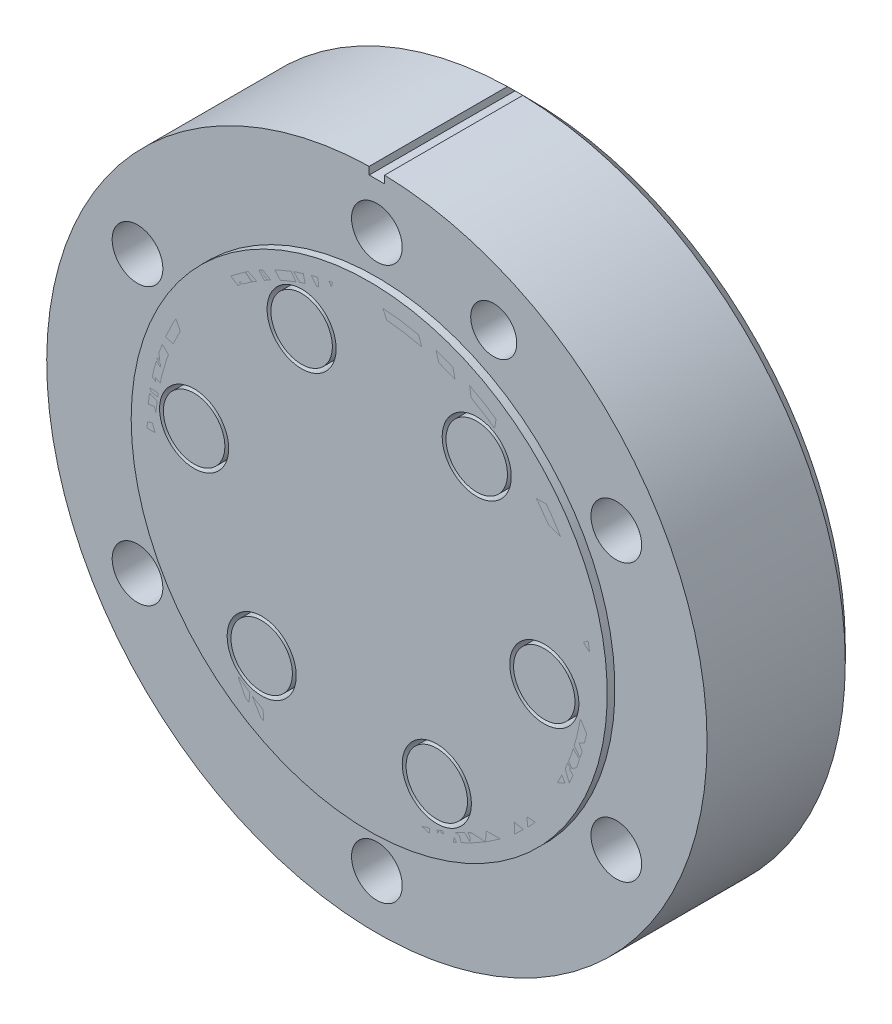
ISO-10303-21;
HEADER;
FILE_DESCRIPTION(('STEP AP214'),'2;1');
FILE_NAME('part.step','',(''),(''),'','','');
FILE_SCHEMA(('AUTOMOTIVE_DESIGN { 1 0 10303 214 1 1 1 1 }'));
ENDSEC;
DATA;
#1=APPLICATION_CONTEXT('core data for automotive mechanical design processes');
#2=APPLICATION_PROTOCOL_DEFINITION('international standard','automotive_design',2000,#1);
#3=PRODUCT_CONTEXT('',#1,'mechanical');
#4=PRODUCT('Part','Part','',(#3));
#5=PRODUCT_RELATED_PRODUCT_CATEGORY('part','',(#4));
#6=PRODUCT_DEFINITION_FORMATION('','',#4);
#7=PRODUCT_DEFINITION_CONTEXT('part definition',#1,'design');
#8=PRODUCT_DEFINITION('design','',#6,#7);
#9=PRODUCT_DEFINITION_SHAPE('','',#8);
#10=(LENGTH_UNIT() NAMED_UNIT(*) SI_UNIT(.MILLI.,.METRE.));
#11=(NAMED_UNIT(*) PLANE_ANGLE_UNIT() SI_UNIT($,.RADIAN.));
#12=(NAMED_UNIT(*) SI_UNIT($,.STERADIAN.) SOLID_ANGLE_UNIT());
#13=UNCERTAINTY_MEASURE_WITH_UNIT(LENGTH_MEASURE(1.E-05),#10,'distance_accuracy_value','');
#14=(GEOMETRIC_REPRESENTATION_CONTEXT(3) GLOBAL_UNCERTAINTY_ASSIGNED_CONTEXT((#13)) GLOBAL_UNIT_ASSIGNED_CONTEXT((#10,
#11,#12)) REPRESENTATION_CONTEXT('',''));
#15=CARTESIAN_POINT('',(0.,0.,0.));
#16=DIRECTION('',(0.,0.,1.));
#17=DIRECTION('',(1.,0.,0.));
#18=AXIS2_PLACEMENT_3D('',#15,#16,#17);
#19=CARTESIAN_POINT('',(-38.834454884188,817.501051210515,-714.198748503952));
#20=DIRECTION('',(0.,0.,-1.));
#21=DIRECTION('',(-0.218511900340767,0.975834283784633,0.));
#22=AXIS2_PLACEMENT_3D('',#19,#20,#21);
#23=CYLINDRICAL_SURFACE('',#22,2.);
#24=CARTESIAN_POINT('',(-38.8344548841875,817.501051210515,-703.798748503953));
#25=DIRECTION('',(0.,0.,-1.));
#26=DIRECTION('',(-1.,0.,0.));
#27=AXIS2_PLACEMENT_3D('',#24,#25,#26);
#28=CIRCLE('',#27,2.);
#29=CARTESIAN_POINT('',(-40.8344548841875,817.501051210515,-703.798748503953));
#30=VERTEX_POINT('',#29);
#31=EDGE_CURVE('P0_E20',#30,#30,#28,.T.);
#32=ORIENTED_EDGE('',*,*,#31,.T.);
#33=EDGE_LOOP('',(#32));
#34=FACE_BOUND('',#33,.T.);
#35=CARTESIAN_POINT('',(-38.8344548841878,817.501051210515,-709.998748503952));
#36=DIRECTION('',(0.,0.,-1.));
#37=DIRECTION('',(-0.218511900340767,0.975834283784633,0.));
#38=AXIS2_PLACEMENT_3D('',#35,#36,#37);
#39=CIRCLE('',#38,2.);
#40=CARTESIAN_POINT('',(-39.2714786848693,819.452719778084,-709.998748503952));
#41=VERTEX_POINT('',#40);
#42=EDGE_CURVE('P0_E119',#41,#41,#39,.T.);
#43=ORIENTED_EDGE('',*,*,#42,.F.);
#44=EDGE_LOOP('',(#43));
#45=FACE_BOUND('',#44,.T.);
#46=ADVANCED_FACE('P0_F16',(#34,#45),#23,.T.);
#47=CARTESIAN_POINT('',(-38.834454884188,817.501051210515,-714.198748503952));
#48=DIRECTION('',(0.,0.,1.));
#49=DIRECTION('',(0.218511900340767,-0.975834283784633,0.));
#50=AXIS2_PLACEMENT_3D('',#47,#48,#49);
#51=PLANE('',#50);
#52=CARTESIAN_POINT('',(-38.834454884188,817.501051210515,-714.198748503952));
#53=DIRECTION('',(0.,0.,1.));
#54=DIRECTION('',(0.218511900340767,-0.975834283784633,0.));
#55=AXIS2_PLACEMENT_3D('',#52,#53,#54);
#56=CIRCLE('',#55,3.4);
#57=CARTESIAN_POINT('',(-38.0915144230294,814.183214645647,-714.198748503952));
#58=VERTEX_POINT('',#57);
#59=EDGE_CURVE('P0_E25',#58,#58,#56,.F.);
#60=ORIENTED_EDGE('',*,*,#59,.T.);
#61=EDGE_LOOP('',(#60));
#62=FACE_BOUND('',#61,.T.);
#63=DIRECTION('',(0.954353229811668,-0.298680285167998,0.));
#64=VECTOR('',#63,1.);
#65=CARTESIAN_POINT('',(-39.2102953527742,819.179486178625,-714.198748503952));
#66=LINE('',#65,#64);
#67=CARTESIAN_POINT('',(-39.2102953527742,819.179486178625,-714.198748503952));
#68=VERTEX_POINT('',#67);
#69=CARTESIAN_POINT('',(-37.5688077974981,818.665756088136,-714.198748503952));
#70=VERTEX_POINT('',#69);
#71=EDGE_CURVE('P0_E106',#68,#70,#66,.T.);
#72=ORIENTED_EDGE('',*,*,#71,.F.);
#73=DIRECTION('',(0.735841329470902,0.677153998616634,0.));
#74=VECTOR('',#73,1.);
#75=CARTESIAN_POINT('',(-40.4759424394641,818.014781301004,-714.198748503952));
#76=LINE('',#75,#74);
#77=CARTESIAN_POINT('',(-40.4759424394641,818.014781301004,-714.198748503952));
#78=VERTEX_POINT('',#77);
#79=EDGE_CURVE('P0_E32',#78,#68,#76,.T.);
#80=ORIENTED_EDGE('',*,*,#79,.F.);
#81=DIRECTION('',(-0.218511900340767,0.975834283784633,0.));
#82=VECTOR('',#81,1.);
#83=CARTESIAN_POINT('',(-40.1001019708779,816.336346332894,-714.198748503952));
#84=LINE('',#83,#82);
#85=CARTESIAN_POINT('',(-40.1001019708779,816.336346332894,-714.198748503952));
#86=VERTEX_POINT('',#85);
#87=EDGE_CURVE('P0_E115',#86,#78,#84,.T.);
#88=ORIENTED_EDGE('',*,*,#87,.F.);
#89=DIRECTION('',(-0.954353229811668,0.298680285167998,0.));
#90=VECTOR('',#89,1.);
#91=CARTESIAN_POINT('',(-38.4586144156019,815.822616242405,-714.198748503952));
#92=LINE('',#91,#90);
#93=CARTESIAN_POINT('',(-38.4586144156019,815.822616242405,-714.198748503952));
#94=VERTEX_POINT('',#93);
#95=EDGE_CURVE('P0_E113',#94,#86,#92,.T.);
#96=ORIENTED_EDGE('',*,*,#95,.F.);
#97=DIRECTION('',(-0.735841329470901,-0.677153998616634,0.));
#98=VECTOR('',#97,1.);
#99=CARTESIAN_POINT('',(-37.1929673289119,816.987321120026,-714.198748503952));
#100=LINE('',#99,#98);
#101=CARTESIAN_POINT('',(-37.1929673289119,816.987321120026,-714.198748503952));
#102=VERTEX_POINT('',#101);
#103=EDGE_CURVE('P0_E80',#102,#94,#100,.T.);
#104=ORIENTED_EDGE('',*,*,#103,.F.);
#105=DIRECTION('',(0.218511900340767,-0.975834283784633,0.));
#106=VECTOR('',#105,1.);
#107=CARTESIAN_POINT('',(-37.5688077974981,818.665756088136,-714.198748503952));
#108=LINE('',#107,#106);
#109=EDGE_CURVE('P0_E109',#70,#102,#108,.T.);
#110=ORIENTED_EDGE('',*,*,#109,.F.);
#111=EDGE_LOOP('',(#72,#80,#88,#96,#104,#110));
#112=FACE_BOUND('',#111,.T.);
#113=ADVANCED_FACE('P0_F137',(#62,#112),#51,.F.);
#114=CARTESIAN_POINT('',(-38.834454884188,817.501051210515,-714.198748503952));
#115=DIRECTION('',(0.,0.,-1.));
#116=DIRECTION('',(-0.218511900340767,0.975834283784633,0.));
#117=AXIS2_PLACEMENT_3D('',#114,#115,#116);
#118=CYLINDRICAL_SURFACE('',#117,3.5);
#119=CARTESIAN_POINT('',(-38.834454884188,817.501051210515,-714.098748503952));
#120=DIRECTION('',(0.,0.,1.));
#121=DIRECTION('',(0.218511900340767,-0.975834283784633,0.));
#122=AXIS2_PLACEMENT_3D('',#119,#120,#121);
#123=CIRCLE('',#122,3.5);
#124=CARTESIAN_POINT('',(-38.0696632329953,814.085631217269,-714.098748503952));
#125=VERTEX_POINT('',#124);
#126=EDGE_CURVE('P0_E11',#125,#125,#123,.T.);
#127=ORIENTED_EDGE('',*,*,#126,.T.);
#128=EDGE_LOOP('',(#127));
#129=FACE_BOUND('',#128,.T.);
#130=CARTESIAN_POINT('',(-38.8344548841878,817.501051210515,-710.198748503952));
#131=DIRECTION('',(0.,0.,-1.));
#132=DIRECTION('',(-0.218511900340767,0.975834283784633,0.));
#133=AXIS2_PLACEMENT_3D('',#130,#131,#132);
#134=CIRCLE('',#133,3.5);
#135=CARTESIAN_POINT('',(-39.5992465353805,820.916471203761,-710.198748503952));
#136=VERTEX_POINT('',#135);
#137=EDGE_CURVE('P0_E130',#136,#136,#134,.T.);
#138=ORIENTED_EDGE('',*,*,#137,.T.);
#139=EDGE_LOOP('',(#138));
#140=FACE_BOUND('',#139,.T.);
#141=ADVANCED_FACE('P0_F162',(#129,#140),#118,.T.);
#142=CARTESIAN_POINT('',(-35.4190348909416,818.265842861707,-710.198748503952));
#143=DIRECTION('',(0.,0.,-1.));
#144=DIRECTION('',(-0.218511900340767,0.975834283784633,0.));
#145=AXIS2_PLACEMENT_3D('',#142,#143,#144);
#146=PLANE('',#145);
#147=ORIENTED_EDGE('',*,*,#137,.F.);
#148=EDGE_LOOP('',(#147));
#149=FACE_BOUND('',#148,.T.);
#150=CARTESIAN_POINT('',(-38.8344548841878,817.501051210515,-710.198748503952));
#151=DIRECTION('',(0.,0.,-1.));
#152=DIRECTION('',(-0.218511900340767,0.975834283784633,0.));
#153=AXIS2_PLACEMENT_3D('',#150,#151,#152);
#154=CIRCLE('',#153,2.2);
#155=CARTESIAN_POINT('',(-39.3151810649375,819.647886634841,-710.198748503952));
#156=VERTEX_POINT('',#155);
#157=EDGE_CURVE('P0_E127',#156,#156,#154,.T.);
#158=ORIENTED_EDGE('',*,*,#157,.T.);
#159=EDGE_LOOP('',(#158));
#160=FACE_BOUND('',#159,.T.);
#161=ADVANCED_FACE('P0_F172',(#149,#160),#146,.F.);
#162=CARTESIAN_POINT('',(-38.8344548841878,817.501051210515,-709.998748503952));
#163=DIRECTION('',(0.,0.,-1.));
#164=DIRECTION('',(-0.218511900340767,0.975834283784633,0.));
#165=AXIS2_PLACEMENT_3D('',#162,#163,#164);
#166=TOROIDAL_SURFACE('',#165,2.2,0.2);
#167=ORIENTED_EDGE('',*,*,#157,.F.);
#168=EDGE_LOOP('',(#167));
#169=FACE_BOUND('',#168,.T.);
#170=ORIENTED_EDGE('',*,*,#42,.T.);
#171=EDGE_LOOP('',(#170));
#172=FACE_BOUND('',#171,.T.);
#173=ADVANCED_FACE('P0_F169',(#169,#172),#166,.F.);
#174=CARTESIAN_POINT('',(-40.475942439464,818.014781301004,-712.198748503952));
#175=DIRECTION('',(-0.677153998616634,0.735841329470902,0.));
#176=DIRECTION('',(-0.735841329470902,-0.677153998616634,0.));
#177=AXIS2_PLACEMENT_3D('',#174,#175,#176);
#178=PLANE('',#177);
#179=ORIENTED_EDGE('',*,*,#79,.T.);
#180=DIRECTION('',(0.,0.,-1.));
#181=VECTOR('',#180,1.);
#182=CARTESIAN_POINT('',(-39.2102953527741,819.179486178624,-712.198748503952));
#183=LINE('',#182,#181);
#184=CARTESIAN_POINT('',(-39.2102953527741,819.179486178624,-712.198748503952));
#185=VERTEX_POINT('',#184);
#186=EDGE_CURVE('P0_E62',#185,#68,#183,.T.);
#187=ORIENTED_EDGE('',*,*,#186,.F.);
#188=DIRECTION('',(0.735841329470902,0.677153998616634,0.));
#189=VECTOR('',#188,1.);
#190=CARTESIAN_POINT('',(-40.475942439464,818.014781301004,-712.198748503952));
#191=LINE('',#190,#189);
#192=CARTESIAN_POINT('',(-40.475942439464,818.014781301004,-712.198748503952));
#193=VERTEX_POINT('',#192);
#194=EDGE_CURVE('P0_E117',#193,#185,#191,.T.);
#195=ORIENTED_EDGE('',*,*,#194,.F.);
#196=DIRECTION('',(0.,0.,-1.));
#197=VECTOR('',#196,1.);
#198=CARTESIAN_POINT('',(-40.475942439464,818.014781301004,-712.198748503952));
#199=LINE('',#198,#197);
#200=EDGE_CURVE('P0_E40',#193,#78,#199,.T.);
#201=ORIENTED_EDGE('',*,*,#200,.T.);
#202=EDGE_LOOP('',(#179,#187,#195,#201));
#203=FACE_BOUND('',#202,.T.);
#204=ADVANCED_FACE('P0_F167',(#203),#178,.F.);
#205=CARTESIAN_POINT('',(-40.1001019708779,816.336346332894,-712.198748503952));
#206=DIRECTION('',(-0.975834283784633,-0.218511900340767,0.));
#207=DIRECTION('',(0.218511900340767,-0.975834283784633,0.));
#208=AXIS2_PLACEMENT_3D('',#205,#206,#207);
#209=PLANE('',#208);
#210=ORIENTED_EDGE('',*,*,#87,.T.);
#211=ORIENTED_EDGE('',*,*,#200,.F.);
#212=DIRECTION('',(-0.218511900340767,0.975834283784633,0.));
#213=VECTOR('',#212,1.);
#214=CARTESIAN_POINT('',(-40.1001019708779,816.336346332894,-712.198748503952));
#215=LINE('',#214,#213);
#216=CARTESIAN_POINT('',(-40.1001019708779,816.336346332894,-712.198748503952));
#217=VERTEX_POINT('',#216);
#218=EDGE_CURVE('P0_E92',#217,#193,#215,.T.);
#219=ORIENTED_EDGE('',*,*,#218,.F.);
#220=DIRECTION('',(0.,0.,-1.));
#221=VECTOR('',#220,1.);
#222=CARTESIAN_POINT('',(-40.1001019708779,816.336346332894,-712.198748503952));
#223=LINE('',#222,#221);
#224=EDGE_CURVE('P0_E84',#217,#86,#223,.T.);
#225=ORIENTED_EDGE('',*,*,#224,.T.);
#226=EDGE_LOOP('',(#210,#211,#219,#225));
#227=FACE_BOUND('',#226,.T.);
#228=ADVANCED_FACE('P0_F211',(#227),#209,.F.);
#229=CARTESIAN_POINT('',(-38.4586144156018,815.822616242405,-712.198748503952));
#230=DIRECTION('',(-0.298680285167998,-0.954353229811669,0.));
#231=DIRECTION('',(0.954353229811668,-0.298680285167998,0.));
#232=AXIS2_PLACEMENT_3D('',#229,#230,#231);
#233=PLANE('',#232);
#234=ORIENTED_EDGE('',*,*,#95,.T.);
#235=ORIENTED_EDGE('',*,*,#224,.F.);
#236=DIRECTION('',(-0.954353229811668,0.298680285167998,0.));
#237=VECTOR('',#236,1.);
#238=CARTESIAN_POINT('',(-38.4586144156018,815.822616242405,-712.198748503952));
#239=LINE('',#238,#237);
#240=CARTESIAN_POINT('',(-38.4586144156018,815.822616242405,-712.198748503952));
#241=VERTEX_POINT('',#240);
#242=EDGE_CURVE('P0_E88',#241,#217,#239,.T.);
#243=ORIENTED_EDGE('',*,*,#242,.F.);
#244=DIRECTION('',(0.,0.,-1.));
#245=VECTOR('',#244,1.);
#246=CARTESIAN_POINT('',(-38.4586144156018,815.822616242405,-712.198748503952));
#247=LINE('',#246,#245);
#248=EDGE_CURVE('P0_E73',#241,#94,#247,.T.);
#249=ORIENTED_EDGE('',*,*,#248,.T.);
#250=EDGE_LOOP('',(#234,#235,#243,#249));
#251=FACE_BOUND('',#250,.T.);
#252=ADVANCED_FACE('P0_F89',(#251),#233,.F.);
#253=CARTESIAN_POINT('',(-37.1929673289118,816.987321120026,-712.198748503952));
#254=DIRECTION('',(0.677153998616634,-0.735841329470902,0.));
#255=DIRECTION('',(0.735841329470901,0.677153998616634,0.));
#256=AXIS2_PLACEMENT_3D('',#253,#254,#255);
#257=PLANE('',#256);
#258=ORIENTED_EDGE('',*,*,#103,.T.);
#259=ORIENTED_EDGE('',*,*,#248,.F.);
#260=DIRECTION('',(-0.735841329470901,-0.677153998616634,0.));
#261=VECTOR('',#260,1.);
#262=CARTESIAN_POINT('',(-37.1929673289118,816.987321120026,-712.198748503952));
#263=LINE('',#262,#261);
#264=CARTESIAN_POINT('',(-37.1929673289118,816.987321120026,-712.198748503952));
#265=VERTEX_POINT('',#264);
#266=EDGE_CURVE('P0_E77',#265,#241,#263,.T.);
#267=ORIENTED_EDGE('',*,*,#266,.F.);
#268=DIRECTION('',(0.,0.,-1.));
#269=VECTOR('',#268,1.);
#270=CARTESIAN_POINT('',(-37.1929673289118,816.987321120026,-712.198748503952));
#271=LINE('',#270,#269);
#272=EDGE_CURVE('P0_E85',#265,#102,#271,.T.);
#273=ORIENTED_EDGE('',*,*,#272,.T.);
#274=EDGE_LOOP('',(#258,#259,#267,#273));
#275=FACE_BOUND('',#274,.T.);
#276=ADVANCED_FACE('P0_F75',(#275),#257,.F.);
#277=CARTESIAN_POINT('',(-37.5688077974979,818.665756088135,-712.198748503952));
#278=DIRECTION('',(0.975834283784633,0.218511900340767,0.));
#279=DIRECTION('',(-0.218511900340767,0.975834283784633,0.));
#280=AXIS2_PLACEMENT_3D('',#277,#278,#279);
#281=PLANE('',#280);
#282=ORIENTED_EDGE('',*,*,#109,.T.);
#283=ORIENTED_EDGE('',*,*,#272,.F.);
#284=DIRECTION('',(0.218511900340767,-0.975834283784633,0.));
#285=VECTOR('',#284,1.);
#286=CARTESIAN_POINT('',(-37.5688077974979,818.665756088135,-712.198748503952));
#287=LINE('',#286,#285);
#288=CARTESIAN_POINT('',(-37.5688077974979,818.665756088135,-712.198748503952));
#289=VERTEX_POINT('',#288);
#290=EDGE_CURVE('P0_E98',#289,#265,#287,.T.);
#291=ORIENTED_EDGE('',*,*,#290,.F.);
#292=DIRECTION('',(0.,0.,-1.));
#293=VECTOR('',#292,1.);
#294=CARTESIAN_POINT('',(-37.5688077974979,818.665756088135,-712.198748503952));
#295=LINE('',#294,#293);
#296=EDGE_CURVE('P0_E122',#289,#70,#295,.T.);
#297=ORIENTED_EDGE('',*,*,#296,.T.);
#298=EDGE_LOOP('',(#282,#283,#291,#297));
#299=FACE_BOUND('',#298,.T.);
#300=ADVANCED_FACE('P0_F232',(#299),#281,.F.);
#301=CARTESIAN_POINT('',(-39.2102953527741,819.179486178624,-712.198748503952));
#302=DIRECTION('',(0.298680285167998,0.954353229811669,0.));
#303=DIRECTION('',(-0.954353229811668,0.298680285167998,0.));
#304=AXIS2_PLACEMENT_3D('',#301,#302,#303);
#305=PLANE('',#304);
#306=ORIENTED_EDGE('',*,*,#71,.T.);
#307=ORIENTED_EDGE('',*,*,#296,.F.);
#308=DIRECTION('',(0.954353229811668,-0.298680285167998,0.));
#309=VECTOR('',#308,1.);
#310=CARTESIAN_POINT('',(-39.2102953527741,819.179486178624,-712.198748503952));
#311=LINE('',#310,#309);
#312=EDGE_CURVE('P0_E100',#185,#289,#311,.T.);
#313=ORIENTED_EDGE('',*,*,#312,.F.);
#314=ORIENTED_EDGE('',*,*,#186,.T.);
#315=EDGE_LOOP('',(#306,#307,#313,#314));
#316=FACE_BOUND('',#315,.T.);
#317=ADVANCED_FACE('P0_F151',(#316),#305,.F.);
#318=CARTESIAN_POINT('',(-37.9446482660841,820.344191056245,-712.198748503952));
#319=DIRECTION('',(0.,0.,-1.));
#320=DIRECTION('',(-0.218511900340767,0.975834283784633,0.));
#321=AXIS2_PLACEMENT_3D('',#318,#319,#320);
#322=PLANE('',#321);
#323=ORIENTED_EDGE('',*,*,#194,.T.);
#324=ORIENTED_EDGE('',*,*,#312,.T.);
#325=ORIENTED_EDGE('',*,*,#290,.T.);
#326=ORIENTED_EDGE('',*,*,#266,.T.);
#327=ORIENTED_EDGE('',*,*,#242,.T.);
#328=ORIENTED_EDGE('',*,*,#218,.T.);
#329=EDGE_LOOP('',(#323,#324,#325,#326,#327,#328));
#330=FACE_BOUND('',#329,.T.);
#331=ADVANCED_FACE('P0_F95',(#330),#322,.T.);
#332=CARTESIAN_POINT('',(-38.834454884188,817.501051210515,-714.098748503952));
#333=DIRECTION('',(0.,0.,1.));
#334=DIRECTION('',(0.218511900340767,-0.975834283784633,0.));
#335=AXIS2_PLACEMENT_3D('',#332,#333,#334);
#336=TOROIDAL_SURFACE('',#335,3.4,0.1);
#337=ORIENTED_EDGE('',*,*,#126,.F.);
#338=EDGE_LOOP('',(#337));
#339=FACE_BOUND('',#338,.T.);
#340=ORIENTED_EDGE('',*,*,#59,.F.);
#341=EDGE_LOOP('',(#340));
#342=FACE_BOUND('',#341,.T.);
#343=ADVANCED_FACE('P0_F18',(#339,#342),#336,.T.);
#344=CARTESIAN_POINT('',(-150.,738.995733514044,-703.798748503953));
#345=DIRECTION('',(0.,0.,-1.));
#346=DIRECTION('',(-1.,0.,0.));
#347=AXIS2_PLACEMENT_3D('',#344,#345,#346);
#348=PLANE('',#347);
#349=ORIENTED_EDGE('',*,*,#31,.F.);
#350=EDGE_LOOP('',(#349));
#351=FACE_BOUND('',#350,.T.);
#352=ADVANCED_FACE('P0_F141',(#351),#348,.F.);
#353=CLOSED_SHELL('',(#46,#113,#141,#161,#173,#204,#228,#252,#276,#300,#317,#331,#343,#352));
#354=MANIFOLD_SOLID_BREP('P0_B1',#353);
#355=CARTESIAN_POINT('',(-16.0312230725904,814.498948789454,-714.198748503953));
#356=DIRECTION('',(0.,0.,-1.));
#357=DIRECTION('',(-0.807085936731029,-0.590433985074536,0.));
#358=AXIS2_PLACEMENT_3D('',#355,#356,#357);
#359=CYLINDRICAL_SURFACE('',#358,2.);
#360=CARTESIAN_POINT('',(-16.0312230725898,814.498948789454,-703.798748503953));
#361=DIRECTION('',(0.,0.,-1.));
#362=DIRECTION('',(-1.,0.,0.));
#363=AXIS2_PLACEMENT_3D('',#360,#361,#362);
#364=CIRCLE('',#363,2.);
#365=CARTESIAN_POINT('',(-18.0312230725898,814.498948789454,-703.798748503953));
#366=VERTEX_POINT('',#365);
#367=EDGE_CURVE('P1_E20',#366,#366,#364,.T.);
#368=ORIENTED_EDGE('',*,*,#367,.T.);
#369=EDGE_LOOP('',(#368));
#370=FACE_BOUND('',#369,.T.);
#371=CARTESIAN_POINT('',(-16.0312230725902,814.498948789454,-709.998748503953));
#372=DIRECTION('',(0.,0.,-1.));
#373=DIRECTION('',(-0.807085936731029,-0.590433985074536,0.));
#374=AXIS2_PLACEMENT_3D('',#371,#372,#373);
#375=CIRCLE('',#374,2.);
#376=CARTESIAN_POINT('',(-17.6453949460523,813.318080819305,-709.998748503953));
#377=VERTEX_POINT('',#376);
#378=EDGE_CURVE('P1_E119',#377,#377,#375,.T.);
#379=ORIENTED_EDGE('',*,*,#378,.F.);
#380=EDGE_LOOP('',(#379));
#381=FACE_BOUND('',#380,.T.);
#382=ADVANCED_FACE('P1_F16',(#370,#381),#359,.T.);
#383=CARTESIAN_POINT('',(-16.0312230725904,814.498948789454,-714.198748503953));
#384=DIRECTION('',(0.,0.,1.));
#385=DIRECTION('',(0.807085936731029,0.590433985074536,0.));
#386=AXIS2_PLACEMENT_3D('',#383,#384,#385);
#387=PLANE('',#386);
#388=CARTESIAN_POINT('',(-16.0312230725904,814.498948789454,-714.198748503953));
#389=DIRECTION('',(0.,0.,1.));
#390=DIRECTION('',(0.807085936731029,0.590433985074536,0.));
#391=AXIS2_PLACEMENT_3D('',#388,#389,#390);
#392=CIRCLE('',#391,3.4);
#393=CARTESIAN_POINT('',(-13.2871308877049,816.506424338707,-714.198748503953));
#394=VERTEX_POINT('',#393);
#395=EDGE_CURVE('P1_E25',#394,#394,#392,.F.);
#396=ORIENTED_EDGE('',*,*,#395,.T.);
#397=EDGE_LOOP('',(#396));
#398=FACE_BOUND('',#397,.T.);
#399=DIRECTION('',(-0.107787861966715,0.994173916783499,0.));
#400=VECTOR('',#399,1.);
#401=CARTESIAN_POINT('',(-17.4194108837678,813.483402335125,-714.198748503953));
#402=LINE('',#401,#400);
#403=CARTESIAN_POINT('',(-17.4194108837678,813.483402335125,-714.198748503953));
#404=VERTEX_POINT('',#403);
#405=CARTESIAN_POINT('',(-17.6048060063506,815.193381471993,-714.198748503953));
#406=VERTEX_POINT('',#405);
#407=EDGE_CURVE('P1_E106',#404,#406,#402,.T.);
#408=ORIENTED_EDGE('',*,*,#407,.F.);
#409=DIRECTION('',(-0.914873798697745,0.403739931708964,0.));
#410=VECTOR('',#409,1.);
#411=CARTESIAN_POINT('',(-15.8458279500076,812.788969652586,-714.198748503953));
#412=LINE('',#411,#410);
#413=CARTESIAN_POINT('',(-15.8458279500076,812.788969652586,-714.198748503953));
#414=VERTEX_POINT('',#413);
#415=EDGE_CURVE('P1_E32',#414,#404,#412,.T.);
#416=ORIENTED_EDGE('',*,*,#415,.F.);
#417=DIRECTION('',(-0.807085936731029,-0.590433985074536,0.));
#418=VECTOR('',#417,1.);
#419=CARTESIAN_POINT('',(-14.4576401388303,813.804516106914,-714.198748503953));
#420=LINE('',#419,#418);
#421=CARTESIAN_POINT('',(-14.4576401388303,813.804516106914,-714.198748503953));
#422=VERTEX_POINT('',#421);
#423=EDGE_CURVE('P1_E115',#422,#414,#420,.T.);
#424=ORIENTED_EDGE('',*,*,#423,.F.);
#425=DIRECTION('',(0.107787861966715,-0.994173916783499,0.));
#426=VECTOR('',#425,1.);
#427=CARTESIAN_POINT('',(-14.643035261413,815.514495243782,-714.198748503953));
#428=LINE('',#427,#426);
#429=CARTESIAN_POINT('',(-14.643035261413,815.514495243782,-714.198748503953));
#430=VERTEX_POINT('',#429);
#431=EDGE_CURVE('P1_E113',#430,#422,#428,.T.);
#432=ORIENTED_EDGE('',*,*,#431,.F.);
#433=DIRECTION('',(0.914873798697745,-0.403739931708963,0.));
#434=VECTOR('',#433,1.);
#435=CARTESIAN_POINT('',(-16.2166181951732,816.208927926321,-714.198748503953));
#436=LINE('',#435,#434);
#437=CARTESIAN_POINT('',(-16.2166181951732,816.208927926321,-714.198748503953));
#438=VERTEX_POINT('',#437);
#439=EDGE_CURVE('P1_E80',#438,#430,#436,.T.);
#440=ORIENTED_EDGE('',*,*,#439,.F.);
#441=DIRECTION('',(0.807085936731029,0.590433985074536,0.));
#442=VECTOR('',#441,1.);
#443=CARTESIAN_POINT('',(-17.6048060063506,815.193381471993,-714.198748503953));
#444=LINE('',#443,#442);
#445=EDGE_CURVE('P1_E109',#406,#438,#444,.T.);
#446=ORIENTED_EDGE('',*,*,#445,.F.);
#447=EDGE_LOOP('',(#408,#416,#424,#432,#440,#446));
#448=FACE_BOUND('',#447,.T.);
#449=ADVANCED_FACE('P1_F137',(#398,#448),#387,.F.);
#450=CARTESIAN_POINT('',(-16.0312230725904,814.498948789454,-714.198748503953));
#451=DIRECTION('',(0.,0.,-1.));
#452=DIRECTION('',(-0.807085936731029,-0.590433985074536,0.));
#453=AXIS2_PLACEMENT_3D('',#450,#451,#452);
#454=CYLINDRICAL_SURFACE('',#453,3.5);
#455=CARTESIAN_POINT('',(-16.0312230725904,814.498948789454,-714.098748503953));
#456=DIRECTION('',(0.,0.,1.));
#457=DIRECTION('',(0.807085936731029,0.590433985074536,0.));
#458=AXIS2_PLACEMENT_3D('',#455,#456,#457);
#459=CIRCLE('',#458,3.5);
#460=CARTESIAN_POINT('',(-13.2064222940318,816.565467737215,-714.098748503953));
#461=VERTEX_POINT('',#460);
#462=EDGE_CURVE('P1_E11',#461,#461,#459,.T.);
#463=ORIENTED_EDGE('',*,*,#462,.T.);
#464=EDGE_LOOP('',(#463));
#465=FACE_BOUND('',#464,.T.);
#466=CARTESIAN_POINT('',(-16.0312230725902,814.498948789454,-710.198748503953));
#467=DIRECTION('',(0.,0.,-1.));
#468=DIRECTION('',(-0.807085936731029,-0.590433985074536,0.));
#469=AXIS2_PLACEMENT_3D('',#466,#467,#468);
#470=CIRCLE('',#469,3.5);
#471=CARTESIAN_POINT('',(-18.8560238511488,812.432429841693,-710.198748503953));
#472=VERTEX_POINT('',#471);
#473=EDGE_CURVE('P1_E130',#472,#472,#470,.T.);
#474=ORIENTED_EDGE('',*,*,#473,.T.);
#475=EDGE_LOOP('',(#474));
#476=FACE_BOUND('',#475,.T.);
#477=ADVANCED_FACE('P1_F162',(#465,#476),#454,.T.);
#478=CARTESIAN_POINT('',(-18.0977420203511,817.323749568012,-710.198748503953));
#479=DIRECTION('',(0.,0.,-1.));
#480=DIRECTION('',(-0.807085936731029,-0.590433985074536,0.));
#481=AXIS2_PLACEMENT_3D('',#478,#479,#480);
#482=PLANE('',#481);
#483=ORIENTED_EDGE('',*,*,#473,.F.);
#484=EDGE_LOOP('',(#483));
#485=FACE_BOUND('',#484,.T.);
#486=CARTESIAN_POINT('',(-16.0312230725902,814.498948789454,-710.198748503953));
#487=DIRECTION('',(0.,0.,-1.));
#488=DIRECTION('',(-0.807085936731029,-0.590433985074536,0.));
#489=AXIS2_PLACEMENT_3D('',#486,#487,#488);
#490=CIRCLE('',#489,2.2);
#491=CARTESIAN_POINT('',(-17.8068121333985,813.19999402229,-710.198748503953));
#492=VERTEX_POINT('',#491);
#493=EDGE_CURVE('P1_E127',#492,#492,#490,.T.);
#494=ORIENTED_EDGE('',*,*,#493,.T.);
#495=EDGE_LOOP('',(#494));
#496=FACE_BOUND('',#495,.T.);
#497=ADVANCED_FACE('P1_F172',(#485,#496),#482,.F.);
#498=CARTESIAN_POINT('',(-16.0312230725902,814.498948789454,-709.998748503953));
#499=DIRECTION('',(0.,0.,-1.));
#500=DIRECTION('',(-0.807085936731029,-0.590433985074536,0.));
#501=AXIS2_PLACEMENT_3D('',#498,#499,#500);
#502=TOROIDAL_SURFACE('',#501,2.2,0.2);
#503=ORIENTED_EDGE('',*,*,#493,.F.);
#504=EDGE_LOOP('',(#503));
#505=FACE_BOUND('',#504,.T.);
#506=ORIENTED_EDGE('',*,*,#378,.T.);
#507=EDGE_LOOP('',(#506));
#508=FACE_BOUND('',#507,.T.);
#509=ADVANCED_FACE('P1_F169',(#505,#508),#502,.F.);
#510=CARTESIAN_POINT('',(-15.8458279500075,812.788969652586,-712.198748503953));
#511=DIRECTION('',(-0.403739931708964,-0.914873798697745,0.));
#512=DIRECTION('',(0.914873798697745,-0.403739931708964,0.));
#513=AXIS2_PLACEMENT_3D('',#510,#511,#512);
#514=PLANE('',#513);
#515=ORIENTED_EDGE('',*,*,#415,.T.);
#516=DIRECTION('',(0.,0.,-1.));
#517=VECTOR('',#516,1.);
#518=CARTESIAN_POINT('',(-17.4194108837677,813.483402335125,-712.198748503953));
#519=LINE('',#518,#517);
#520=CARTESIAN_POINT('',(-17.4194108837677,813.483402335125,-712.198748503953));
#521=VERTEX_POINT('',#520);
#522=EDGE_CURVE('P1_E62',#521,#404,#519,.T.);
#523=ORIENTED_EDGE('',*,*,#522,.F.);
#524=DIRECTION('',(-0.914873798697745,0.403739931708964,0.));
#525=VECTOR('',#524,1.);
#526=CARTESIAN_POINT('',(-15.8458279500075,812.788969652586,-712.198748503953));
#527=LINE('',#526,#525);
#528=CARTESIAN_POINT('',(-15.8458279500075,812.788969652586,-712.198748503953));
#529=VERTEX_POINT('',#528);
#530=EDGE_CURVE('P1_E117',#529,#521,#527,.T.);
#531=ORIENTED_EDGE('',*,*,#530,.F.);
#532=DIRECTION('',(0.,0.,-1.));
#533=VECTOR('',#532,1.);
#534=CARTESIAN_POINT('',(-15.8458279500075,812.788969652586,-712.198748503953));
#535=LINE('',#534,#533);
#536=EDGE_CURVE('P1_E40',#529,#414,#535,.T.);
#537=ORIENTED_EDGE('',*,*,#536,.T.);
#538=EDGE_LOOP('',(#515,#523,#531,#537));
#539=FACE_BOUND('',#538,.T.);
#540=ADVANCED_FACE('P1_F167',(#539),#514,.F.);
#541=CARTESIAN_POINT('',(-14.4576401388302,813.804516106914,-712.198748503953));
#542=DIRECTION('',(0.590433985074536,-0.807085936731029,0.));
#543=DIRECTION('',(0.807085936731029,0.590433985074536,0.));
#544=AXIS2_PLACEMENT_3D('',#541,#542,#543);
#545=PLANE('',#544);
#546=ORIENTED_EDGE('',*,*,#423,.T.);
#547=ORIENTED_EDGE('',*,*,#536,.F.);
#548=DIRECTION('',(-0.807085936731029,-0.590433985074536,0.));
#549=VECTOR('',#548,1.);
#550=CARTESIAN_POINT('',(-14.4576401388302,813.804516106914,-712.198748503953));
#551=LINE('',#550,#549);
#552=CARTESIAN_POINT('',(-14.4576401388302,813.804516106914,-712.198748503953));
#553=VERTEX_POINT('',#552);
#554=EDGE_CURVE('P1_E92',#553,#529,#551,.T.);
#555=ORIENTED_EDGE('',*,*,#554,.F.);
#556=DIRECTION('',(0.,0.,-1.));
#557=VECTOR('',#556,1.);
#558=CARTESIAN_POINT('',(-14.4576401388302,813.804516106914,-712.198748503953));
#559=LINE('',#558,#557);
#560=EDGE_CURVE('P1_E84',#553,#422,#559,.T.);
#561=ORIENTED_EDGE('',*,*,#560,.T.);
#562=EDGE_LOOP('',(#546,#547,#555,#561));
#563=FACE_BOUND('',#562,.T.);
#564=ADVANCED_FACE('P1_F211',(#563),#545,.F.);
#565=CARTESIAN_POINT('',(-14.6430352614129,815.514495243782,-712.198748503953));
#566=DIRECTION('',(0.9941739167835,0.107787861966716,0.));
#567=DIRECTION('',(-0.107787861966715,0.994173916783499,0.));
#568=AXIS2_PLACEMENT_3D('',#565,#566,#567);
#569=PLANE('',#568);
#570=ORIENTED_EDGE('',*,*,#431,.T.);
#571=ORIENTED_EDGE('',*,*,#560,.F.);
#572=DIRECTION('',(0.107787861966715,-0.994173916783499,0.));
#573=VECTOR('',#572,1.);
#574=CARTESIAN_POINT('',(-14.6430352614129,815.514495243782,-712.198748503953));
#575=LINE('',#574,#573);
#576=CARTESIAN_POINT('',(-14.6430352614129,815.514495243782,-712.198748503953));
#577=VERTEX_POINT('',#576);
#578=EDGE_CURVE('P1_E88',#577,#553,#575,.T.);
#579=ORIENTED_EDGE('',*,*,#578,.F.);
#580=DIRECTION('',(0.,0.,-1.));
#581=VECTOR('',#580,1.);
#582=CARTESIAN_POINT('',(-14.6430352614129,815.514495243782,-712.198748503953));
#583=LINE('',#582,#581);
#584=EDGE_CURVE('P1_E73',#577,#430,#583,.T.);
#585=ORIENTED_EDGE('',*,*,#584,.T.);
#586=EDGE_LOOP('',(#570,#571,#579,#585));
#587=FACE_BOUND('',#586,.T.);
#588=ADVANCED_FACE('P1_F89',(#587),#569,.F.);
#589=CARTESIAN_POINT('',(-16.2166181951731,816.208927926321,-712.198748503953));
#590=DIRECTION('',(0.403739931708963,0.914873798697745,0.));
#591=DIRECTION('',(-0.914873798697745,0.403739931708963,0.));
#592=AXIS2_PLACEMENT_3D('',#589,#590,#591);
#593=PLANE('',#592);
#594=ORIENTED_EDGE('',*,*,#439,.T.);
#595=ORIENTED_EDGE('',*,*,#584,.F.);
#596=DIRECTION('',(0.914873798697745,-0.403739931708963,0.));
#597=VECTOR('',#596,1.);
#598=CARTESIAN_POINT('',(-16.2166181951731,816.208927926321,-712.198748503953));
#599=LINE('',#598,#597);
#600=CARTESIAN_POINT('',(-16.2166181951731,816.208927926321,-712.198748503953));
#601=VERTEX_POINT('',#600);
#602=EDGE_CURVE('P1_E77',#601,#577,#599,.T.);
#603=ORIENTED_EDGE('',*,*,#602,.F.);
#604=DIRECTION('',(0.,0.,-1.));
#605=VECTOR('',#604,1.);
#606=CARTESIAN_POINT('',(-16.2166181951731,816.208927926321,-712.198748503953));
#607=LINE('',#606,#605);
#608=EDGE_CURVE('P1_E85',#601,#438,#607,.T.);
#609=ORIENTED_EDGE('',*,*,#608,.T.);
#610=EDGE_LOOP('',(#594,#595,#603,#609));
#611=FACE_BOUND('',#610,.T.);
#612=ADVANCED_FACE('P1_F75',(#611),#593,.F.);
#613=CARTESIAN_POINT('',(-17.6048060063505,815.193381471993,-712.198748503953));
#614=DIRECTION('',(-0.590433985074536,0.807085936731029,0.));
#615=DIRECTION('',(-0.807085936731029,-0.590433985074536,0.));
#616=AXIS2_PLACEMENT_3D('',#613,#614,#615);
#617=PLANE('',#616);
#618=ORIENTED_EDGE('',*,*,#445,.T.);
#619=ORIENTED_EDGE('',*,*,#608,.F.);
#620=DIRECTION('',(0.807085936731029,0.590433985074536,0.));
#621=VECTOR('',#620,1.);
#622=CARTESIAN_POINT('',(-17.6048060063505,815.193381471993,-712.198748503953));
#623=LINE('',#622,#621);
#624=CARTESIAN_POINT('',(-17.6048060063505,815.193381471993,-712.198748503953));
#625=VERTEX_POINT('',#624);
#626=EDGE_CURVE('P1_E98',#625,#601,#623,.T.);
#627=ORIENTED_EDGE('',*,*,#626,.F.);
#628=DIRECTION('',(0.,0.,-1.));
#629=VECTOR('',#628,1.);
#630=CARTESIAN_POINT('',(-17.6048060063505,815.193381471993,-712.198748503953));
#631=LINE('',#630,#629);
#632=EDGE_CURVE('P1_E122',#625,#406,#631,.T.);
#633=ORIENTED_EDGE('',*,*,#632,.T.);
#634=EDGE_LOOP('',(#618,#619,#627,#633));
#635=FACE_BOUND('',#634,.T.);
#636=ADVANCED_FACE('P1_F232',(#635),#617,.F.);
#637=CARTESIAN_POINT('',(-17.4194108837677,813.483402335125,-712.198748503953));
#638=DIRECTION('',(-0.9941739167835,-0.107787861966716,0.));
#639=DIRECTION('',(0.107787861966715,-0.994173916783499,0.));
#640=AXIS2_PLACEMENT_3D('',#637,#638,#639);
#641=PLANE('',#640);
#642=ORIENTED_EDGE('',*,*,#407,.T.);
#643=ORIENTED_EDGE('',*,*,#632,.F.);
#644=DIRECTION('',(-0.107787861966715,0.994173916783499,0.));
#645=VECTOR('',#644,1.);
#646=CARTESIAN_POINT('',(-17.4194108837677,813.483402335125,-712.198748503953));
#647=LINE('',#646,#645);
#648=EDGE_CURVE('P1_E100',#521,#625,#647,.T.);
#649=ORIENTED_EDGE('',*,*,#648,.F.);
#650=ORIENTED_EDGE('',*,*,#522,.T.);
#651=EDGE_LOOP('',(#642,#643,#649,#650));
#652=FACE_BOUND('',#651,.T.);
#653=ADVANCED_FACE('P1_F151',(#652),#641,.F.);
#654=CARTESIAN_POINT('',(-18.9929938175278,814.177835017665,-712.198748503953));
#655=DIRECTION('',(0.,0.,-1.));
#656=DIRECTION('',(-0.807085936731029,-0.590433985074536,0.));
#657=AXIS2_PLACEMENT_3D('',#654,#655,#656);
#658=PLANE('',#657);
#659=ORIENTED_EDGE('',*,*,#530,.T.);
#660=ORIENTED_EDGE('',*,*,#648,.T.);
#661=ORIENTED_EDGE('',*,*,#626,.T.);
#662=ORIENTED_EDGE('',*,*,#602,.T.);
#663=ORIENTED_EDGE('',*,*,#578,.T.);
#664=ORIENTED_EDGE('',*,*,#554,.T.);
#665=EDGE_LOOP('',(#659,#660,#661,#662,#663,#664));
#666=FACE_BOUND('',#665,.T.);
#667=ADVANCED_FACE('P1_F95',(#666),#658,.T.);
#668=CARTESIAN_POINT('',(-16.0312230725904,814.498948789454,-714.098748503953));
#669=DIRECTION('',(0.,0.,1.));
#670=DIRECTION('',(0.807085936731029,0.590433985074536,0.));
#671=AXIS2_PLACEMENT_3D('',#668,#669,#670);
#672=TOROIDAL_SURFACE('',#671,3.4,0.1);
#673=ORIENTED_EDGE('',*,*,#462,.F.);
#674=EDGE_LOOP('',(#673));
#675=FACE_BOUND('',#674,.T.);
#676=ORIENTED_EDGE('',*,*,#395,.F.);
#677=EDGE_LOOP('',(#676));
#678=FACE_BOUND('',#677,.T.);
#679=ADVANCED_FACE('P1_F18',(#675,#678),#672,.T.);
#680=CARTESIAN_POINT('',(-150.,738.995733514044,-703.798748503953));
#681=DIRECTION('',(0.,0.,-1.));
#682=DIRECTION('',(-1.,0.,0.));
#683=AXIS2_PLACEMENT_3D('',#680,#681,#682);
#684=PLANE('',#683);
#685=ORIENTED_EDGE('',*,*,#367,.F.);
#686=EDGE_LOOP('',(#685));
#687=FACE_BOUND('',#686,.T.);
#688=ADVANCED_FACE('P1_F141',(#687),#684,.F.);
#689=CLOSED_SHELL('',(#382,#449,#477,#497,#509,#540,#564,#588,#612,#636,#653,#667,#679,#688));
#690=MANIFOLD_SOLID_BREP('P1_B1',#689);
#691=CARTESIAN_POINT('',(-23.0319795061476,805.375385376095,-714.198748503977));
#692=DIRECTION('',(0.,0.,-1.));
#693=DIRECTION('',(0.446010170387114,-0.895027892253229,0.));
#694=AXIS2_PLACEMENT_3D('',#691,#692,#693);
#695=CYLINDRICAL_SURFACE('',#694,2.);
#696=CARTESIAN_POINT('',(-23.0319795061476,805.375385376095,-703.798748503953));
#697=DIRECTION('',(0.,0.,-1.));
#698=DIRECTION('',(-1.,0.,0.));
#699=AXIS2_PLACEMENT_3D('',#696,#697,#698);
#700=CIRCLE('',#699,2.);
#701=CARTESIAN_POINT('',(-25.0319795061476,805.375385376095,-703.798748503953));
#702=VERTEX_POINT('',#701);
#703=EDGE_CURVE('P2_E20',#702,#702,#700,.T.);
#704=ORIENTED_EDGE('',*,*,#703,.T.);
#705=EDGE_LOOP('',(#704));
#706=FACE_BOUND('',#705,.T.);
#707=CARTESIAN_POINT('',(-23.0319795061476,805.375385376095,-709.998748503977));
#708=DIRECTION('',(0.,0.,-1.));
#709=DIRECTION('',(0.446010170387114,-0.895027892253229,0.));
#710=AXIS2_PLACEMENT_3D('',#707,#708,#709);
#711=CIRCLE('',#710,2.);
#712=CARTESIAN_POINT('',(-22.1399591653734,803.585329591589,-709.998748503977));
#713=VERTEX_POINT('',#712);
#714=EDGE_CURVE('P2_E119',#713,#713,#711,.T.);
#715=ORIENTED_EDGE('',*,*,#714,.F.);
#716=EDGE_LOOP('',(#715));
#717=FACE_BOUND('',#716,.T.);
#718=ADVANCED_FACE('P2_F16',(#706,#717),#695,.T.);
#719=CARTESIAN_POINT('',(-23.0319795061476,805.375385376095,-714.198748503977));
#720=DIRECTION('',(0.,0.,1.));
#721=DIRECTION('',(-0.446010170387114,0.895027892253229,0.));
#722=AXIS2_PLACEMENT_3D('',#719,#720,#721);
#723=PLANE('',#722);
#724=CARTESIAN_POINT('',(-23.0319795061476,805.375385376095,-714.198748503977));
#725=DIRECTION('',(0.,0.,1.));
#726=DIRECTION('',(-0.446010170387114,0.895027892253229,0.));
#727=AXIS2_PLACEMENT_3D('',#724,#725,#726);
#728=CIRCLE('',#727,3.4);
#729=CARTESIAN_POINT('',(-24.5484140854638,808.418480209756,-714.198748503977));
#730=VERTEX_POINT('',#729);
#731=EDGE_CURVE('P2_E25',#730,#730,#728,.F.);
#732=ORIENTED_EDGE('',*,*,#731,.T.);
#733=EDGE_LOOP('',(#732));
#734=FACE_BOUND('',#733,.T.);
#735=DIRECTION('',(-0.998121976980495,0.0612578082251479,0.));
#736=VECTOR('',#735,1.);
#737=CARTESIAN_POINT('',(-22.2648420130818,803.835937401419,-714.198748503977));
#738=LINE('',#737,#736);
#739=CARTESIAN_POINT('',(-22.2648420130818,803.835937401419,-714.198748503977));
#740=VERTEX_POINT('',#739);
#741=CARTESIAN_POINT('',(-23.9816118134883,803.941300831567,-714.198748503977));
#742=VERTEX_POINT('',#741);
#743=EDGE_CURVE('P2_E106',#740,#742,#738,.T.);
#744=ORIENTED_EDGE('',*,*,#743,.F.);
#745=DIRECTION('',(-0.552111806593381,-0.833770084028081,0.));
#746=VECTOR('',#745,1.);
#747=CARTESIAN_POINT('',(-21.3152097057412,805.270021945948,-714.198748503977));
#748=LINE('',#747,#746);
#749=CARTESIAN_POINT('',(-21.3152097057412,805.270021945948,-714.198748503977));
#750=VERTEX_POINT('',#749);
#751=EDGE_CURVE('P2_E32',#750,#740,#748,.T.);
#752=ORIENTED_EDGE('',*,*,#751,.F.);
#753=DIRECTION('',(0.446010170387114,-0.895027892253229,0.));
#754=VECTOR('',#753,1.);
#755=CARTESIAN_POINT('',(-22.082347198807,806.809469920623,-714.198748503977));
#756=LINE('',#755,#754);
#757=CARTESIAN_POINT('',(-22.082347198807,806.809469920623,-714.198748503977));
#758=VERTEX_POINT('',#757);
#759=EDGE_CURVE('P2_E115',#758,#750,#756,.T.);
#760=ORIENTED_EDGE('',*,*,#759,.F.);
#761=DIRECTION('',(0.998121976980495,-0.0612578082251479,0.));
#762=VECTOR('',#761,1.);
#763=CARTESIAN_POINT('',(-23.7991169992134,806.91483335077,-714.198748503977));
#764=LINE('',#763,#762);
#765=CARTESIAN_POINT('',(-23.7991169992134,806.91483335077,-714.198748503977));
#766=VERTEX_POINT('',#765);
#767=EDGE_CURVE('P2_E113',#766,#758,#764,.T.);
#768=ORIENTED_EDGE('',*,*,#767,.F.);
#769=DIRECTION('',(0.552111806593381,0.833770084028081,0.));
#770=VECTOR('',#769,1.);
#771=CARTESIAN_POINT('',(-24.7487493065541,805.480748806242,-714.198748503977));
#772=LINE('',#771,#770);
#773=CARTESIAN_POINT('',(-24.7487493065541,805.480748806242,-714.198748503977));
#774=VERTEX_POINT('',#773);
#775=EDGE_CURVE('P2_E80',#774,#766,#772,.T.);
#776=ORIENTED_EDGE('',*,*,#775,.F.);
#777=DIRECTION('',(-0.446010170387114,0.895027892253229,0.));
#778=VECTOR('',#777,1.);
#779=CARTESIAN_POINT('',(-23.9816118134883,803.941300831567,-714.198748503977));
#780=LINE('',#779,#778);
#781=EDGE_CURVE('P2_E109',#742,#774,#780,.T.);
#782=ORIENTED_EDGE('',*,*,#781,.F.);
#783=EDGE_LOOP('',(#744,#752,#760,#768,#776,#782));
#784=FACE_BOUND('',#783,.T.);
#785=ADVANCED_FACE('P2_F137',(#734,#784),#723,.F.);
#786=CARTESIAN_POINT('',(-23.0319795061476,805.375385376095,-714.198748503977));
#787=DIRECTION('',(0.,0.,-1.));
#788=DIRECTION('',(0.446010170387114,-0.895027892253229,0.));
#789=AXIS2_PLACEMENT_3D('',#786,#787,#788);
#790=CYLINDRICAL_SURFACE('',#789,3.5);
#791=CARTESIAN_POINT('',(-23.0319795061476,805.375385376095,-714.098748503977));
#792=DIRECTION('',(0.,0.,1.));
#793=DIRECTION('',(-0.446010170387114,0.895027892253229,0.));
#794=AXIS2_PLACEMENT_3D('',#791,#792,#793);
#795=CIRCLE('',#794,3.5);
#796=CARTESIAN_POINT('',(-24.5930151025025,808.507982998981,-714.098748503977));
#797=VERTEX_POINT('',#796);
#798=EDGE_CURVE('P2_E11',#797,#797,#795,.T.);
#799=ORIENTED_EDGE('',*,*,#798,.T.);
#800=EDGE_LOOP('',(#799));
#801=FACE_BOUND('',#800,.T.);
#802=CARTESIAN_POINT('',(-23.0319795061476,805.375385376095,-710.198748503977));
#803=DIRECTION('',(0.,0.,-1.));
#804=DIRECTION('',(0.446010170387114,-0.895027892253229,0.));
#805=AXIS2_PLACEMENT_3D('',#802,#803,#804);
#806=CIRCLE('',#805,3.5);
#807=CARTESIAN_POINT('',(-21.4709439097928,802.242787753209,-710.198748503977));
#808=VERTEX_POINT('',#807);
#809=EDGE_CURVE('P2_E130',#808,#808,#806,.T.);
#810=ORIENTED_EDGE('',*,*,#809,.T.);
#811=EDGE_LOOP('',(#810));
#812=FACE_BOUND('',#811,.T.);
#813=ADVANCED_FACE('P2_F162',(#801,#812),#790,.T.);
#814=CARTESIAN_POINT('',(-26.1645771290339,803.81434977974,-710.198748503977));
#815=DIRECTION('',(0.,0.,-1.));
#816=DIRECTION('',(0.446010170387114,-0.895027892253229,0.));
#817=AXIS2_PLACEMENT_3D('',#814,#815,#816);
#818=PLANE('',#817);
#819=ORIENTED_EDGE('',*,*,#809,.F.);
#820=EDGE_LOOP('',(#819));
#821=FACE_BOUND('',#820,.T.);
#822=CARTESIAN_POINT('',(-23.0319795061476,805.375385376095,-710.198748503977));
#823=DIRECTION('',(0.,0.,-1.));
#824=DIRECTION('',(0.446010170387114,-0.895027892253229,0.));
#825=AXIS2_PLACEMENT_3D('',#822,#823,#824);
#826=CIRCLE('',#825,2.2);
#827=CARTESIAN_POINT('',(-22.050757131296,803.406324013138,-710.198748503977));
#828=VERTEX_POINT('',#827);
#829=EDGE_CURVE('P2_E127',#828,#828,#826,.T.);
#830=ORIENTED_EDGE('',*,*,#829,.T.);
#831=EDGE_LOOP('',(#830));
#832=FACE_BOUND('',#831,.T.);
#833=ADVANCED_FACE('P2_F172',(#821,#832),#818,.F.);
#834=CARTESIAN_POINT('',(-23.0319795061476,805.375385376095,-709.998748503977));
#835=DIRECTION('',(0.,0.,-1.));
#836=DIRECTION('',(0.446010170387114,-0.895027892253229,0.));
#837=AXIS2_PLACEMENT_3D('',#834,#835,#836);
#838=TOROIDAL_SURFACE('',#837,2.2,0.2);
#839=ORIENTED_EDGE('',*,*,#829,.F.);
#840=EDGE_LOOP('',(#839));
#841=FACE_BOUND('',#840,.T.);
#842=ORIENTED_EDGE('',*,*,#714,.T.);
#843=EDGE_LOOP('',(#842));
#844=FACE_BOUND('',#843,.T.);
#845=ADVANCED_FACE('P2_F169',(#841,#844),#838,.F.);
#846=CARTESIAN_POINT('',(-21.3152097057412,805.270021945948,-712.198748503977));
#847=DIRECTION('',(0.833770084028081,-0.552111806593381,0.));
#848=DIRECTION('',(0.552111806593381,0.833770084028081,0.));
#849=AXIS2_PLACEMENT_3D('',#846,#847,#848);
#850=PLANE('',#849);
#851=ORIENTED_EDGE('',*,*,#751,.T.);
#852=DIRECTION('',(0.,0.,-1.));
#853=VECTOR('',#852,1.);
#854=CARTESIAN_POINT('',(-22.2648420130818,803.835937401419,-712.198748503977));
#855=LINE('',#854,#853);
#856=CARTESIAN_POINT('',(-22.2648420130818,803.835937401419,-712.198748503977));
#857=VERTEX_POINT('',#856);
#858=EDGE_CURVE('P2_E62',#857,#740,#855,.T.);
#859=ORIENTED_EDGE('',*,*,#858,.F.);
#860=DIRECTION('',(-0.552111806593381,-0.833770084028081,0.));
#861=VECTOR('',#860,1.);
#862=CARTESIAN_POINT('',(-21.3152097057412,805.270021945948,-712.198748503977));
#863=LINE('',#862,#861);
#864=CARTESIAN_POINT('',(-21.3152097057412,805.270021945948,-712.198748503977));
#865=VERTEX_POINT('',#864);
#866=EDGE_CURVE('P2_E117',#865,#857,#863,.T.);
#867=ORIENTED_EDGE('',*,*,#866,.F.);
#868=DIRECTION('',(0.,0.,-1.));
#869=VECTOR('',#868,1.);
#870=CARTESIAN_POINT('',(-21.3152097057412,805.270021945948,-712.198748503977));
#871=LINE('',#870,#869);
#872=EDGE_CURVE('P2_E40',#865,#750,#871,.T.);
#873=ORIENTED_EDGE('',*,*,#872,.T.);
#874=EDGE_LOOP('',(#851,#859,#867,#873));
#875=FACE_BOUND('',#874,.T.);
#876=ADVANCED_FACE('P2_F167',(#875),#850,.F.);
#877=CARTESIAN_POINT('',(-22.082347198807,806.809469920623,-712.198748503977));
#878=DIRECTION('',(0.895027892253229,0.446010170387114,0.));
#879=DIRECTION('',(-0.446010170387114,0.895027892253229,0.));
#880=AXIS2_PLACEMENT_3D('',#877,#878,#879);
#881=PLANE('',#880);
#882=ORIENTED_EDGE('',*,*,#759,.T.);
#883=ORIENTED_EDGE('',*,*,#872,.F.);
#884=DIRECTION('',(0.446010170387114,-0.895027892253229,0.));
#885=VECTOR('',#884,1.);
#886=CARTESIAN_POINT('',(-22.082347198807,806.809469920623,-712.198748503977));
#887=LINE('',#886,#885);
#888=CARTESIAN_POINT('',(-22.082347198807,806.809469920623,-712.198748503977));
#889=VERTEX_POINT('',#888);
#890=EDGE_CURVE('P2_E92',#889,#865,#887,.T.);
#891=ORIENTED_EDGE('',*,*,#890,.F.);
#892=DIRECTION('',(0.,0.,-1.));
#893=VECTOR('',#892,1.);
#894=CARTESIAN_POINT('',(-22.082347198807,806.809469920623,-712.198748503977));
#895=LINE('',#894,#893);
#896=EDGE_CURVE('P2_E84',#889,#758,#895,.T.);
#897=ORIENTED_EDGE('',*,*,#896,.T.);
#898=EDGE_LOOP('',(#882,#883,#891,#897));
#899=FACE_BOUND('',#898,.T.);
#900=ADVANCED_FACE('P2_F211',(#899),#881,.F.);
#901=CARTESIAN_POINT('',(-23.7991169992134,806.91483335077,-712.198748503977));
#902=DIRECTION('',(0.061257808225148,0.998121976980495,0.));
#903=DIRECTION('',(-0.998121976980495,0.0612578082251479,0.));
#904=AXIS2_PLACEMENT_3D('',#901,#902,#903);
#905=PLANE('',#904);
#906=ORIENTED_EDGE('',*,*,#767,.T.);
#907=ORIENTED_EDGE('',*,*,#896,.F.);
#908=DIRECTION('',(0.998121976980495,-0.0612578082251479,0.));
#909=VECTOR('',#908,1.);
#910=CARTESIAN_POINT('',(-23.7991169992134,806.91483335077,-712.198748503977));
#911=LINE('',#910,#909);
#912=CARTESIAN_POINT('',(-23.7991169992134,806.91483335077,-712.198748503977));
#913=VERTEX_POINT('',#912);
#914=EDGE_CURVE('P2_E88',#913,#889,#911,.T.);
#915=ORIENTED_EDGE('',*,*,#914,.F.);
#916=DIRECTION('',(0.,0.,-1.));
#917=VECTOR('',#916,1.);
#918=CARTESIAN_POINT('',(-23.7991169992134,806.91483335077,-712.198748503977));
#919=LINE('',#918,#917);
#920=EDGE_CURVE('P2_E73',#913,#766,#919,.T.);
#921=ORIENTED_EDGE('',*,*,#920,.T.);
#922=EDGE_LOOP('',(#906,#907,#915,#921));
#923=FACE_BOUND('',#922,.T.);
#924=ADVANCED_FACE('P2_F89',(#923),#905,.F.);
#925=CARTESIAN_POINT('',(-24.7487493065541,805.480748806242,-712.198748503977));
#926=DIRECTION('',(-0.833770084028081,0.552111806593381,0.));
#927=DIRECTION('',(-0.552111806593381,-0.833770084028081,0.));
#928=AXIS2_PLACEMENT_3D('',#925,#926,#927);
#929=PLANE('',#928);
#930=ORIENTED_EDGE('',*,*,#775,.T.);
#931=ORIENTED_EDGE('',*,*,#920,.F.);
#932=DIRECTION('',(0.552111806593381,0.833770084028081,0.));
#933=VECTOR('',#932,1.);
#934=CARTESIAN_POINT('',(-24.7487493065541,805.480748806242,-712.198748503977));
#935=LINE('',#934,#933);
#936=CARTESIAN_POINT('',(-24.7487493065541,805.480748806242,-712.198748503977));
#937=VERTEX_POINT('',#936);
#938=EDGE_CURVE('P2_E77',#937,#913,#935,.T.);
#939=ORIENTED_EDGE('',*,*,#938,.F.);
#940=DIRECTION('',(0.,0.,-1.));
#941=VECTOR('',#940,1.);
#942=CARTESIAN_POINT('',(-24.7487493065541,805.480748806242,-712.198748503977));
#943=LINE('',#942,#941);
#944=EDGE_CURVE('P2_E85',#937,#774,#943,.T.);
#945=ORIENTED_EDGE('',*,*,#944,.T.);
#946=EDGE_LOOP('',(#930,#931,#939,#945));
#947=FACE_BOUND('',#946,.T.);
#948=ADVANCED_FACE('P2_F75',(#947),#929,.F.);
#949=CARTESIAN_POINT('',(-23.9816118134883,803.941300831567,-712.198748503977));
#950=DIRECTION('',(-0.895027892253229,-0.446010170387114,0.));
#951=DIRECTION('',(0.446010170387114,-0.895027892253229,0.));
#952=AXIS2_PLACEMENT_3D('',#949,#950,#951);
#953=PLANE('',#952);
#954=ORIENTED_EDGE('',*,*,#781,.T.);
#955=ORIENTED_EDGE('',*,*,#944,.F.);
#956=DIRECTION('',(-0.446010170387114,0.895027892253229,0.));
#957=VECTOR('',#956,1.);
#958=CARTESIAN_POINT('',(-23.9816118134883,803.941300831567,-712.198748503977));
#959=LINE('',#958,#957);
#960=CARTESIAN_POINT('',(-23.9816118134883,803.941300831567,-712.198748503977));
#961=VERTEX_POINT('',#960);
#962=EDGE_CURVE('P2_E98',#961,#937,#959,.T.);
#963=ORIENTED_EDGE('',*,*,#962,.F.);
#964=DIRECTION('',(0.,0.,-1.));
#965=VECTOR('',#964,1.);
#966=CARTESIAN_POINT('',(-23.9816118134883,803.941300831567,-712.198748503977));
#967=LINE('',#966,#965);
#968=EDGE_CURVE('P2_E122',#961,#742,#967,.T.);
#969=ORIENTED_EDGE('',*,*,#968,.T.);
#970=EDGE_LOOP('',(#954,#955,#963,#969));
#971=FACE_BOUND('',#970,.T.);
#972=ADVANCED_FACE('P2_F232',(#971),#953,.F.);
#973=CARTESIAN_POINT('',(-22.2648420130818,803.835937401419,-712.198748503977));
#974=DIRECTION('',(-0.061257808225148,-0.998121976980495,0.));
#975=DIRECTION('',(0.998121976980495,-0.0612578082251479,0.));
#976=AXIS2_PLACEMENT_3D('',#973,#974,#975);
#977=PLANE('',#976);
#978=ORIENTED_EDGE('',*,*,#743,.T.);
#979=ORIENTED_EDGE('',*,*,#968,.F.);
#980=DIRECTION('',(-0.998121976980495,0.0612578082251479,0.));
#981=VECTOR('',#980,1.);
#982=CARTESIAN_POINT('',(-22.2648420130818,803.835937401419,-712.198748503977));
#983=LINE('',#982,#981);
#984=EDGE_CURVE('P2_E100',#857,#961,#983,.T.);
#985=ORIENTED_EDGE('',*,*,#984,.F.);
#986=ORIENTED_EDGE('',*,*,#858,.T.);
#987=EDGE_LOOP('',(#978,#979,#985,#986));
#988=FACE_BOUND('',#987,.T.);
#989=ADVANCED_FACE('P2_F151',(#988),#977,.F.);
#990=CARTESIAN_POINT('',(-23.2144743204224,802.401852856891,-712.198748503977));
#991=DIRECTION('',(0.,0.,-1.));
#992=DIRECTION('',(0.446010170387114,-0.895027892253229,0.));
#993=AXIS2_PLACEMENT_3D('',#990,#991,#992);
#994=PLANE('',#993);
#995=ORIENTED_EDGE('',*,*,#866,.T.);
#996=ORIENTED_EDGE('',*,*,#984,.T.);
#997=ORIENTED_EDGE('',*,*,#962,.T.);
#998=ORIENTED_EDGE('',*,*,#938,.T.);
#999=ORIENTED_EDGE('',*,*,#914,.T.);
#1000=ORIENTED_EDGE('',*,*,#890,.T.);
#1001=EDGE_LOOP('',(#995,#996,#997,#998,#999,#1000));
#1002=FACE_BOUND('',#1001,.T.);
#1003=ADVANCED_FACE('P2_F95',(#1002),#994,.T.);
#1004=CARTESIAN_POINT('',(-23.0319795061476,805.375385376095,-714.098748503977));
#1005=DIRECTION('',(0.,0.,1.));
#1006=DIRECTION('',(-0.446010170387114,0.895027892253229,0.));
#1007=AXIS2_PLACEMENT_3D('',#1004,#1005,#1006);
#1008=TOROIDAL_SURFACE('',#1007,3.4,0.1);
#1009=ORIENTED_EDGE('',*,*,#798,.F.);
#1010=EDGE_LOOP('',(#1009));
#1011=FACE_BOUND('',#1010,.T.);
#1012=ORIENTED_EDGE('',*,*,#731,.F.);
#1013=EDGE_LOOP('',(#1012));
#1014=FACE_BOUND('',#1013,.T.);
#1015=ADVANCED_FACE('P2_F18',(#1011,#1014),#1008,.T.);
#1016=CARTESIAN_POINT('',(-150.,738.995733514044,-703.798748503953));
#1017=DIRECTION('',(0.,0.,-1.));
#1018=DIRECTION('',(-1.,0.,0.));
#1019=AXIS2_PLACEMENT_3D('',#1016,#1017,#1018);
#1020=PLANE('',#1019);
#1021=ORIENTED_EDGE('',*,*,#703,.F.);
#1022=EDGE_LOOP('',(#1021));
#1023=FACE_BOUND('',#1022,.T.);
#1024=ADVANCED_FACE('P2_F141',(#1023),#1020,.F.);
#1025=CLOSED_SHELL('',(#718,#785,#813,#833,#845,#876,#900,#924,#948,#972,#989,#1003,#1015,#1024));
#1026=MANIFOLD_SOLID_BREP('P2_B1',#1025);
#1027=CARTESIAN_POINT('',(-31.8336984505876,826.624614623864,-710.198748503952));
#1028=DIRECTION('',(0.,0.,-1.));
#1029=DIRECTION('',(-0.0893533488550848,-0.995999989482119,0.));
#1030=AXIS2_PLACEMENT_3D('',#1027,#1028,#1029);
#1031=PLANE('',#1030);
#1032=CARTESIAN_POINT('',(-31.8336984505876,826.624614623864,-710.198748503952));
#1033=DIRECTION('',(0.,0.,-1.));
#1034=DIRECTION('',(-0.0893533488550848,-0.995999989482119,0.));
#1035=AXIS2_PLACEMENT_3D('',#1032,#1033,#1034);
#1036=CIRCLE('',#1035,3.5);
#1037=CARTESIAN_POINT('',(-32.1464351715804,823.138614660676,-710.198748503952));
#1038=VERTEX_POINT('',#1037);
#1039=EDGE_CURVE('P3_E10',#1038,#1038,#1036,.T.);
#1040=ORIENTED_EDGE('',*,*,#1039,.T.);
#1041=EDGE_LOOP('',(#1040));
#1042=FACE_BOUND('',#1041,.T.);
#1043=CARTESIAN_POINT('',(-31.8336984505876,826.624614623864,-710.198748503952));
#1044=DIRECTION('',(0.,0.,-1.));
#1045=DIRECTION('',(-0.0893533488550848,-0.995999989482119,0.));
#1046=AXIS2_PLACEMENT_3D('',#1043,#1044,#1045);
#1047=CIRCLE('',#1046,2.15);
#1048=CARTESIAN_POINT('',(-32.025808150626,824.483214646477,-710.198748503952));
#1049=VERTEX_POINT('',#1048);
#1050=EDGE_CURVE('P3_E25',#1049,#1049,#1047,.T.);
#1051=ORIENTED_EDGE('',*,*,#1050,.F.);
#1052=EDGE_LOOP('',(#1051));
#1053=FACE_BOUND('',#1052,.T.);
#1054=ADVANCED_FACE('P3_F14',(#1042,#1053),#1031,.T.);
#1055=CARTESIAN_POINT('',(-31.8336984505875,826.624614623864,-709.698748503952));
#1056=DIRECTION('',(0.,0.,-1.));
#1057=DIRECTION('',(-0.0893533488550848,-0.995999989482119,0.));
#1058=AXIS2_PLACEMENT_3D('',#1055,#1056,#1057);
#1059=PLANE('',#1058);
#1060=CARTESIAN_POINT('',(-31.8336984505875,826.624614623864,-709.698748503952));
#1061=DIRECTION('',(0.,0.,-1.));
#1062=DIRECTION('',(-0.0893533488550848,-0.995999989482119,0.));
#1063=AXIS2_PLACEMENT_3D('',#1060,#1061,#1062);
#1064=CIRCLE('',#1063,3.5);
#1065=CARTESIAN_POINT('',(-32.1464351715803,823.138614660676,-709.698748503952));
#1066=VERTEX_POINT('',#1065);
#1067=EDGE_CURVE('P3_E18',#1066,#1066,#1064,.T.);
#1068=ORIENTED_EDGE('',*,*,#1067,.F.);
#1069=EDGE_LOOP('',(#1068));
#1070=FACE_BOUND('',#1069,.T.);
#1071=CARTESIAN_POINT('',(-31.8336984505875,826.624614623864,-709.698748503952));
#1072=DIRECTION('',(0.,0.,-1.));
#1073=DIRECTION('',(-0.0893533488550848,-0.995999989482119,0.));
#1074=AXIS2_PLACEMENT_3D('',#1071,#1072,#1073);
#1075=CIRCLE('',#1074,2.15);
#1076=CARTESIAN_POINT('',(-32.025808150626,824.483214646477,-709.698748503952));
#1077=VERTEX_POINT('',#1076);
#1078=EDGE_CURVE('P3_E27',#1077,#1077,#1075,.T.);
#1079=ORIENTED_EDGE('',*,*,#1078,.T.);
#1080=EDGE_LOOP('',(#1079));
#1081=FACE_BOUND('',#1080,.T.);
#1082=ADVANCED_FACE('P3_F37',(#1070,#1081),#1059,.F.);
#1083=CARTESIAN_POINT('',(-31.8336984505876,826.624614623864,-710.198748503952));
#1084=DIRECTION('',(0.,0.,1.));
#1085=DIRECTION('',(0.0893533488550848,0.995999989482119,0.));
#1086=AXIS2_PLACEMENT_3D('',#1083,#1084,#1085);
#1087=CYLINDRICAL_SURFACE('',#1086,3.5);
#1088=ORIENTED_EDGE('',*,*,#1039,.F.);
#1089=EDGE_LOOP('',(#1088));
#1090=FACE_BOUND('',#1089,.T.);
#1091=ORIENTED_EDGE('',*,*,#1067,.T.);
#1092=EDGE_LOOP('',(#1091));
#1093=FACE_BOUND('',#1092,.T.);
#1094=ADVANCED_FACE('P3_F16',(#1090,#1093),#1087,.T.);
#1095=CARTESIAN_POINT('',(-31.8336984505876,826.624614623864,-710.198748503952));
#1096=DIRECTION('',(0.,0.,1.));
#1097=DIRECTION('',(0.0893533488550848,0.995999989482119,0.));
#1098=AXIS2_PLACEMENT_3D('',#1095,#1096,#1097);
#1099=CYLINDRICAL_SURFACE('',#1098,2.15);
#1100=ORIENTED_EDGE('',*,*,#1050,.T.);
#1101=EDGE_LOOP('',(#1100));
#1102=FACE_BOUND('',#1101,.T.);
#1103=ORIENTED_EDGE('',*,*,#1078,.F.);
#1104=EDGE_LOOP('',(#1103));
#1105=FACE_BOUND('',#1104,.T.);
#1106=ADVANCED_FACE('P3_F33',(#1102,#1105),#1099,.F.);
#1107=CLOSED_SHELL('',(#1054,#1082,#1094,#1106));
#1108=MANIFOLD_SOLID_BREP('P3_B1',#1107);
#1109=CARTESIAN_POINT('',(-38.8344548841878,817.501051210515,-710.198748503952));
#1110=DIRECTION('',(0.,0.,-1.));
#1111=DIRECTION('',(-0.0893533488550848,-0.995999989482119,0.));
#1112=AXIS2_PLACEMENT_3D('',#1109,#1110,#1111);
#1113=PLANE('',#1112);
#1114=CARTESIAN_POINT('',(-38.8344548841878,817.501051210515,-710.198748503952));
#1115=DIRECTION('',(0.,0.,-1.));
#1116=DIRECTION('',(-0.0893533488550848,-0.995999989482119,0.));
#1117=AXIS2_PLACEMENT_3D('',#1114,#1115,#1116);
#1118=CIRCLE('',#1117,3.5);
#1119=CARTESIAN_POINT('',(-39.1471916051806,814.015051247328,-710.198748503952));
#1120=VERTEX_POINT('',#1119);
#1121=EDGE_CURVE('P4_E10',#1120,#1120,#1118,.T.);
#1122=ORIENTED_EDGE('',*,*,#1121,.T.);
#1123=EDGE_LOOP('',(#1122));
#1124=FACE_BOUND('',#1123,.T.);
#1125=CARTESIAN_POINT('',(-38.8344548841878,817.501051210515,-710.198748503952));
#1126=DIRECTION('',(0.,0.,-1.));
#1127=DIRECTION('',(-0.0893533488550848,-0.995999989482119,0.));
#1128=AXIS2_PLACEMENT_3D('',#1125,#1126,#1127);
#1129=CIRCLE('',#1128,2.15);
#1130=CARTESIAN_POINT('',(-39.0265645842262,815.359651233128,-710.198748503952));
#1131=VERTEX_POINT('',#1130);
#1132=EDGE_CURVE('P4_E25',#1131,#1131,#1129,.T.);
#1133=ORIENTED_EDGE('',*,*,#1132,.F.);
#1134=EDGE_LOOP('',(#1133));
#1135=FACE_BOUND('',#1134,.T.);
#1136=ADVANCED_FACE('P4_F14',(#1124,#1135),#1113,.T.);
#1137=CARTESIAN_POINT('',(-38.8344548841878,817.501051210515,-709.698748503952));
#1138=DIRECTION('',(0.,0.,-1.));
#1139=DIRECTION('',(-0.0893533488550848,-0.995999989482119,0.));
#1140=AXIS2_PLACEMENT_3D('',#1137,#1138,#1139);
#1141=PLANE('',#1140);
#1142=CARTESIAN_POINT('',(-38.8344548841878,817.501051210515,-709.698748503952));
#1143=DIRECTION('',(0.,0.,-1.));
#1144=DIRECTION('',(-0.0893533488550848,-0.995999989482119,0.));
#1145=AXIS2_PLACEMENT_3D('',#1142,#1143,#1144);
#1146=CIRCLE('',#1145,3.5);
#1147=CARTESIAN_POINT('',(-39.1471916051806,814.015051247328,-709.698748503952));
#1148=VERTEX_POINT('',#1147);
#1149=EDGE_CURVE('P4_E18',#1148,#1148,#1146,.T.);
#1150=ORIENTED_EDGE('',*,*,#1149,.F.);
#1151=EDGE_LOOP('',(#1150));
#1152=FACE_BOUND('',#1151,.T.);
#1153=CARTESIAN_POINT('',(-38.8344548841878,817.501051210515,-709.698748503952));
#1154=DIRECTION('',(0.,0.,-1.));
#1155=DIRECTION('',(-0.0893533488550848,-0.995999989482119,0.));
#1156=AXIS2_PLACEMENT_3D('',#1153,#1154,#1155);
#1157=CIRCLE('',#1156,2.15);
#1158=CARTESIAN_POINT('',(-39.0265645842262,815.359651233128,-709.698748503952));
#1159=VERTEX_POINT('',#1158);
#1160=EDGE_CURVE('P4_E27',#1159,#1159,#1157,.T.);
#1161=ORIENTED_EDGE('',*,*,#1160,.T.);
#1162=EDGE_LOOP('',(#1161));
#1163=FACE_BOUND('',#1162,.T.);
#1164=ADVANCED_FACE('P4_F37',(#1152,#1163),#1141,.F.);
#1165=CARTESIAN_POINT('',(-38.8344548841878,817.501051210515,-710.198748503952));
#1166=DIRECTION('',(0.,0.,1.));
#1167=DIRECTION('',(0.0893533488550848,0.995999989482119,0.));
#1168=AXIS2_PLACEMENT_3D('',#1165,#1166,#1167);
#1169=CYLINDRICAL_SURFACE('',#1168,3.5);
#1170=ORIENTED_EDGE('',*,*,#1121,.F.);
#1171=EDGE_LOOP('',(#1170));
#1172=FACE_BOUND('',#1171,.T.);
#1173=ORIENTED_EDGE('',*,*,#1149,.T.);
#1174=EDGE_LOOP('',(#1173));
#1175=FACE_BOUND('',#1174,.T.);
#1176=ADVANCED_FACE('P4_F16',(#1172,#1175),#1169,.T.);
#1177=CARTESIAN_POINT('',(-38.8344548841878,817.501051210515,-710.198748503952));
#1178=DIRECTION('',(0.,0.,1.));
#1179=DIRECTION('',(0.0893533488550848,0.995999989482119,0.));
#1180=AXIS2_PLACEMENT_3D('',#1177,#1178,#1179);
#1181=CYLINDRICAL_SURFACE('',#1180,2.15);
#1182=ORIENTED_EDGE('',*,*,#1132,.T.);
#1183=EDGE_LOOP('',(#1182));
#1184=FACE_BOUND('',#1183,.T.);
#1185=ORIENTED_EDGE('',*,*,#1160,.F.);
#1186=EDGE_LOOP('',(#1185));
#1187=FACE_BOUND('',#1186,.T.);
#1188=ADVANCED_FACE('P4_F33',(#1184,#1187),#1181,.F.);
#1189=CLOSED_SHELL('',(#1136,#1164,#1176,#1188));
#1190=MANIFOLD_SOLID_BREP('P4_B1',#1189);
#1191=CARTESIAN_POINT('',(-34.4335954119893,806.876436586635,-710.198748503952));
#1192=DIRECTION('',(0.,0.,-1.));
#1193=DIRECTION('',(-0.0893533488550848,-0.995999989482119,0.));
#1194=AXIS2_PLACEMENT_3D('',#1191,#1192,#1193);
#1195=PLANE('',#1194);
#1196=CARTESIAN_POINT('',(-34.4335954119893,806.876436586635,-710.198748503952));
#1197=DIRECTION('',(0.,0.,-1.));
#1198=DIRECTION('',(-0.0893533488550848,-0.995999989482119,0.));
#1199=AXIS2_PLACEMENT_3D('',#1196,#1197,#1198);
#1200=CIRCLE('',#1199,3.5);
#1201=CARTESIAN_POINT('',(-34.7463321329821,803.390436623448,-710.198748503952));
#1202=VERTEX_POINT('',#1201);
#1203=EDGE_CURVE('P5_E10',#1202,#1202,#1200,.T.);
#1204=ORIENTED_EDGE('',*,*,#1203,.T.);
#1205=EDGE_LOOP('',(#1204));
#1206=FACE_BOUND('',#1205,.T.);
#1207=CARTESIAN_POINT('',(-34.4335954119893,806.876436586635,-710.198748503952));
#1208=DIRECTION('',(0.,0.,-1.));
#1209=DIRECTION('',(-0.0893533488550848,-0.995999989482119,0.));
#1210=AXIS2_PLACEMENT_3D('',#1207,#1208,#1209);
#1211=CIRCLE('',#1210,2.15);
#1212=CARTESIAN_POINT('',(-34.6257051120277,804.735036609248,-710.198748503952));
#1213=VERTEX_POINT('',#1212);
#1214=EDGE_CURVE('P5_E25',#1213,#1213,#1211,.T.);
#1215=ORIENTED_EDGE('',*,*,#1214,.F.);
#1216=EDGE_LOOP('',(#1215));
#1217=FACE_BOUND('',#1216,.T.);
#1218=ADVANCED_FACE('P5_F14',(#1206,#1217),#1195,.T.);
#1219=CARTESIAN_POINT('',(-34.4335954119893,806.876436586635,-709.698748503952));
#1220=DIRECTION('',(0.,0.,-1.));
#1221=DIRECTION('',(-0.0893533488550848,-0.995999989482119,0.));
#1222=AXIS2_PLACEMENT_3D('',#1219,#1220,#1221);
#1223=PLANE('',#1222);
#1224=CARTESIAN_POINT('',(-34.4335954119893,806.876436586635,-709.698748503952));
#1225=DIRECTION('',(0.,0.,-1.));
#1226=DIRECTION('',(-0.0893533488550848,-0.995999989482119,0.));
#1227=AXIS2_PLACEMENT_3D('',#1224,#1225,#1226);
#1228=CIRCLE('',#1227,3.5);
#1229=CARTESIAN_POINT('',(-34.7463321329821,803.390436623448,-709.698748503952));
#1230=VERTEX_POINT('',#1229);
#1231=EDGE_CURVE('P5_E18',#1230,#1230,#1228,.T.);
#1232=ORIENTED_EDGE('',*,*,#1231,.F.);
#1233=EDGE_LOOP('',(#1232));
#1234=FACE_BOUND('',#1233,.T.);
#1235=CARTESIAN_POINT('',(-34.4335954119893,806.876436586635,-709.698748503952));
#1236=DIRECTION('',(0.,0.,-1.));
#1237=DIRECTION('',(-0.0893533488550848,-0.995999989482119,0.));
#1238=AXIS2_PLACEMENT_3D('',#1235,#1236,#1237);
#1239=CIRCLE('',#1238,2.15);
#1240=CARTESIAN_POINT('',(-34.6257051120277,804.735036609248,-709.698748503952));
#1241=VERTEX_POINT('',#1240);
#1242=EDGE_CURVE('P5_E27',#1241,#1241,#1239,.T.);
#1243=ORIENTED_EDGE('',*,*,#1242,.T.);
#1244=EDGE_LOOP('',(#1243));
#1245=FACE_BOUND('',#1244,.T.);
#1246=ADVANCED_FACE('P5_F37',(#1234,#1245),#1223,.F.);
#1247=CARTESIAN_POINT('',(-34.4335954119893,806.876436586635,-710.198748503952));
#1248=DIRECTION('',(0.,0.,1.));
#1249=DIRECTION('',(0.0893533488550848,0.995999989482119,0.));
#1250=AXIS2_PLACEMENT_3D('',#1247,#1248,#1249);
#1251=CYLINDRICAL_SURFACE('',#1250,3.5);
#1252=ORIENTED_EDGE('',*,*,#1203,.F.);
#1253=EDGE_LOOP('',(#1252));
#1254=FACE_BOUND('',#1253,.T.);
#1255=ORIENTED_EDGE('',*,*,#1231,.T.);
#1256=EDGE_LOOP('',(#1255));
#1257=FACE_BOUND('',#1256,.T.);
#1258=ADVANCED_FACE('P5_F16',(#1254,#1257),#1251,.T.);
#1259=CARTESIAN_POINT('',(-34.4335954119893,806.876436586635,-710.198748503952));
#1260=DIRECTION('',(0.,0.,1.));
#1261=DIRECTION('',(0.0893533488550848,0.995999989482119,0.));
#1262=AXIS2_PLACEMENT_3D('',#1259,#1260,#1261);
#1263=CYLINDRICAL_SURFACE('',#1262,2.15);
#1264=ORIENTED_EDGE('',*,*,#1214,.T.);
#1265=EDGE_LOOP('',(#1264));
#1266=FACE_BOUND('',#1265,.T.);
#1267=ORIENTED_EDGE('',*,*,#1242,.F.);
#1268=EDGE_LOOP('',(#1267));
#1269=FACE_BOUND('',#1268,.T.);
#1270=ADVANCED_FACE('P5_F33',(#1266,#1269),#1263,.F.);
#1271=CLOSED_SHELL('',(#1218,#1246,#1258,#1270));
#1272=MANIFOLD_SOLID_BREP('P5_B1',#1271);
#1273=CARTESIAN_POINT('',(-27.4328389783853,815.999999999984,-703.648748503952));
#1274=DIRECTION('',(0.,0.,1.));
#1275=DIRECTION('',(-0.996213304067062,-0.0869428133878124,0.));
#1276=AXIS2_PLACEMENT_3D('',#1273,#1274,#1275);
#1277=TOROIDAL_SURFACE('',#1276,14.2,0.3);
#1278=CARTESIAN_POINT('',(-27.4328389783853,815.999999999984,-703.798748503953));
#1279=DIRECTION('',(0.,0.,-1.));
#1280=DIRECTION('',(-1.,0.,0.));
#1281=AXIS2_PLACEMENT_3D('',#1278,#1279,#1280);
#1282=CIRCLE('',#1281,14.4598076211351);
#1283=CARTESIAN_POINT('',(-41.8926465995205,815.999999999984,-703.798748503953));
#1284=VERTEX_POINT('',#1283);
#1285=EDGE_CURVE('P6_E10',#1284,#1284,#1282,.T.);
#1286=ORIENTED_EDGE('',*,*,#1285,.T.);
#1287=EDGE_LOOP('',(#1286));
#1288=FACE_BOUND('',#1287,.T.);
#1289=CARTESIAN_POINT('',(-27.4328389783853,815.999999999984,-703.798748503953));
#1290=DIRECTION('',(0.,0.,1.));
#1291=DIRECTION('',(1.,0.,0.));
#1292=AXIS2_PLACEMENT_3D('',#1289,#1290,#1291);
#1293=CIRCLE('',#1292,13.9401923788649);
#1294=CARTESIAN_POINT('',(-13.4926465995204,815.999999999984,-703.798748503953));
#1295=VERTEX_POINT('',#1294);
#1296=EDGE_CURVE('P6_E20',#1295,#1295,#1293,.T.);
#1297=ORIENTED_EDGE('',*,*,#1296,.T.);
#1298=EDGE_LOOP('',(#1297));
#1299=FACE_BOUND('',#1298,.T.);
#1300=ADVANCED_FACE('P6_F14',(#1288,#1299),#1277,.T.);
#1301=CARTESIAN_POINT('',(-150.,738.995733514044,-703.798748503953));
#1302=DIRECTION('',(0.,0.,-1.));
#1303=DIRECTION('',(-1.,0.,0.));
#1304=AXIS2_PLACEMENT_3D('',#1301,#1302,#1303);
#1305=PLANE('',#1304);
#1306=ORIENTED_EDGE('',*,*,#1296,.F.);
#1307=EDGE_LOOP('',(#1306));
#1308=FACE_BOUND('',#1307,.T.);
#1309=ORIENTED_EDGE('',*,*,#1285,.F.);
#1310=EDGE_LOOP('',(#1309));
#1311=FACE_BOUND('',#1310,.T.);
#1312=ADVANCED_FACE('P6_F27',(#1308,#1311),#1305,.F.);
#1313=CLOSED_SHELL('',(#1300,#1312));
#1314=MANIFOLD_SOLID_BREP('P6_B1',#1313);
#1315=CARTESIAN_POINT('',(-23.031979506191,805.375385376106,-710.198748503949));
#1316=DIRECTION('',(0.,0.,-1.));
#1317=DIRECTION('',(-0.557355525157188,-0.830273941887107,0.));
#1318=AXIS2_PLACEMENT_3D('',#1315,#1316,#1317);
#1319=PLANE('',#1318);
#1320=CARTESIAN_POINT('',(-23.031979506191,805.375385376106,-710.198748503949));
#1321=DIRECTION('',(0.,0.,-1.));
#1322=DIRECTION('',(-0.557355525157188,-0.830273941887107,0.));
#1323=AXIS2_PLACEMENT_3D('',#1320,#1321,#1322);
#1324=CIRCLE('',#1323,3.5);
#1325=CARTESIAN_POINT('',(-24.9827238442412,802.469426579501,-710.198748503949));
#1326=VERTEX_POINT('',#1325);
#1327=EDGE_CURVE('P7_E10',#1326,#1326,#1324,.T.);
#1328=ORIENTED_EDGE('',*,*,#1327,.T.);
#1329=EDGE_LOOP('',(#1328));
#1330=FACE_BOUND('',#1329,.T.);
#1331=CARTESIAN_POINT('',(-23.031979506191,805.375385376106,-710.198748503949));
#1332=DIRECTION('',(0.,0.,-1.));
#1333=DIRECTION('',(-0.557355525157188,-0.830273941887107,0.));
#1334=AXIS2_PLACEMENT_3D('',#1331,#1332,#1333);
#1335=CIRCLE('',#1334,2.15);
#1336=CARTESIAN_POINT('',(-24.230293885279,803.590296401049,-710.198748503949));
#1337=VERTEX_POINT('',#1336);
#1338=EDGE_CURVE('P7_E25',#1337,#1337,#1335,.T.);
#1339=ORIENTED_EDGE('',*,*,#1338,.F.);
#1340=EDGE_LOOP('',(#1339));
#1341=FACE_BOUND('',#1340,.T.);
#1342=ADVANCED_FACE('P7_F14',(#1330,#1341),#1319,.T.);
#1343=CARTESIAN_POINT('',(-23.031979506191,805.375385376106,-709.698748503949));
#1344=DIRECTION('',(0.,0.,-1.));
#1345=DIRECTION('',(-0.557355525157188,-0.830273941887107,0.));
#1346=AXIS2_PLACEMENT_3D('',#1343,#1344,#1345);
#1347=PLANE('',#1346);
#1348=CARTESIAN_POINT('',(-23.031979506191,805.375385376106,-709.698748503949));
#1349=DIRECTION('',(0.,0.,-1.));
#1350=DIRECTION('',(-0.557355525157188,-0.830273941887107,0.));
#1351=AXIS2_PLACEMENT_3D('',#1348,#1349,#1350);
#1352=CIRCLE('',#1351,3.5);
#1353=CARTESIAN_POINT('',(-24.9827238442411,802.469426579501,-709.698748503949));
#1354=VERTEX_POINT('',#1353);
#1355=EDGE_CURVE('P7_E18',#1354,#1354,#1352,.T.);
#1356=ORIENTED_EDGE('',*,*,#1355,.F.);
#1357=EDGE_LOOP('',(#1356));
#1358=FACE_BOUND('',#1357,.T.);
#1359=CARTESIAN_POINT('',(-23.031979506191,805.375385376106,-709.698748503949));
#1360=DIRECTION('',(0.,0.,-1.));
#1361=DIRECTION('',(-0.557355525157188,-0.830273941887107,0.));
#1362=AXIS2_PLACEMENT_3D('',#1359,#1360,#1361);
#1363=CIRCLE('',#1362,2.15);
#1364=CARTESIAN_POINT('',(-24.2302938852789,803.590296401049,-709.698748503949));
#1365=VERTEX_POINT('',#1364);
#1366=EDGE_CURVE('P7_E27',#1365,#1365,#1363,.T.);
#1367=ORIENTED_EDGE('',*,*,#1366,.T.);
#1368=EDGE_LOOP('',(#1367));
#1369=FACE_BOUND('',#1368,.T.);
#1370=ADVANCED_FACE('P7_F37',(#1358,#1369),#1347,.F.);
#1371=CARTESIAN_POINT('',(-23.031979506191,805.375385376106,-710.198748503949));
#1372=DIRECTION('',(0.,0.,1.));
#1373=DIRECTION('',(0.557355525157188,0.830273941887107,0.));
#1374=AXIS2_PLACEMENT_3D('',#1371,#1372,#1373);
#1375=CYLINDRICAL_SURFACE('',#1374,3.5);
#1376=ORIENTED_EDGE('',*,*,#1327,.F.);
#1377=EDGE_LOOP('',(#1376));
#1378=FACE_BOUND('',#1377,.T.);
#1379=ORIENTED_EDGE('',*,*,#1355,.T.);
#1380=EDGE_LOOP('',(#1379));
#1381=FACE_BOUND('',#1380,.T.);
#1382=ADVANCED_FACE('P7_F16',(#1378,#1381),#1375,.T.);
#1383=CARTESIAN_POINT('',(-23.031979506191,805.375385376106,-710.198748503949));
#1384=DIRECTION('',(0.,0.,1.));
#1385=DIRECTION('',(0.557355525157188,0.830273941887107,0.));
#1386=AXIS2_PLACEMENT_3D('',#1383,#1384,#1385);
#1387=CYLINDRICAL_SURFACE('',#1386,2.15);
#1388=ORIENTED_EDGE('',*,*,#1338,.T.);
#1389=EDGE_LOOP('',(#1388));
#1390=FACE_BOUND('',#1389,.T.);
#1391=ORIENTED_EDGE('',*,*,#1366,.F.);
#1392=EDGE_LOOP('',(#1391));
#1393=FACE_BOUND('',#1392,.T.);
#1394=ADVANCED_FACE('P7_F33',(#1390,#1393),#1387,.F.);
#1395=CLOSED_SHELL('',(#1342,#1370,#1382,#1394));
#1396=MANIFOLD_SOLID_BREP('P7_B1',#1395);
#1397=CARTESIAN_POINT('',(-16.0312230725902,814.498948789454,-710.198748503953));
#1398=DIRECTION('',(0.,0.,-1.));
#1399=DIRECTION('',(-0.557355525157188,-0.830273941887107,0.));
#1400=AXIS2_PLACEMENT_3D('',#1397,#1398,#1399);
#1401=PLANE('',#1400);
#1402=CARTESIAN_POINT('',(-16.0312230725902,814.498948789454,-710.198748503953));
#1403=DIRECTION('',(0.,0.,-1.));
#1404=DIRECTION('',(-0.557355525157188,-0.830273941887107,0.));
#1405=AXIS2_PLACEMENT_3D('',#1402,#1403,#1404);
#1406=CIRCLE('',#1405,3.5);
#1407=CARTESIAN_POINT('',(-17.9819674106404,811.592989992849,-710.198748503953));
#1408=VERTEX_POINT('',#1407);
#1409=EDGE_CURVE('P8_E10',#1408,#1408,#1406,.T.);
#1410=ORIENTED_EDGE('',*,*,#1409,.T.);
#1411=EDGE_LOOP('',(#1410));
#1412=FACE_BOUND('',#1411,.T.);
#1413=CARTESIAN_POINT('',(-16.0312230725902,814.498948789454,-710.198748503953));
#1414=DIRECTION('',(0.,0.,-1.));
#1415=DIRECTION('',(-0.557355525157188,-0.830273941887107,0.));
#1416=AXIS2_PLACEMENT_3D('',#1413,#1414,#1415);
#1417=CIRCLE('',#1416,2.15);
#1418=CARTESIAN_POINT('',(-17.2295374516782,812.713859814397,-710.198748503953));
#1419=VERTEX_POINT('',#1418);
#1420=EDGE_CURVE('P8_E25',#1419,#1419,#1417,.T.);
#1421=ORIENTED_EDGE('',*,*,#1420,.F.);
#1422=EDGE_LOOP('',(#1421));
#1423=FACE_BOUND('',#1422,.T.);
#1424=ADVANCED_FACE('P8_F14',(#1412,#1423),#1401,.T.);
#1425=CARTESIAN_POINT('',(-16.0312230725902,814.498948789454,-709.698748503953));
#1426=DIRECTION('',(0.,0.,-1.));
#1427=DIRECTION('',(-0.557355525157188,-0.830273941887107,0.));
#1428=AXIS2_PLACEMENT_3D('',#1425,#1426,#1427);
#1429=PLANE('',#1428);
#1430=CARTESIAN_POINT('',(-16.0312230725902,814.498948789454,-709.698748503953));
#1431=DIRECTION('',(0.,0.,-1.));
#1432=DIRECTION('',(-0.557355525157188,-0.830273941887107,0.));
#1433=AXIS2_PLACEMENT_3D('',#1430,#1431,#1432);
#1434=CIRCLE('',#1433,3.5);
#1435=CARTESIAN_POINT('',(-17.9819674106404,811.592989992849,-709.698748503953));
#1436=VERTEX_POINT('',#1435);
#1437=EDGE_CURVE('P8_E18',#1436,#1436,#1434,.T.);
#1438=ORIENTED_EDGE('',*,*,#1437,.F.);
#1439=EDGE_LOOP('',(#1438));
#1440=FACE_BOUND('',#1439,.T.);
#1441=CARTESIAN_POINT('',(-16.0312230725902,814.498948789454,-709.698748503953));
#1442=DIRECTION('',(0.,0.,-1.));
#1443=DIRECTION('',(-0.557355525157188,-0.830273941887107,0.));
#1444=AXIS2_PLACEMENT_3D('',#1441,#1442,#1443);
#1445=CIRCLE('',#1444,2.15);
#1446=CARTESIAN_POINT('',(-17.2295374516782,812.713859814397,-709.698748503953));
#1447=VERTEX_POINT('',#1446);
#1448=EDGE_CURVE('P8_E27',#1447,#1447,#1445,.T.);
#1449=ORIENTED_EDGE('',*,*,#1448,.T.);
#1450=EDGE_LOOP('',(#1449));
#1451=FACE_BOUND('',#1450,.T.);
#1452=ADVANCED_FACE('P8_F37',(#1440,#1451),#1429,.F.);
#1453=CARTESIAN_POINT('',(-16.0312230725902,814.498948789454,-710.198748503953));
#1454=DIRECTION('',(0.,0.,1.));
#1455=DIRECTION('',(0.557355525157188,0.830273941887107,0.));
#1456=AXIS2_PLACEMENT_3D('',#1453,#1454,#1455);
#1457=CYLINDRICAL_SURFACE('',#1456,3.5);
#1458=ORIENTED_EDGE('',*,*,#1409,.F.);
#1459=EDGE_LOOP('',(#1458));
#1460=FACE_BOUND('',#1459,.T.);
#1461=ORIENTED_EDGE('',*,*,#1437,.T.);
#1462=EDGE_LOOP('',(#1461));
#1463=FACE_BOUND('',#1462,.T.);
#1464=ADVANCED_FACE('P8_F16',(#1460,#1463),#1457,.T.);
#1465=CARTESIAN_POINT('',(-16.0312230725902,814.498948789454,-710.198748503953));
#1466=DIRECTION('',(0.,0.,1.));
#1467=DIRECTION('',(0.557355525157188,0.830273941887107,0.));
#1468=AXIS2_PLACEMENT_3D('',#1465,#1466,#1467);
#1469=CYLINDRICAL_SURFACE('',#1468,2.15);
#1470=ORIENTED_EDGE('',*,*,#1420,.T.);
#1471=EDGE_LOOP('',(#1470));
#1472=FACE_BOUND('',#1471,.T.);
#1473=ORIENTED_EDGE('',*,*,#1448,.F.);
#1474=EDGE_LOOP('',(#1473));
#1475=FACE_BOUND('',#1474,.T.);
#1476=ADVANCED_FACE('P8_F33',(#1472,#1475),#1469,.F.);
#1477=CLOSED_SHELL('',(#1424,#1452,#1464,#1476));
#1478=MANIFOLD_SOLID_BREP('P8_B1',#1477);
#1479=CARTESIAN_POINT('',(-20.4320825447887,825.123563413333,-710.198748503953));
#1480=DIRECTION('',(0.,0.,-1.));
#1481=DIRECTION('',(0.50465774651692,-0.863319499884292,0.));
#1482=AXIS2_PLACEMENT_3D('',#1479,#1480,#1481);
#1483=PLANE('',#1482);
#1484=CARTESIAN_POINT('',(-20.4320825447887,825.123563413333,-710.198748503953));
#1485=DIRECTION('',(0.,0.,-1.));
#1486=DIRECTION('',(0.50465774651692,-0.863319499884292,0.));
#1487=AXIS2_PLACEMENT_3D('',#1484,#1485,#1486);
#1488=CIRCLE('',#1487,3.5);
#1489=CARTESIAN_POINT('',(-18.6657804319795,822.101945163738,-710.198748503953));
#1490=VERTEX_POINT('',#1489);
#1491=EDGE_CURVE('P9_E10',#1490,#1490,#1488,.T.);
#1492=ORIENTED_EDGE('',*,*,#1491,.T.);
#1493=EDGE_LOOP('',(#1492));
#1494=FACE_BOUND('',#1493,.T.);
#1495=CARTESIAN_POINT('',(-20.4320825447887,825.123563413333,-710.198748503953));
#1496=DIRECTION('',(0.,0.,-1.));
#1497=DIRECTION('',(0.50465774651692,-0.863319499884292,0.));
#1498=AXIS2_PLACEMENT_3D('',#1495,#1496,#1497);
#1499=CIRCLE('',#1498,2.15);
#1500=CARTESIAN_POINT('',(-19.3470683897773,823.267426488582,-710.198748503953));
#1501=VERTEX_POINT('',#1500);
#1502=EDGE_CURVE('P9_E25',#1501,#1501,#1499,.T.);
#1503=ORIENTED_EDGE('',*,*,#1502,.F.);
#1504=EDGE_LOOP('',(#1503));
#1505=FACE_BOUND('',#1504,.T.);
#1506=ADVANCED_FACE('P9_F14',(#1494,#1505),#1483,.T.);
#1507=CARTESIAN_POINT('',(-20.4320825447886,825.123563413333,-709.698748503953));
#1508=DIRECTION('',(0.,0.,-1.));
#1509=DIRECTION('',(0.50465774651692,-0.863319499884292,0.));
#1510=AXIS2_PLACEMENT_3D('',#1507,#1508,#1509);
#1511=PLANE('',#1510);
#1512=CARTESIAN_POINT('',(-20.4320825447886,825.123563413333,-709.698748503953));
#1513=DIRECTION('',(0.,0.,-1.));
#1514=DIRECTION('',(0.50465774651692,-0.863319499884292,0.));
#1515=AXIS2_PLACEMENT_3D('',#1512,#1513,#1514);
#1516=CIRCLE('',#1515,3.5);
#1517=CARTESIAN_POINT('',(-18.6657804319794,822.101945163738,-709.698748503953));
#1518=VERTEX_POINT('',#1517);
#1519=EDGE_CURVE('P9_E18',#1518,#1518,#1516,.T.);
#1520=ORIENTED_EDGE('',*,*,#1519,.F.);
#1521=EDGE_LOOP('',(#1520));
#1522=FACE_BOUND('',#1521,.T.);
#1523=CARTESIAN_POINT('',(-20.4320825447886,825.123563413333,-709.698748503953));
#1524=DIRECTION('',(0.,0.,-1.));
#1525=DIRECTION('',(0.50465774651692,-0.863319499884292,0.));
#1526=AXIS2_PLACEMENT_3D('',#1523,#1524,#1525);
#1527=CIRCLE('',#1526,2.15);
#1528=CARTESIAN_POINT('',(-19.3470683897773,823.267426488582,-709.698748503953));
#1529=VERTEX_POINT('',#1528);
#1530=EDGE_CURVE('P9_E27',#1529,#1529,#1527,.T.);
#1531=ORIENTED_EDGE('',*,*,#1530,.T.);
#1532=EDGE_LOOP('',(#1531));
#1533=FACE_BOUND('',#1532,.T.);
#1534=ADVANCED_FACE('P9_F37',(#1522,#1533),#1511,.F.);
#1535=CARTESIAN_POINT('',(-20.4320825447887,825.123563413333,-710.198748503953));
#1536=DIRECTION('',(0.,0.,1.));
#1537=DIRECTION('',(-0.50465774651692,0.863319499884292,0.));
#1538=AXIS2_PLACEMENT_3D('',#1535,#1536,#1537);
#1539=CYLINDRICAL_SURFACE('',#1538,3.5);
#1540=ORIENTED_EDGE('',*,*,#1491,.F.);
#1541=EDGE_LOOP('',(#1540));
#1542=FACE_BOUND('',#1541,.T.);
#1543=ORIENTED_EDGE('',*,*,#1519,.T.);
#1544=EDGE_LOOP('',(#1543));
#1545=FACE_BOUND('',#1544,.T.);
#1546=ADVANCED_FACE('P9_F16',(#1542,#1545),#1539,.T.);
#1547=CARTESIAN_POINT('',(-20.4320825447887,825.123563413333,-710.198748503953));
#1548=DIRECTION('',(0.,0.,1.));
#1549=DIRECTION('',(-0.50465774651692,0.863319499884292,0.));
#1550=AXIS2_PLACEMENT_3D('',#1547,#1548,#1549);
#1551=CYLINDRICAL_SURFACE('',#1550,2.15);
#1552=ORIENTED_EDGE('',*,*,#1502,.T.);
#1553=EDGE_LOOP('',(#1552));
#1554=FACE_BOUND('',#1553,.T.);
#1555=ORIENTED_EDGE('',*,*,#1530,.F.);
#1556=EDGE_LOOP('',(#1555));
#1557=FACE_BOUND('',#1556,.T.);
#1558=ADVANCED_FACE('P9_F33',(#1554,#1557),#1551,.F.);
#1559=CLOSED_SHELL('',(#1506,#1534,#1546,#1558));
#1560=MANIFOLD_SOLID_BREP('P9_B1',#1559);
#1561=CARTESIAN_POINT('',(-31.8336984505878,826.624614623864,-714.198748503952));
#1562=DIRECTION('',(0.,0.,-1.));
#1563=DIRECTION('',(-0.218511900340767,0.975834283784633,0.));
#1564=AXIS2_PLACEMENT_3D('',#1561,#1562,#1563);
#1565=CYLINDRICAL_SURFACE('',#1564,2.);
#1566=CARTESIAN_POINT('',(-31.8336984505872,826.624614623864,-703.798748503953));
#1567=DIRECTION('',(0.,0.,-1.));
#1568=DIRECTION('',(-1.,0.,0.));
#1569=AXIS2_PLACEMENT_3D('',#1566,#1567,#1568);
#1570=CIRCLE('',#1569,2.);
#1571=CARTESIAN_POINT('',(-33.8336984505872,826.624614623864,-703.798748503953));
#1572=VERTEX_POINT('',#1571);
#1573=EDGE_CURVE('P10_E20',#1572,#1572,#1570,.T.);
#1574=ORIENTED_EDGE('',*,*,#1573,.T.);
#1575=EDGE_LOOP('',(#1574));
#1576=FACE_BOUND('',#1575,.T.);
#1577=CARTESIAN_POINT('',(-31.8336984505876,826.624614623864,-709.998748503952));
#1578=DIRECTION('',(0.,0.,-1.));
#1579=DIRECTION('',(-0.218511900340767,0.975834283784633,0.));
#1580=AXIS2_PLACEMENT_3D('',#1577,#1578,#1579);
#1581=CIRCLE('',#1580,2.);
#1582=CARTESIAN_POINT('',(-32.2707222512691,828.576283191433,-709.998748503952));
#1583=VERTEX_POINT('',#1582);
#1584=EDGE_CURVE('P10_E119',#1583,#1583,#1581,.T.);
#1585=ORIENTED_EDGE('',*,*,#1584,.F.);
#1586=EDGE_LOOP('',(#1585));
#1587=FACE_BOUND('',#1586,.T.);
#1588=ADVANCED_FACE('P10_F16',(#1576,#1587),#1565,.T.);
#1589=CARTESIAN_POINT('',(-31.8336984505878,826.624614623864,-714.198748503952));
#1590=DIRECTION('',(0.,0.,1.));
#1591=DIRECTION('',(0.218511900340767,-0.975834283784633,0.));
#1592=AXIS2_PLACEMENT_3D('',#1589,#1590,#1591);
#1593=PLANE('',#1592);
#1594=CARTESIAN_POINT('',(-31.8336984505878,826.624614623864,-714.198748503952));
#1595=DIRECTION('',(0.,0.,1.));
#1596=DIRECTION('',(0.218511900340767,-0.975834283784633,0.));
#1597=AXIS2_PLACEMENT_3D('',#1594,#1595,#1596);
#1598=CIRCLE('',#1597,3.4);
#1599=CARTESIAN_POINT('',(-31.0907579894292,823.306778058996,-714.198748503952));
#1600=VERTEX_POINT('',#1599);
#1601=EDGE_CURVE('P10_E25',#1600,#1600,#1598,.F.);
#1602=ORIENTED_EDGE('',*,*,#1601,.T.);
#1603=EDGE_LOOP('',(#1602));
#1604=FACE_BOUND('',#1603,.T.);
#1605=DIRECTION('',(0.954353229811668,-0.298680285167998,0.));
#1606=VECTOR('',#1605,1.);
#1607=CARTESIAN_POINT('',(-32.209538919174,828.303049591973,-714.198748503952));
#1608=LINE('',#1607,#1606);
#1609=CARTESIAN_POINT('',(-32.209538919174,828.303049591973,-714.198748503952));
#1610=VERTEX_POINT('',#1609);
#1611=CARTESIAN_POINT('',(-30.5680513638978,827.789319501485,-714.198748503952));
#1612=VERTEX_POINT('',#1611);
#1613=EDGE_CURVE('P10_E106',#1610,#1612,#1608,.T.);
#1614=ORIENTED_EDGE('',*,*,#1613,.F.);
#1615=DIRECTION('',(0.735841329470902,0.677153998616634,0.));
#1616=VECTOR('',#1615,1.);
#1617=CARTESIAN_POINT('',(-33.4751860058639,827.138344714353,-714.198748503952));
#1618=LINE('',#1617,#1616);
#1619=CARTESIAN_POINT('',(-33.4751860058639,827.138344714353,-714.198748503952));
#1620=VERTEX_POINT('',#1619);
#1621=EDGE_CURVE('P10_E32',#1620,#1610,#1618,.T.);
#1622=ORIENTED_EDGE('',*,*,#1621,.F.);
#1623=DIRECTION('',(-0.218511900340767,0.975834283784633,0.));
#1624=VECTOR('',#1623,1.);
#1625=CARTESIAN_POINT('',(-33.0993455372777,825.459909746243,-714.198748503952));
#1626=LINE('',#1625,#1624);
#1627=CARTESIAN_POINT('',(-33.0993455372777,825.459909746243,-714.198748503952));
#1628=VERTEX_POINT('',#1627);
#1629=EDGE_CURVE('P10_E115',#1628,#1620,#1626,.T.);
#1630=ORIENTED_EDGE('',*,*,#1629,.F.);
#1631=DIRECTION('',(-0.954353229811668,0.298680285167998,0.));
#1632=VECTOR('',#1631,1.);
#1633=CARTESIAN_POINT('',(-31.4578579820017,824.946179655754,-714.198748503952));
#1634=LINE('',#1633,#1632);
#1635=CARTESIAN_POINT('',(-31.4578579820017,824.946179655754,-714.198748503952));
#1636=VERTEX_POINT('',#1635);
#1637=EDGE_CURVE('P10_E113',#1636,#1628,#1634,.T.);
#1638=ORIENTED_EDGE('',*,*,#1637,.F.);
#1639=DIRECTION('',(-0.735841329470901,-0.677153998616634,0.));
#1640=VECTOR('',#1639,1.);
#1641=CARTESIAN_POINT('',(-30.1922108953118,826.110884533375,-714.198748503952));
#1642=LINE('',#1641,#1640);
#1643=CARTESIAN_POINT('',(-30.1922108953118,826.110884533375,-714.198748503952));
#1644=VERTEX_POINT('',#1643);
#1645=EDGE_CURVE('P10_E80',#1644,#1636,#1642,.T.);
#1646=ORIENTED_EDGE('',*,*,#1645,.F.);
#1647=DIRECTION('',(0.218511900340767,-0.975834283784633,0.));
#1648=VECTOR('',#1647,1.);
#1649=CARTESIAN_POINT('',(-30.5680513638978,827.789319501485,-714.198748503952));
#1650=LINE('',#1649,#1648);
#1651=EDGE_CURVE('P10_E109',#1612,#1644,#1650,.T.);
#1652=ORIENTED_EDGE('',*,*,#1651,.F.);
#1653=EDGE_LOOP('',(#1614,#1622,#1630,#1638,#1646,#1652));
#1654=FACE_BOUND('',#1653,.T.);
#1655=ADVANCED_FACE('P10_F137',(#1604,#1654),#1593,.F.);
#1656=CARTESIAN_POINT('',(-31.8336984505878,826.624614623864,-714.198748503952));
#1657=DIRECTION('',(0.,0.,-1.));
#1658=DIRECTION('',(-0.218511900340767,0.975834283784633,0.));
#1659=AXIS2_PLACEMENT_3D('',#1656,#1657,#1658);
#1660=CYLINDRICAL_SURFACE('',#1659,3.5);
#1661=CARTESIAN_POINT('',(-31.8336984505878,826.624614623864,-714.098748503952));
#1662=DIRECTION('',(0.,0.,1.));
#1663=DIRECTION('',(0.218511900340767,-0.975834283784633,0.));
#1664=AXIS2_PLACEMENT_3D('',#1661,#1662,#1663);
#1665=CIRCLE('',#1664,3.5);
#1666=CARTESIAN_POINT('',(-31.0689067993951,823.209194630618,-714.098748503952));
#1667=VERTEX_POINT('',#1666);
#1668=EDGE_CURVE('P10_E11',#1667,#1667,#1665,.T.);
#1669=ORIENTED_EDGE('',*,*,#1668,.T.);
#1670=EDGE_LOOP('',(#1669));
#1671=FACE_BOUND('',#1670,.T.);
#1672=CARTESIAN_POINT('',(-31.8336984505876,826.624614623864,-710.198748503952));
#1673=DIRECTION('',(0.,0.,-1.));
#1674=DIRECTION('',(-0.218511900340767,0.975834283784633,0.));
#1675=AXIS2_PLACEMENT_3D('',#1672,#1673,#1674);
#1676=CIRCLE('',#1675,3.5);
#1677=CARTESIAN_POINT('',(-32.5984901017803,830.04003461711,-710.198748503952));
#1678=VERTEX_POINT('',#1677);
#1679=EDGE_CURVE('P10_E130',#1678,#1678,#1676,.T.);
#1680=ORIENTED_EDGE('',*,*,#1679,.T.);
#1681=EDGE_LOOP('',(#1680));
#1682=FACE_BOUND('',#1681,.T.);
#1683=ADVANCED_FACE('P10_F162',(#1671,#1682),#1660,.T.);
#1684=CARTESIAN_POINT('',(-28.4182784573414,827.389406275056,-710.198748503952));
#1685=DIRECTION('',(0.,0.,-1.));
#1686=DIRECTION('',(-0.218511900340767,0.975834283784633,0.));
#1687=AXIS2_PLACEMENT_3D('',#1684,#1685,#1686);
#1688=PLANE('',#1687);
#1689=ORIENTED_EDGE('',*,*,#1679,.F.);
#1690=EDGE_LOOP('',(#1689));
#1691=FACE_BOUND('',#1690,.T.);
#1692=CARTESIAN_POINT('',(-31.8336984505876,826.624614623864,-710.198748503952));
#1693=DIRECTION('',(0.,0.,-1.));
#1694=DIRECTION('',(-0.218511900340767,0.975834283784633,0.));
#1695=AXIS2_PLACEMENT_3D('',#1692,#1693,#1694);
#1696=CIRCLE('',#1695,2.2);
#1697=CARTESIAN_POINT('',(-32.3144246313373,828.77145004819,-710.198748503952));
#1698=VERTEX_POINT('',#1697);
#1699=EDGE_CURVE('P10_E127',#1698,#1698,#1696,.T.);
#1700=ORIENTED_EDGE('',*,*,#1699,.T.);
#1701=EDGE_LOOP('',(#1700));
#1702=FACE_BOUND('',#1701,.T.);
#1703=ADVANCED_FACE('P10_F172',(#1691,#1702),#1688,.F.);
#1704=CARTESIAN_POINT('',(-31.8336984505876,826.624614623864,-709.998748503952));
#1705=DIRECTION('',(0.,0.,-1.));
#1706=DIRECTION('',(-0.218511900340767,0.975834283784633,0.));
#1707=AXIS2_PLACEMENT_3D('',#1704,#1705,#1706);
#1708=TOROIDAL_SURFACE('',#1707,2.2,0.2);
#1709=ORIENTED_EDGE('',*,*,#1699,.F.);
#1710=EDGE_LOOP('',(#1709));
#1711=FACE_BOUND('',#1710,.T.);
#1712=ORIENTED_EDGE('',*,*,#1584,.T.);
#1713=EDGE_LOOP('',(#1712));
#1714=FACE_BOUND('',#1713,.T.);
#1715=ADVANCED_FACE('P10_F169',(#1711,#1714),#1708,.F.);
#1716=CARTESIAN_POINT('',(-33.4751860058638,827.138344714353,-712.198748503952));
#1717=DIRECTION('',(-0.677153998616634,0.735841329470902,0.));
#1718=DIRECTION('',(-0.735841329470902,-0.677153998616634,0.));
#1719=AXIS2_PLACEMENT_3D('',#1716,#1717,#1718);
#1720=PLANE('',#1719);
#1721=ORIENTED_EDGE('',*,*,#1621,.T.);
#1722=DIRECTION('',(0.,0.,-1.));
#1723=VECTOR('',#1722,1.);
#1724=CARTESIAN_POINT('',(-32.2095389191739,828.303049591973,-712.198748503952));
#1725=LINE('',#1724,#1723);
#1726=CARTESIAN_POINT('',(-32.2095389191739,828.303049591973,-712.198748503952));
#1727=VERTEX_POINT('',#1726);
#1728=EDGE_CURVE('P10_E62',#1727,#1610,#1725,.T.);
#1729=ORIENTED_EDGE('',*,*,#1728,.F.);
#1730=DIRECTION('',(0.735841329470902,0.677153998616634,0.));
#1731=VECTOR('',#1730,1.);
#1732=CARTESIAN_POINT('',(-33.4751860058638,827.138344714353,-712.198748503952));
#1733=LINE('',#1732,#1731);
#1734=CARTESIAN_POINT('',(-33.4751860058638,827.138344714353,-712.198748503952));
#1735=VERTEX_POINT('',#1734);
#1736=EDGE_CURVE('P10_E117',#1735,#1727,#1733,.T.);
#1737=ORIENTED_EDGE('',*,*,#1736,.F.);
#1738=DIRECTION('',(0.,0.,-1.));
#1739=VECTOR('',#1738,1.);
#1740=CARTESIAN_POINT('',(-33.4751860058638,827.138344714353,-712.198748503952));
#1741=LINE('',#1740,#1739);
#1742=EDGE_CURVE('P10_E40',#1735,#1620,#1741,.T.);
#1743=ORIENTED_EDGE('',*,*,#1742,.T.);
#1744=EDGE_LOOP('',(#1721,#1729,#1737,#1743));
#1745=FACE_BOUND('',#1744,.T.);
#1746=ADVANCED_FACE('P10_F167',(#1745),#1720,.F.);
#1747=CARTESIAN_POINT('',(-33.0993455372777,825.459909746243,-712.198748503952));
#1748=DIRECTION('',(-0.975834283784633,-0.218511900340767,0.));
#1749=DIRECTION('',(0.218511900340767,-0.975834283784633,0.));
#1750=AXIS2_PLACEMENT_3D('',#1747,#1748,#1749);
#1751=PLANE('',#1750);
#1752=ORIENTED_EDGE('',*,*,#1629,.T.);
#1753=ORIENTED_EDGE('',*,*,#1742,.F.);
#1754=DIRECTION('',(-0.218511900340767,0.975834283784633,0.));
#1755=VECTOR('',#1754,1.);
#1756=CARTESIAN_POINT('',(-33.0993455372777,825.459909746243,-712.198748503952));
#1757=LINE('',#1756,#1755);
#1758=CARTESIAN_POINT('',(-33.0993455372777,825.459909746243,-712.198748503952));
#1759=VERTEX_POINT('',#1758);
#1760=EDGE_CURVE('P10_E92',#1759,#1735,#1757,.T.);
#1761=ORIENTED_EDGE('',*,*,#1760,.F.);
#1762=DIRECTION('',(0.,0.,-1.));
#1763=VECTOR('',#1762,1.);
#1764=CARTESIAN_POINT('',(-33.0993455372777,825.459909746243,-712.198748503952));
#1765=LINE('',#1764,#1763);
#1766=EDGE_CURVE('P10_E84',#1759,#1628,#1765,.T.);
#1767=ORIENTED_EDGE('',*,*,#1766,.T.);
#1768=EDGE_LOOP('',(#1752,#1753,#1761,#1767));
#1769=FACE_BOUND('',#1768,.T.);
#1770=ADVANCED_FACE('P10_F211',(#1769),#1751,.F.);
#1771=CARTESIAN_POINT('',(-31.4578579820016,824.946179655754,-712.198748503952));
#1772=DIRECTION('',(-0.298680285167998,-0.954353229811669,0.));
#1773=DIRECTION('',(0.954353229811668,-0.298680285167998,0.));
#1774=AXIS2_PLACEMENT_3D('',#1771,#1772,#1773);
#1775=PLANE('',#1774);
#1776=ORIENTED_EDGE('',*,*,#1637,.T.);
#1777=ORIENTED_EDGE('',*,*,#1766,.F.);
#1778=DIRECTION('',(-0.954353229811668,0.298680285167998,0.));
#1779=VECTOR('',#1778,1.);
#1780=CARTESIAN_POINT('',(-31.4578579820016,824.946179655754,-712.198748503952));
#1781=LINE('',#1780,#1779);
#1782=CARTESIAN_POINT('',(-31.4578579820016,824.946179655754,-712.198748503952));
#1783=VERTEX_POINT('',#1782);
#1784=EDGE_CURVE('P10_E88',#1783,#1759,#1781,.T.);
#1785=ORIENTED_EDGE('',*,*,#1784,.F.);
#1786=DIRECTION('',(0.,0.,-1.));
#1787=VECTOR('',#1786,1.);
#1788=CARTESIAN_POINT('',(-31.4578579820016,824.946179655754,-712.198748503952));
#1789=LINE('',#1788,#1787);
#1790=EDGE_CURVE('P10_E73',#1783,#1636,#1789,.T.);
#1791=ORIENTED_EDGE('',*,*,#1790,.T.);
#1792=EDGE_LOOP('',(#1776,#1777,#1785,#1791));
#1793=FACE_BOUND('',#1792,.T.);
#1794=ADVANCED_FACE('P10_F89',(#1793),#1775,.F.);
#1795=CARTESIAN_POINT('',(-30.1922108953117,826.110884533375,-712.198748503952));
#1796=DIRECTION('',(0.677153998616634,-0.735841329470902,0.));
#1797=DIRECTION('',(0.735841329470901,0.677153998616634,0.));
#1798=AXIS2_PLACEMENT_3D('',#1795,#1796,#1797);
#1799=PLANE('',#1798);
#1800=ORIENTED_EDGE('',*,*,#1645,.T.);
#1801=ORIENTED_EDGE('',*,*,#1790,.F.);
#1802=DIRECTION('',(-0.735841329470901,-0.677153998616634,0.));
#1803=VECTOR('',#1802,1.);
#1804=CARTESIAN_POINT('',(-30.1922108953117,826.110884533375,-712.198748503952));
#1805=LINE('',#1804,#1803);
#1806=CARTESIAN_POINT('',(-30.1922108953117,826.110884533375,-712.198748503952));
#1807=VERTEX_POINT('',#1806);
#1808=EDGE_CURVE('P10_E77',#1807,#1783,#1805,.T.);
#1809=ORIENTED_EDGE('',*,*,#1808,.F.);
#1810=DIRECTION('',(0.,0.,-1.));
#1811=VECTOR('',#1810,1.);
#1812=CARTESIAN_POINT('',(-30.1922108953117,826.110884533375,-712.198748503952));
#1813=LINE('',#1812,#1811);
#1814=EDGE_CURVE('P10_E85',#1807,#1644,#1813,.T.);
#1815=ORIENTED_EDGE('',*,*,#1814,.T.);
#1816=EDGE_LOOP('',(#1800,#1801,#1809,#1815));
#1817=FACE_BOUND('',#1816,.T.);
#1818=ADVANCED_FACE('P10_F75',(#1817),#1799,.F.);
#1819=CARTESIAN_POINT('',(-30.5680513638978,827.789319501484,-712.198748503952));
#1820=DIRECTION('',(0.975834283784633,0.218511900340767,0.));
#1821=DIRECTION('',(-0.218511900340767,0.975834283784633,0.));
#1822=AXIS2_PLACEMENT_3D('',#1819,#1820,#1821);
#1823=PLANE('',#1822);
#1824=ORIENTED_EDGE('',*,*,#1651,.T.);
#1825=ORIENTED_EDGE('',*,*,#1814,.F.);
#1826=DIRECTION('',(0.218511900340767,-0.975834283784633,0.));
#1827=VECTOR('',#1826,1.);
#1828=CARTESIAN_POINT('',(-30.5680513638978,827.789319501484,-712.198748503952));
#1829=LINE('',#1828,#1827);
#1830=CARTESIAN_POINT('',(-30.5680513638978,827.789319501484,-712.198748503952));
#1831=VERTEX_POINT('',#1830);
#1832=EDGE_CURVE('P10_E98',#1831,#1807,#1829,.T.);
#1833=ORIENTED_EDGE('',*,*,#1832,.F.);
#1834=DIRECTION('',(0.,0.,-1.));
#1835=VECTOR('',#1834,1.);
#1836=CARTESIAN_POINT('',(-30.5680513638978,827.789319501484,-712.198748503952));
#1837=LINE('',#1836,#1835);
#1838=EDGE_CURVE('P10_E122',#1831,#1612,#1837,.T.);
#1839=ORIENTED_EDGE('',*,*,#1838,.T.);
#1840=EDGE_LOOP('',(#1824,#1825,#1833,#1839));
#1841=FACE_BOUND('',#1840,.T.);
#1842=ADVANCED_FACE('P10_F232',(#1841),#1823,.F.);
#1843=CARTESIAN_POINT('',(-32.2095389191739,828.303049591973,-712.198748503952));
#1844=DIRECTION('',(0.298680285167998,0.954353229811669,0.));
#1845=DIRECTION('',(-0.954353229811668,0.298680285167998,0.));
#1846=AXIS2_PLACEMENT_3D('',#1843,#1844,#1845);
#1847=PLANE('',#1846);
#1848=ORIENTED_EDGE('',*,*,#1613,.T.);
#1849=ORIENTED_EDGE('',*,*,#1838,.F.);
#1850=DIRECTION('',(0.954353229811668,-0.298680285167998,0.));
#1851=VECTOR('',#1850,1.);
#1852=CARTESIAN_POINT('',(-32.2095389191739,828.303049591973,-712.198748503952));
#1853=LINE('',#1852,#1851);
#1854=EDGE_CURVE('P10_E100',#1727,#1831,#1853,.T.);
#1855=ORIENTED_EDGE('',*,*,#1854,.F.);
#1856=ORIENTED_EDGE('',*,*,#1728,.T.);
#1857=EDGE_LOOP('',(#1848,#1849,#1855,#1856));
#1858=FACE_BOUND('',#1857,.T.);
#1859=ADVANCED_FACE('P10_F151',(#1858),#1847,.F.);
#1860=CARTESIAN_POINT('',(-30.9438918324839,829.467754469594,-712.198748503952));
#1861=DIRECTION('',(0.,0.,-1.));
#1862=DIRECTION('',(-0.218511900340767,0.975834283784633,0.));
#1863=AXIS2_PLACEMENT_3D('',#1860,#1861,#1862);
#1864=PLANE('',#1863);
#1865=ORIENTED_EDGE('',*,*,#1736,.T.);
#1866=ORIENTED_EDGE('',*,*,#1854,.T.);
#1867=ORIENTED_EDGE('',*,*,#1832,.T.);
#1868=ORIENTED_EDGE('',*,*,#1808,.T.);
#1869=ORIENTED_EDGE('',*,*,#1784,.T.);
#1870=ORIENTED_EDGE('',*,*,#1760,.T.);
#1871=EDGE_LOOP('',(#1865,#1866,#1867,#1868,#1869,#1870));
#1872=FACE_BOUND('',#1871,.T.);
#1873=ADVANCED_FACE('P10_F95',(#1872),#1864,.T.);
#1874=CARTESIAN_POINT('',(-31.8336984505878,826.624614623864,-714.098748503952));
#1875=DIRECTION('',(0.,0.,1.));
#1876=DIRECTION('',(0.218511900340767,-0.975834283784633,0.));
#1877=AXIS2_PLACEMENT_3D('',#1874,#1875,#1876);
#1878=TOROIDAL_SURFACE('',#1877,3.4,0.1);
#1879=ORIENTED_EDGE('',*,*,#1668,.F.);
#1880=EDGE_LOOP('',(#1879));
#1881=FACE_BOUND('',#1880,.T.);
#1882=ORIENTED_EDGE('',*,*,#1601,.F.);
#1883=EDGE_LOOP('',(#1882));
#1884=FACE_BOUND('',#1883,.T.);
#1885=ADVANCED_FACE('P10_F18',(#1881,#1884),#1878,.T.);
#1886=CARTESIAN_POINT('',(-150.,738.995733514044,-703.798748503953));
#1887=DIRECTION('',(0.,0.,-1.));
#1888=DIRECTION('',(-1.,0.,0.));
#1889=AXIS2_PLACEMENT_3D('',#1886,#1887,#1888);
#1890=PLANE('',#1889);
#1891=ORIENTED_EDGE('',*,*,#1573,.F.);
#1892=EDGE_LOOP('',(#1891));
#1893=FACE_BOUND('',#1892,.T.);
#1894=ADVANCED_FACE('P10_F141',(#1893),#1890,.F.);
#1895=CLOSED_SHELL('',(#1588,#1655,#1683,#1703,#1715,#1746,#1770,#1794,#1818,#1842,#1859,#1873,
#1885,#1894));
#1896=MANIFOLD_SOLID_BREP('P10_B1',#1895);
#1897=CARTESIAN_POINT('',(-20.4320825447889,825.123563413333,-714.198748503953));
#1898=DIRECTION('',(0.,0.,-1.));
#1899=DIRECTION('',(-0.976539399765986,-0.215338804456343,0.));
#1900=AXIS2_PLACEMENT_3D('',#1897,#1898,#1899);
#1901=CYLINDRICAL_SURFACE('',#1900,2.);
#1902=CARTESIAN_POINT('',(-20.4320825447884,825.123563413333,-703.798748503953));
#1903=DIRECTION('',(0.,0.,-1.));
#1904=DIRECTION('',(-1.,0.,0.));
#1905=AXIS2_PLACEMENT_3D('',#1902,#1903,#1904);
#1906=CIRCLE('',#1905,2.);
#1907=CARTESIAN_POINT('',(-22.4320825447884,825.123563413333,-703.798748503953));
#1908=VERTEX_POINT('',#1907);
#1909=EDGE_CURVE('P11_E20',#1908,#1908,#1906,.T.);
#1910=ORIENTED_EDGE('',*,*,#1909,.T.);
#1911=EDGE_LOOP('',(#1910));
#1912=FACE_BOUND('',#1911,.T.);
#1913=CARTESIAN_POINT('',(-20.4320825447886,825.123563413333,-709.998748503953));
#1914=DIRECTION('',(0.,0.,-1.));
#1915=DIRECTION('',(-0.976539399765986,-0.215338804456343,0.));
#1916=AXIS2_PLACEMENT_3D('',#1913,#1914,#1915);
#1917=CIRCLE('',#1916,2.);
#1918=CARTESIAN_POINT('',(-22.3851613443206,824.69288580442,-709.998748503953));
#1919=VERTEX_POINT('',#1918);
#1920=EDGE_CURVE('P11_E119',#1919,#1919,#1917,.T.);
#1921=ORIENTED_EDGE('',*,*,#1920,.F.);
#1922=EDGE_LOOP('',(#1921));
#1923=FACE_BOUND('',#1922,.T.);
#1924=ADVANCED_FACE('P11_F16',(#1912,#1923),#1901,.T.);
#1925=CARTESIAN_POINT('',(-20.4320825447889,825.123563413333,-714.198748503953));
#1926=DIRECTION('',(0.,0.,1.));
#1927=DIRECTION('',(0.976539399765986,0.215338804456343,0.));
#1928=AXIS2_PLACEMENT_3D('',#1925,#1926,#1927);
#1929=PLANE('',#1928);
#1930=CARTESIAN_POINT('',(-20.4320825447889,825.123563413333,-714.198748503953));
#1931=DIRECTION('',(0.,0.,1.));
#1932=DIRECTION('',(0.976539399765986,0.215338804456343,0.));
#1933=AXIS2_PLACEMENT_3D('',#1930,#1931,#1932);
#1934=CIRCLE('',#1933,3.4);
#1935=CARTESIAN_POINT('',(-17.1118485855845,825.855715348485,-714.198748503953));
#1936=VERTEX_POINT('',#1935);
#1937=EDGE_CURVE('P11_E25',#1936,#1936,#1934,.F.);
#1938=ORIENTED_EDGE('',*,*,#1937,.T.);
#1939=EDGE_LOOP('',(#1938));
#1940=FACE_BOUND('',#1939,.T.);
#1941=DIRECTION('',(0.30178082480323,0.953377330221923,0.));
#1942=VECTOR('',#1941,1.);
#1943=CARTESIAN_POINT('',(-22.1117303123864,824.753180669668,-714.198748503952));
#1944=LINE('',#1943,#1942);
#1945=CARTESIAN_POINT('',(-22.1117303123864,824.753180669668,-714.198748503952));
#1946=VERTEX_POINT('',#1945);
#1947=CARTESIAN_POINT('',(-21.5926672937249,826.39298967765,-714.198748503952));
#1948=VERTEX_POINT('',#1947);
#1949=EDGE_CURVE('P11_E106',#1946,#1948,#1944,.T.);
#1950=ORIENTED_EDGE('',*,*,#1949,.F.);
#1951=DIRECTION('',(-0.674758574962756,0.73803852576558,0.));
#1952=VECTOR('',#1951,1.);
#1953=CARTESIAN_POINT('',(-20.9511455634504,823.483754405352,-714.198748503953));
#1954=LINE('',#1953,#1952);
#1955=CARTESIAN_POINT('',(-20.9511455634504,823.483754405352,-714.198748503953));
#1956=VERTEX_POINT('',#1955);
#1957=EDGE_CURVE('P11_E32',#1956,#1946,#1954,.T.);
#1958=ORIENTED_EDGE('',*,*,#1957,.F.);
#1959=DIRECTION('',(-0.976539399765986,-0.215338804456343,0.));
#1960=VECTOR('',#1959,1.);
#1961=CARTESIAN_POINT('',(-19.271497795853,823.854137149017,-714.198748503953));
#1962=LINE('',#1961,#1960);
#1963=CARTESIAN_POINT('',(-19.271497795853,823.854137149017,-714.198748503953));
#1964=VERTEX_POINT('',#1963);
#1965=EDGE_CURVE('P11_E115',#1964,#1956,#1962,.T.);
#1966=ORIENTED_EDGE('',*,*,#1965,.F.);
#1967=DIRECTION('',(-0.30178082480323,-0.953377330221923,0.));
#1968=VECTOR('',#1967,1.);
#1969=CARTESIAN_POINT('',(-18.7524347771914,825.493946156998,-714.198748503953));
#1970=LINE('',#1969,#1968);
#1971=CARTESIAN_POINT('',(-18.7524347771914,825.493946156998,-714.198748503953));
#1972=VERTEX_POINT('',#1971);
#1973=EDGE_CURVE('P11_E113',#1972,#1964,#1970,.T.);
#1974=ORIENTED_EDGE('',*,*,#1973,.F.);
#1975=DIRECTION('',(0.674758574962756,-0.73803852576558,0.));
#1976=VECTOR('',#1975,1.);
#1977=CARTESIAN_POINT('',(-19.9130195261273,826.763372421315,-714.198748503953));
#1978=LINE('',#1977,#1976);
#1979=CARTESIAN_POINT('',(-19.9130195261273,826.763372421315,-714.198748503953));
#1980=VERTEX_POINT('',#1979);
#1981=EDGE_CURVE('P11_E80',#1980,#1972,#1978,.T.);
#1982=ORIENTED_EDGE('',*,*,#1981,.F.);
#1983=DIRECTION('',(0.976539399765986,0.215338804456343,0.));
#1984=VECTOR('',#1983,1.);
#1985=CARTESIAN_POINT('',(-21.5926672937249,826.39298967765,-714.198748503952));
#1986=LINE('',#1985,#1984);
#1987=EDGE_CURVE('P11_E109',#1948,#1980,#1986,.T.);
#1988=ORIENTED_EDGE('',*,*,#1987,.F.);
#1989=EDGE_LOOP('',(#1950,#1958,#1966,#1974,#1982,#1988));
#1990=FACE_BOUND('',#1989,.T.);
#1991=ADVANCED_FACE('P11_F137',(#1940,#1990),#1929,.F.);
#1992=CARTESIAN_POINT('',(-20.4320825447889,825.123563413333,-714.198748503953));
#1993=DIRECTION('',(0.,0.,-1.));
#1994=DIRECTION('',(-0.976539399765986,-0.215338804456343,0.));
#1995=AXIS2_PLACEMENT_3D('',#1992,#1993,#1994);
#1996=CYLINDRICAL_SURFACE('',#1995,3.5);
#1997=CARTESIAN_POINT('',(-20.4320825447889,825.123563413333,-714.098748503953));
#1998=DIRECTION('',(0.,0.,1.));
#1999=DIRECTION('',(0.976539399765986,0.215338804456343,0.));
#2000=AXIS2_PLACEMENT_3D('',#1997,#1998,#1999);
#2001=CIRCLE('',#2000,3.5);
#2002=CARTESIAN_POINT('',(-17.0141946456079,825.87724922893,-714.098748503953));
#2003=VERTEX_POINT('',#2002);
#2004=EDGE_CURVE('P11_E11',#2003,#2003,#2001,.T.);
#2005=ORIENTED_EDGE('',*,*,#2004,.T.);
#2006=EDGE_LOOP('',(#2005));
#2007=FACE_BOUND('',#2006,.T.);
#2008=CARTESIAN_POINT('',(-20.4320825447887,825.123563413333,-710.198748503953));
#2009=DIRECTION('',(0.,0.,-1.));
#2010=DIRECTION('',(-0.976539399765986,-0.215338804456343,0.));
#2011=AXIS2_PLACEMENT_3D('',#2008,#2009,#2010);
#2012=CIRCLE('',#2011,3.5);
#2013=CARTESIAN_POINT('',(-23.8499704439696,824.369877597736,-710.198748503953));
#2014=VERTEX_POINT('',#2013);
#2015=EDGE_CURVE('P11_E130',#2014,#2014,#2012,.T.);
#2016=ORIENTED_EDGE('',*,*,#2015,.T.);
#2017=EDGE_LOOP('',(#2016));
#2018=FACE_BOUND('',#2017,.T.);
#2019=ADVANCED_FACE('P11_F162',(#2007,#2018),#1996,.T.);
#2020=CARTESIAN_POINT('',(-21.1857683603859,828.541451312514,-710.198748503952));
#2021=DIRECTION('',(0.,0.,-1.));
#2022=DIRECTION('',(-0.976539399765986,-0.215338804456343,0.));
#2023=AXIS2_PLACEMENT_3D('',#2020,#2021,#2022);
#2024=PLANE('',#2023);
#2025=ORIENTED_EDGE('',*,*,#2015,.F.);
#2026=EDGE_LOOP('',(#2025));
#2027=FACE_BOUND('',#2026,.T.);
#2028=CARTESIAN_POINT('',(-20.4320825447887,825.123563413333,-710.198748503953));
#2029=DIRECTION('',(0.,0.,-1.));
#2030=DIRECTION('',(-0.976539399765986,-0.215338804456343,0.));
#2031=AXIS2_PLACEMENT_3D('',#2028,#2029,#2030);
#2032=CIRCLE('',#2031,2.2);
#2033=CARTESIAN_POINT('',(-22.5804692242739,824.649818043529,-710.198748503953));
#2034=VERTEX_POINT('',#2033);
#2035=EDGE_CURVE('P11_E127',#2034,#2034,#2032,.T.);
#2036=ORIENTED_EDGE('',*,*,#2035,.T.);
#2037=EDGE_LOOP('',(#2036));
#2038=FACE_BOUND('',#2037,.T.);
#2039=ADVANCED_FACE('P11_F172',(#2027,#2038),#2024,.F.);
#2040=CARTESIAN_POINT('',(-20.4320825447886,825.123563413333,-709.998748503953));
#2041=DIRECTION('',(0.,0.,-1.));
#2042=DIRECTION('',(-0.976539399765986,-0.215338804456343,0.));
#2043=AXIS2_PLACEMENT_3D('',#2040,#2041,#2042);
#2044=TOROIDAL_SURFACE('',#2043,2.2,0.2);
#2045=ORIENTED_EDGE('',*,*,#2035,.F.);
#2046=EDGE_LOOP('',(#2045));
#2047=FACE_BOUND('',#2046,.T.);
#2048=ORIENTED_EDGE('',*,*,#1920,.T.);
#2049=EDGE_LOOP('',(#2048));
#2050=FACE_BOUND('',#2049,.T.);
#2051=ADVANCED_FACE('P11_F169',(#2047,#2050),#2044,.F.);
#2052=CARTESIAN_POINT('',(-20.9511455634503,823.483754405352,-712.198748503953));
#2053=DIRECTION('',(-0.73803852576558,-0.674758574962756,0.));
#2054=DIRECTION('',(0.674758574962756,-0.73803852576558,0.));
#2055=AXIS2_PLACEMENT_3D('',#2052,#2053,#2054);
#2056=PLANE('',#2055);
#2057=ORIENTED_EDGE('',*,*,#1957,.T.);
#2058=DIRECTION('',(0.,0.,-1.));
#2059=VECTOR('',#2058,1.);
#2060=CARTESIAN_POINT('',(-22.1117303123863,824.753180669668,-712.198748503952));
#2061=LINE('',#2060,#2059);
#2062=CARTESIAN_POINT('',(-22.1117303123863,824.753180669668,-712.198748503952));
#2063=VERTEX_POINT('',#2062);
#2064=EDGE_CURVE('P11_E62',#2063,#1946,#2061,.T.);
#2065=ORIENTED_EDGE('',*,*,#2064,.F.);
#2066=DIRECTION('',(-0.674758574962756,0.73803852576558,0.));
#2067=VECTOR('',#2066,1.);
#2068=CARTESIAN_POINT('',(-20.9511455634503,823.483754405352,-712.198748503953));
#2069=LINE('',#2068,#2067);
#2070=CARTESIAN_POINT('',(-20.9511455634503,823.483754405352,-712.198748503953));
#2071=VERTEX_POINT('',#2070);
#2072=EDGE_CURVE('P11_E117',#2071,#2063,#2069,.T.);
#2073=ORIENTED_EDGE('',*,*,#2072,.F.);
#2074=DIRECTION('',(0.,0.,-1.));
#2075=VECTOR('',#2074,1.);
#2076=CARTESIAN_POINT('',(-20.9511455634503,823.483754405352,-712.198748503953));
#2077=LINE('',#2076,#2075);
#2078=EDGE_CURVE('P11_E40',#2071,#1956,#2077,.T.);
#2079=ORIENTED_EDGE('',*,*,#2078,.T.);
#2080=EDGE_LOOP('',(#2057,#2065,#2073,#2079));
#2081=FACE_BOUND('',#2080,.T.);
#2082=ADVANCED_FACE('P11_F167',(#2081),#2056,.F.);
#2083=CARTESIAN_POINT('',(-19.2714977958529,823.854137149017,-712.198748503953));
#2084=DIRECTION('',(0.215338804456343,-0.976539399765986,0.));
#2085=DIRECTION('',(0.976539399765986,0.215338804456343,0.));
#2086=AXIS2_PLACEMENT_3D('',#2083,#2084,#2085);
#2087=PLANE('',#2086);
#2088=ORIENTED_EDGE('',*,*,#1965,.T.);
#2089=ORIENTED_EDGE('',*,*,#2078,.F.);
#2090=DIRECTION('',(-0.976539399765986,-0.215338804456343,0.));
#2091=VECTOR('',#2090,1.);
#2092=CARTESIAN_POINT('',(-19.2714977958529,823.854137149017,-712.198748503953));
#2093=LINE('',#2092,#2091);
#2094=CARTESIAN_POINT('',(-19.2714977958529,823.854137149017,-712.198748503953));
#2095=VERTEX_POINT('',#2094);
#2096=EDGE_CURVE('P11_E92',#2095,#2071,#2093,.T.);
#2097=ORIENTED_EDGE('',*,*,#2096,.F.);
#2098=DIRECTION('',(0.,0.,-1.));
#2099=VECTOR('',#2098,1.);
#2100=CARTESIAN_POINT('',(-19.2714977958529,823.854137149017,-712.198748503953));
#2101=LINE('',#2100,#2099);
#2102=EDGE_CURVE('P11_E84',#2095,#1964,#2101,.T.);
#2103=ORIENTED_EDGE('',*,*,#2102,.T.);
#2104=EDGE_LOOP('',(#2088,#2089,#2097,#2103));
#2105=FACE_BOUND('',#2104,.T.);
#2106=ADVANCED_FACE('P11_F211',(#2105),#2087,.F.);
#2107=CARTESIAN_POINT('',(-18.7524347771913,825.493946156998,-712.198748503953));
#2108=DIRECTION('',(0.953377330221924,-0.30178082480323,0.));
#2109=DIRECTION('',(0.30178082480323,0.953377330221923,0.));
#2110=AXIS2_PLACEMENT_3D('',#2107,#2108,#2109);
#2111=PLANE('',#2110);
#2112=ORIENTED_EDGE('',*,*,#1973,.T.);
#2113=ORIENTED_EDGE('',*,*,#2102,.F.);
#2114=DIRECTION('',(-0.30178082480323,-0.953377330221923,0.));
#2115=VECTOR('',#2114,1.);
#2116=CARTESIAN_POINT('',(-18.7524347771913,825.493946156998,-712.198748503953));
#2117=LINE('',#2116,#2115);
#2118=CARTESIAN_POINT('',(-18.7524347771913,825.493946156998,-712.198748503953));
#2119=VERTEX_POINT('',#2118);
#2120=EDGE_CURVE('P11_E88',#2119,#2095,#2117,.T.);
#2121=ORIENTED_EDGE('',*,*,#2120,.F.);
#2122=DIRECTION('',(0.,0.,-1.));
#2123=VECTOR('',#2122,1.);
#2124=CARTESIAN_POINT('',(-18.7524347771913,825.493946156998,-712.198748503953));
#2125=LINE('',#2124,#2123);
#2126=EDGE_CURVE('P11_E73',#2119,#1972,#2125,.T.);
#2127=ORIENTED_EDGE('',*,*,#2126,.T.);
#2128=EDGE_LOOP('',(#2112,#2113,#2121,#2127));
#2129=FACE_BOUND('',#2128,.T.);
#2130=ADVANCED_FACE('P11_F89',(#2129),#2111,.F.);
#2131=CARTESIAN_POINT('',(-19.9130195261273,826.763372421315,-712.198748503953));
#2132=DIRECTION('',(0.73803852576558,0.674758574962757,0.));
#2133=DIRECTION('',(-0.674758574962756,0.73803852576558,0.));
#2134=AXIS2_PLACEMENT_3D('',#2131,#2132,#2133);
#2135=PLANE('',#2134);
#2136=ORIENTED_EDGE('',*,*,#1981,.T.);
#2137=ORIENTED_EDGE('',*,*,#2126,.F.);
#2138=DIRECTION('',(0.674758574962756,-0.73803852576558,0.));
#2139=VECTOR('',#2138,1.);
#2140=CARTESIAN_POINT('',(-19.9130195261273,826.763372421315,-712.198748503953));
#2141=LINE('',#2140,#2139);
#2142=CARTESIAN_POINT('',(-19.9130195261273,826.763372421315,-712.198748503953));
#2143=VERTEX_POINT('',#2142);
#2144=EDGE_CURVE('P11_E77',#2143,#2119,#2141,.T.);
#2145=ORIENTED_EDGE('',*,*,#2144,.F.);
#2146=DIRECTION('',(0.,0.,-1.));
#2147=VECTOR('',#2146,1.);
#2148=CARTESIAN_POINT('',(-19.9130195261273,826.763372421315,-712.198748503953));
#2149=LINE('',#2148,#2147);
#2150=EDGE_CURVE('P11_E85',#2143,#1980,#2149,.T.);
#2151=ORIENTED_EDGE('',*,*,#2150,.T.);
#2152=EDGE_LOOP('',(#2136,#2137,#2145,#2151));
#2153=FACE_BOUND('',#2152,.T.);
#2154=ADVANCED_FACE('P11_F75',(#2153),#2135,.F.);
#2155=CARTESIAN_POINT('',(-21.5926672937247,826.39298967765,-712.198748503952));
#2156=DIRECTION('',(-0.215338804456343,0.976539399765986,0.));
#2157=DIRECTION('',(-0.976539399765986,-0.215338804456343,0.));
#2158=AXIS2_PLACEMENT_3D('',#2155,#2156,#2157);
#2159=PLANE('',#2158);
#2160=ORIENTED_EDGE('',*,*,#1987,.T.);
#2161=ORIENTED_EDGE('',*,*,#2150,.F.);
#2162=DIRECTION('',(0.976539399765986,0.215338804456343,0.));
#2163=VECTOR('',#2162,1.);
#2164=CARTESIAN_POINT('',(-21.5926672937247,826.39298967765,-712.198748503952));
#2165=LINE('',#2164,#2163);
#2166=CARTESIAN_POINT('',(-21.5926672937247,826.39298967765,-712.198748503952));
#2167=VERTEX_POINT('',#2166);
#2168=EDGE_CURVE('P11_E98',#2167,#2143,#2165,.T.);
#2169=ORIENTED_EDGE('',*,*,#2168,.F.);
#2170=DIRECTION('',(0.,0.,-1.));
#2171=VECTOR('',#2170,1.);
#2172=CARTESIAN_POINT('',(-21.5926672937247,826.39298967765,-712.198748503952));
#2173=LINE('',#2172,#2171);
#2174=EDGE_CURVE('P11_E122',#2167,#1948,#2173,.T.);
#2175=ORIENTED_EDGE('',*,*,#2174,.T.);
#2176=EDGE_LOOP('',(#2160,#2161,#2169,#2175));
#2177=FACE_BOUND('',#2176,.T.);
#2178=ADVANCED_FACE('P11_F232',(#2177),#2159,.F.);
#2179=CARTESIAN_POINT('',(-22.1117303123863,824.753180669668,-712.198748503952));
#2180=DIRECTION('',(-0.953377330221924,0.30178082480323,0.));
#2181=DIRECTION('',(-0.30178082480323,-0.953377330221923,0.));
#2182=AXIS2_PLACEMENT_3D('',#2179,#2180,#2181);
#2183=PLANE('',#2182);
#2184=ORIENTED_EDGE('',*,*,#1949,.T.);
#2185=ORIENTED_EDGE('',*,*,#2174,.F.);
#2186=DIRECTION('',(0.30178082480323,0.953377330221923,0.));
#2187=VECTOR('',#2186,1.);
#2188=CARTESIAN_POINT('',(-22.1117303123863,824.753180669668,-712.198748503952));
#2189=LINE('',#2188,#2187);
#2190=EDGE_CURVE('P11_E100',#2063,#2167,#2189,.T.);
#2191=ORIENTED_EDGE('',*,*,#2190,.F.);
#2192=ORIENTED_EDGE('',*,*,#2064,.T.);
#2193=EDGE_LOOP('',(#2184,#2185,#2191,#2192));
#2194=FACE_BOUND('',#2193,.T.);
#2195=ADVANCED_FACE('P11_F151',(#2194),#2183,.F.);
#2196=CARTESIAN_POINT('',(-23.2723150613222,826.022606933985,-712.198748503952));
#2197=DIRECTION('',(0.,0.,-1.));
#2198=DIRECTION('',(-0.976539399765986,-0.215338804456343,0.));
#2199=AXIS2_PLACEMENT_3D('',#2196,#2197,#2198);
#2200=PLANE('',#2199);
#2201=ORIENTED_EDGE('',*,*,#2072,.T.);
#2202=ORIENTED_EDGE('',*,*,#2190,.T.);
#2203=ORIENTED_EDGE('',*,*,#2168,.T.);
#2204=ORIENTED_EDGE('',*,*,#2144,.T.);
#2205=ORIENTED_EDGE('',*,*,#2120,.T.);
#2206=ORIENTED_EDGE('',*,*,#2096,.T.);
#2207=EDGE_LOOP('',(#2201,#2202,#2203,#2204,#2205,#2206));
#2208=FACE_BOUND('',#2207,.T.);
#2209=ADVANCED_FACE('P11_F95',(#2208),#2200,.T.);
#2210=CARTESIAN_POINT('',(-20.4320825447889,825.123563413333,-714.098748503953));
#2211=DIRECTION('',(0.,0.,1.));
#2212=DIRECTION('',(0.976539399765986,0.215338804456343,0.));
#2213=AXIS2_PLACEMENT_3D('',#2210,#2211,#2212);
#2214=TOROIDAL_SURFACE('',#2213,3.4,0.1);
#2215=ORIENTED_EDGE('',*,*,#2004,.F.);
#2216=EDGE_LOOP('',(#2215));
#2217=FACE_BOUND('',#2216,.T.);
#2218=ORIENTED_EDGE('',*,*,#1937,.F.);
#2219=EDGE_LOOP('',(#2218));
#2220=FACE_BOUND('',#2219,.T.);
#2221=ADVANCED_FACE('P11_F18',(#2217,#2220),#2214,.T.);
#2222=CARTESIAN_POINT('',(-150.,738.995733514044,-703.798748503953));
#2223=DIRECTION('',(0.,0.,-1.));
#2224=DIRECTION('',(-1.,0.,0.));
#2225=AXIS2_PLACEMENT_3D('',#2222,#2223,#2224);
#2226=PLANE('',#2225);
#2227=ORIENTED_EDGE('',*,*,#1909,.F.);
#2228=EDGE_LOOP('',(#2227));
#2229=FACE_BOUND('',#2228,.T.);
#2230=ADVANCED_FACE('P11_F141',(#2229),#2226,.F.);
#2231=CLOSED_SHELL('',(#1924,#1991,#2019,#2039,#2051,#2082,#2106,#2130,#2154,#2178,#2195,#2209,
#2221,#2230));
#2232=MANIFOLD_SOLID_BREP('P11_B1',#2231);
#2233=CARTESIAN_POINT('',(-34.4335954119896,806.876436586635,-714.198748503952));
#2234=DIRECTION('',(0.,0.,-1.));
#2235=DIRECTION('',(-0.979635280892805,0.200785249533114,0.));
#2236=AXIS2_PLACEMENT_3D('',#2233,#2234,#2235);
#2237=CYLINDRICAL_SURFACE('',#2236,2.);
#2238=CARTESIAN_POINT('',(-34.433595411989,806.876436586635,-703.798748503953));
#2239=DIRECTION('',(0.,0.,-1.));
#2240=DIRECTION('',(-1.,0.,0.));
#2241=AXIS2_PLACEMENT_3D('',#2238,#2239,#2240);
#2242=CIRCLE('',#2241,2.);
#2243=CARTESIAN_POINT('',(-36.433595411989,806.876436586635,-703.798748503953));
#2244=VERTEX_POINT('',#2243);
#2245=EDGE_CURVE('P12_E20',#2244,#2244,#2242,.T.);
#2246=ORIENTED_EDGE('',*,*,#2245,.T.);
#2247=EDGE_LOOP('',(#2246));
#2248=FACE_BOUND('',#2247,.T.);
#2249=CARTESIAN_POINT('',(-34.4335954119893,806.876436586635,-709.998748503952));
#2250=DIRECTION('',(0.,0.,-1.));
#2251=DIRECTION('',(-0.979635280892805,0.200785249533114,0.));
#2252=AXIS2_PLACEMENT_3D('',#2249,#2250,#2251);
#2253=CIRCLE('',#2252,2.);
#2254=CARTESIAN_POINT('',(-36.3928659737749,807.278007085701,-709.998748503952));
#2255=VERTEX_POINT('',#2254);
#2256=EDGE_CURVE('P12_E119',#2255,#2255,#2253,.T.);
#2257=ORIENTED_EDGE('',*,*,#2256,.F.);
#2258=EDGE_LOOP('',(#2257));
#2259=FACE_BOUND('',#2258,.T.);
#2260=ADVANCED_FACE('P12_F16',(#2248,#2259),#2237,.T.);
#2261=CARTESIAN_POINT('',(-34.4335954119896,806.876436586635,-714.198748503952));
#2262=DIRECTION('',(0.,0.,1.));
#2263=DIRECTION('',(0.979635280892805,-0.200785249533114,0.));
#2264=AXIS2_PLACEMENT_3D('',#2261,#2262,#2263);
#2265=PLANE('',#2264);
#2266=CARTESIAN_POINT('',(-34.4335954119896,806.876436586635,-714.198748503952));
#2267=DIRECTION('',(0.,0.,1.));
#2268=DIRECTION('',(0.979635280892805,-0.200785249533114,0.));
#2269=AXIS2_PLACEMENT_3D('',#2266,#2267,#2268);
#2270=CIRCLE('',#2269,3.4);
#2271=CARTESIAN_POINT('',(-31.102835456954,806.193766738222,-714.198748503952));
#2272=VERTEX_POINT('',#2271);
#2273=EDGE_CURVE('P12_E25',#2272,#2272,#2270,.F.);
#2274=ORIENTED_EDGE('',*,*,#2273,.T.);
#2275=EDGE_LOOP('',(#2274));
#2276=FACE_BOUND('',#2275,.T.);
#2277=DIRECTION('',(0.663702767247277,0.747996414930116,0.));
#2278=VECTOR('',#2277,1.);
#2279=CARTESIAN_POINT('',(-36.1185680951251,807.221787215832,-714.198748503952));
#2280=LINE('',#2279,#2278);
#2281=CARTESIAN_POINT('',(-36.1185680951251,807.221787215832,-714.198748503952));
#2282=VERTEX_POINT('',#2281);
#2283=CARTESIAN_POINT('',(-34.9769993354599,808.508341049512,-714.198748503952));
#2284=VERTEX_POINT('',#2283);
#2285=EDGE_CURVE('P12_E106',#2282,#2284,#2280,.T.);
#2286=ORIENTED_EDGE('',*,*,#2285,.F.);
#2287=DIRECTION('',(-0.315932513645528,0.948781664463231,0.));
#2288=VECTOR('',#2287,1.);
#2289=CARTESIAN_POINT('',(-35.5751641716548,805.589882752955,-714.198748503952));
#2290=LINE('',#2289,#2288);
#2291=CARTESIAN_POINT('',(-35.5751641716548,805.589882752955,-714.198748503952));
#2292=VERTEX_POINT('',#2291);
#2293=EDGE_CURVE('P12_E32',#2292,#2282,#2290,.T.);
#2294=ORIENTED_EDGE('',*,*,#2293,.F.);
#2295=DIRECTION('',(-0.979635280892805,0.200785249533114,0.));
#2296=VECTOR('',#2295,1.);
#2297=CARTESIAN_POINT('',(-33.8901914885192,805.244532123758,-714.198748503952));
#2298=LINE('',#2297,#2296);
#2299=CARTESIAN_POINT('',(-33.8901914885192,805.244532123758,-714.198748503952));
#2300=VERTEX_POINT('',#2299);
#2301=EDGE_CURVE('P12_E115',#2300,#2292,#2298,.T.);
#2302=ORIENTED_EDGE('',*,*,#2301,.F.);
#2303=DIRECTION('',(-0.663702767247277,-0.747996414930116,0.));
#2304=VECTOR('',#2303,1.);
#2305=CARTESIAN_POINT('',(-32.7486227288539,806.531085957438,-714.198748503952));
#2306=LINE('',#2305,#2304);
#2307=CARTESIAN_POINT('',(-32.7486227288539,806.531085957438,-714.198748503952));
#2308=VERTEX_POINT('',#2307);
#2309=EDGE_CURVE('P12_E113',#2308,#2300,#2306,.T.);
#2310=ORIENTED_EDGE('',*,*,#2309,.F.);
#2311=DIRECTION('',(0.315932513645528,-0.948781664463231,0.));
#2312=VECTOR('',#2311,1.);
#2313=CARTESIAN_POINT('',(-33.2920266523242,808.162990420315,-714.198748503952));
#2314=LINE('',#2313,#2312);
#2315=CARTESIAN_POINT('',(-33.2920266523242,808.162990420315,-714.198748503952));
#2316=VERTEX_POINT('',#2315);
#2317=EDGE_CURVE('P12_E80',#2316,#2308,#2314,.T.);
#2318=ORIENTED_EDGE('',*,*,#2317,.F.);
#2319=DIRECTION('',(0.979635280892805,-0.200785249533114,0.));
#2320=VECTOR('',#2319,1.);
#2321=CARTESIAN_POINT('',(-34.9769993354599,808.508341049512,-714.198748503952));
#2322=LINE('',#2321,#2320);
#2323=EDGE_CURVE('P12_E109',#2284,#2316,#2322,.T.);
#2324=ORIENTED_EDGE('',*,*,#2323,.F.);
#2325=EDGE_LOOP('',(#2286,#2294,#2302,#2310,#2318,#2324));
#2326=FACE_BOUND('',#2325,.T.);
#2327=ADVANCED_FACE('P12_F137',(#2276,#2326),#2265,.F.);
#2328=CARTESIAN_POINT('',(-34.4335954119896,806.876436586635,-714.198748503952));
#2329=DIRECTION('',(0.,0.,-1.));
#2330=DIRECTION('',(-0.979635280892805,0.200785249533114,0.));
#2331=AXIS2_PLACEMENT_3D('',#2328,#2329,#2330);
#2332=CYLINDRICAL_SURFACE('',#2331,3.5);
#2333=CARTESIAN_POINT('',(-34.4335954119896,806.876436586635,-714.098748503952));
#2334=DIRECTION('',(0.,0.,1.));
#2335=DIRECTION('',(0.979635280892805,-0.200785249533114,0.));
#2336=AXIS2_PLACEMENT_3D('',#2333,#2334,#2335);
#2337=CIRCLE('',#2336,3.5);
#2338=CARTESIAN_POINT('',(-31.0048719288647,806.173688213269,-714.098748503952));
#2339=VERTEX_POINT('',#2338);
#2340=EDGE_CURVE('P12_E11',#2339,#2339,#2337,.T.);
#2341=ORIENTED_EDGE('',*,*,#2340,.T.);
#2342=EDGE_LOOP('',(#2341));
#2343=FACE_BOUND('',#2342,.T.);
#2344=CARTESIAN_POINT('',(-34.4335954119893,806.876436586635,-710.198748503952));
#2345=DIRECTION('',(0.,0.,-1.));
#2346=DIRECTION('',(-0.979635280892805,0.200785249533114,0.));
#2347=AXIS2_PLACEMENT_3D('',#2344,#2345,#2346);
#2348=CIRCLE('',#2347,3.5);
#2349=CARTESIAN_POINT('',(-37.8623188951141,807.579184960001,-710.198748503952));
#2350=VERTEX_POINT('',#2349);
#2351=EDGE_CURVE('P12_E130',#2350,#2350,#2348,.T.);
#2352=ORIENTED_EDGE('',*,*,#2351,.T.);
#2353=EDGE_LOOP('',(#2352));
#2354=FACE_BOUND('',#2353,.T.);
#2355=ADVANCED_FACE('P12_F162',(#2343,#2354),#2332,.T.);
#2356=CARTESIAN_POINT('',(-33.7308470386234,810.30516006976,-710.198748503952));
#2357=DIRECTION('',(0.,0.,-1.));
#2358=DIRECTION('',(-0.979635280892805,0.200785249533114,0.));
#2359=AXIS2_PLACEMENT_3D('',#2356,#2357,#2358);
#2360=PLANE('',#2359);
#2361=ORIENTED_EDGE('',*,*,#2351,.F.);
#2362=EDGE_LOOP('',(#2361));
#2363=FACE_BOUND('',#2362,.T.);
#2364=CARTESIAN_POINT('',(-34.4335954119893,806.876436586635,-710.198748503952));
#2365=DIRECTION('',(0.,0.,-1.));
#2366=DIRECTION('',(-0.979635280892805,0.200785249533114,0.));
#2367=AXIS2_PLACEMENT_3D('',#2364,#2365,#2366);
#2368=CIRCLE('',#2367,2.2);
#2369=CARTESIAN_POINT('',(-36.5887930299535,807.318164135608,-710.198748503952));
#2370=VERTEX_POINT('',#2369);
#2371=EDGE_CURVE('P12_E127',#2370,#2370,#2368,.T.);
#2372=ORIENTED_EDGE('',*,*,#2371,.T.);
#2373=EDGE_LOOP('',(#2372));
#2374=FACE_BOUND('',#2373,.T.);
#2375=ADVANCED_FACE('P12_F172',(#2363,#2374),#2360,.F.);
#2376=CARTESIAN_POINT('',(-34.4335954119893,806.876436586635,-709.998748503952));
#2377=DIRECTION('',(0.,0.,-1.));
#2378=DIRECTION('',(-0.979635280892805,0.200785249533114,0.));
#2379=AXIS2_PLACEMENT_3D('',#2376,#2377,#2378);
#2380=TOROIDAL_SURFACE('',#2379,2.2,0.2);
#2381=ORIENTED_EDGE('',*,*,#2371,.F.);
#2382=EDGE_LOOP('',(#2381));
#2383=FACE_BOUND('',#2382,.T.);
#2384=ORIENTED_EDGE('',*,*,#2256,.T.);
#2385=EDGE_LOOP('',(#2384));
#2386=FACE_BOUND('',#2385,.T.);
#2387=ADVANCED_FACE('P12_F169',(#2383,#2386),#2380,.F.);
#2388=CARTESIAN_POINT('',(-35.5751641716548,805.589882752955,-712.198748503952));
#2389=DIRECTION('',(-0.948781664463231,-0.315932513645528,0.));
#2390=DIRECTION('',(0.315932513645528,-0.948781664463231,0.));
#2391=AXIS2_PLACEMENT_3D('',#2388,#2389,#2390);
#2392=PLANE('',#2391);
#2393=ORIENTED_EDGE('',*,*,#2293,.T.);
#2394=DIRECTION('',(0.,0.,-1.));
#2395=VECTOR('',#2394,1.);
#2396=CARTESIAN_POINT('',(-36.118568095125,807.221787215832,-712.198748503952));
#2397=LINE('',#2396,#2395);
#2398=CARTESIAN_POINT('',(-36.118568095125,807.221787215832,-712.198748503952));
#2399=VERTEX_POINT('',#2398);
#2400=EDGE_CURVE('P12_E62',#2399,#2282,#2397,.T.);
#2401=ORIENTED_EDGE('',*,*,#2400,.F.);
#2402=DIRECTION('',(-0.315932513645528,0.948781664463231,0.));
#2403=VECTOR('',#2402,1.);
#2404=CARTESIAN_POINT('',(-35.5751641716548,805.589882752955,-712.198748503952));
#2405=LINE('',#2404,#2403);
#2406=CARTESIAN_POINT('',(-35.5751641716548,805.589882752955,-712.198748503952));
#2407=VERTEX_POINT('',#2406);
#2408=EDGE_CURVE('P12_E117',#2407,#2399,#2405,.T.);
#2409=ORIENTED_EDGE('',*,*,#2408,.F.);
#2410=DIRECTION('',(0.,0.,-1.));
#2411=VECTOR('',#2410,1.);
#2412=CARTESIAN_POINT('',(-35.5751641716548,805.589882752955,-712.198748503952));
#2413=LINE('',#2412,#2411);
#2414=EDGE_CURVE('P12_E40',#2407,#2292,#2413,.T.);
#2415=ORIENTED_EDGE('',*,*,#2414,.T.);
#2416=EDGE_LOOP('',(#2393,#2401,#2409,#2415));
#2417=FACE_BOUND('',#2416,.T.);
#2418=ADVANCED_FACE('P12_F167',(#2417),#2392,.F.);
#2419=CARTESIAN_POINT('',(-33.8901914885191,805.244532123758,-712.198748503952));
#2420=DIRECTION('',(-0.200785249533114,-0.979635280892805,0.));
#2421=DIRECTION('',(0.979635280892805,-0.200785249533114,0.));
#2422=AXIS2_PLACEMENT_3D('',#2419,#2420,#2421);
#2423=PLANE('',#2422);
#2424=ORIENTED_EDGE('',*,*,#2301,.T.);
#2425=ORIENTED_EDGE('',*,*,#2414,.F.);
#2426=DIRECTION('',(-0.979635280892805,0.200785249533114,0.));
#2427=VECTOR('',#2426,1.);
#2428=CARTESIAN_POINT('',(-33.8901914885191,805.244532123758,-712.198748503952));
#2429=LINE('',#2428,#2427);
#2430=CARTESIAN_POINT('',(-33.8901914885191,805.244532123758,-712.198748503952));
#2431=VERTEX_POINT('',#2430);
#2432=EDGE_CURVE('P12_E92',#2431,#2407,#2429,.T.);
#2433=ORIENTED_EDGE('',*,*,#2432,.F.);
#2434=DIRECTION('',(0.,0.,-1.));
#2435=VECTOR('',#2434,1.);
#2436=CARTESIAN_POINT('',(-33.8901914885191,805.244532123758,-712.198748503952));
#2437=LINE('',#2436,#2435);
#2438=EDGE_CURVE('P12_E84',#2431,#2300,#2437,.T.);
#2439=ORIENTED_EDGE('',*,*,#2438,.T.);
#2440=EDGE_LOOP('',(#2424,#2425,#2433,#2439));
#2441=FACE_BOUND('',#2440,.T.);
#2442=ADVANCED_FACE('P12_F211',(#2441),#2423,.F.);
#2443=CARTESIAN_POINT('',(-32.7486227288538,806.531085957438,-712.198748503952));
#2444=DIRECTION('',(0.747996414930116,-0.663702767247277,0.));
#2445=DIRECTION('',(0.663702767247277,0.747996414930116,0.));
#2446=AXIS2_PLACEMENT_3D('',#2443,#2444,#2445);
#2447=PLANE('',#2446);
#2448=ORIENTED_EDGE('',*,*,#2309,.T.);
#2449=ORIENTED_EDGE('',*,*,#2438,.F.);
#2450=DIRECTION('',(-0.663702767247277,-0.747996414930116,0.));
#2451=VECTOR('',#2450,1.);
#2452=CARTESIAN_POINT('',(-32.7486227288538,806.531085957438,-712.198748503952));
#2453=LINE('',#2452,#2451);
#2454=CARTESIAN_POINT('',(-32.7486227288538,806.531085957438,-712.198748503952));
#2455=VERTEX_POINT('',#2454);
#2456=EDGE_CURVE('P12_E88',#2455,#2431,#2453,.T.);
#2457=ORIENTED_EDGE('',*,*,#2456,.F.);
#2458=DIRECTION('',(0.,0.,-1.));
#2459=VECTOR('',#2458,1.);
#2460=CARTESIAN_POINT('',(-32.7486227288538,806.531085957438,-712.198748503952));
#2461=LINE('',#2460,#2459);
#2462=EDGE_CURVE('P12_E73',#2455,#2308,#2461,.T.);
#2463=ORIENTED_EDGE('',*,*,#2462,.T.);
#2464=EDGE_LOOP('',(#2448,#2449,#2457,#2463));
#2465=FACE_BOUND('',#2464,.T.);
#2466=ADVANCED_FACE('P12_F89',(#2465),#2447,.F.);
#2467=CARTESIAN_POINT('',(-33.2920266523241,808.162990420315,-712.198748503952));
#2468=DIRECTION('',(0.948781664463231,0.315932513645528,0.));
#2469=DIRECTION('',(-0.315932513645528,0.948781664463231,0.));
#2470=AXIS2_PLACEMENT_3D('',#2467,#2468,#2469);
#2471=PLANE('',#2470);
#2472=ORIENTED_EDGE('',*,*,#2317,.T.);
#2473=ORIENTED_EDGE('',*,*,#2462,.F.);
#2474=DIRECTION('',(0.315932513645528,-0.948781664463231,0.));
#2475=VECTOR('',#2474,1.);
#2476=CARTESIAN_POINT('',(-33.2920266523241,808.162990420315,-712.198748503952));
#2477=LINE('',#2476,#2475);
#2478=CARTESIAN_POINT('',(-33.2920266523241,808.162990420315,-712.198748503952));
#2479=VERTEX_POINT('',#2478);
#2480=EDGE_CURVE('P12_E77',#2479,#2455,#2477,.T.);
#2481=ORIENTED_EDGE('',*,*,#2480,.F.);
#2482=DIRECTION('',(0.,0.,-1.));
#2483=VECTOR('',#2482,1.);
#2484=CARTESIAN_POINT('',(-33.2920266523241,808.162990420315,-712.198748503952));
#2485=LINE('',#2484,#2483);
#2486=EDGE_CURVE('P12_E85',#2479,#2316,#2485,.T.);
#2487=ORIENTED_EDGE('',*,*,#2486,.T.);
#2488=EDGE_LOOP('',(#2472,#2473,#2481,#2487));
#2489=FACE_BOUND('',#2488,.T.);
#2490=ADVANCED_FACE('P12_F75',(#2489),#2471,.F.);
#2491=CARTESIAN_POINT('',(-34.9769993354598,808.508341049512,-712.198748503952));
#2492=DIRECTION('',(0.200785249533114,0.979635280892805,0.));
#2493=DIRECTION('',(-0.979635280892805,0.200785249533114,0.));
#2494=AXIS2_PLACEMENT_3D('',#2491,#2492,#2493);
#2495=PLANE('',#2494);
#2496=ORIENTED_EDGE('',*,*,#2323,.T.);
#2497=ORIENTED_EDGE('',*,*,#2486,.F.);
#2498=DIRECTION('',(0.979635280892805,-0.200785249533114,0.));
#2499=VECTOR('',#2498,1.);
#2500=CARTESIAN_POINT('',(-34.9769993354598,808.508341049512,-712.198748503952));
#2501=LINE('',#2500,#2499);
#2502=CARTESIAN_POINT('',(-34.9769993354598,808.508341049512,-712.198748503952));
#2503=VERTEX_POINT('',#2502);
#2504=EDGE_CURVE('P12_E98',#2503,#2479,#2501,.T.);
#2505=ORIENTED_EDGE('',*,*,#2504,.F.);
#2506=DIRECTION('',(0.,0.,-1.));
#2507=VECTOR('',#2506,1.);
#2508=CARTESIAN_POINT('',(-34.9769993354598,808.508341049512,-712.198748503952));
#2509=LINE('',#2508,#2507);
#2510=EDGE_CURVE('P12_E122',#2503,#2284,#2509,.T.);
#2511=ORIENTED_EDGE('',*,*,#2510,.T.);
#2512=EDGE_LOOP('',(#2496,#2497,#2505,#2511));
#2513=FACE_BOUND('',#2512,.T.);
#2514=ADVANCED_FACE('P12_F232',(#2513),#2495,.F.);
#2515=CARTESIAN_POINT('',(-36.118568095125,807.221787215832,-712.198748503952));
#2516=DIRECTION('',(-0.747996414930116,0.663702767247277,0.));
#2517=DIRECTION('',(-0.663702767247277,-0.747996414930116,0.));
#2518=AXIS2_PLACEMENT_3D('',#2515,#2516,#2517);
#2519=PLANE('',#2518);
#2520=ORIENTED_EDGE('',*,*,#2285,.T.);
#2521=ORIENTED_EDGE('',*,*,#2510,.F.);
#2522=DIRECTION('',(0.663702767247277,0.747996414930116,0.));
#2523=VECTOR('',#2522,1.);
#2524=CARTESIAN_POINT('',(-36.118568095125,807.221787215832,-712.198748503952));
#2525=LINE('',#2524,#2523);
#2526=EDGE_CURVE('P12_E100',#2399,#2503,#2525,.T.);
#2527=ORIENTED_EDGE('',*,*,#2526,.F.);
#2528=ORIENTED_EDGE('',*,*,#2400,.T.);
#2529=EDGE_LOOP('',(#2520,#2521,#2527,#2528));
#2530=FACE_BOUND('',#2529,.T.);
#2531=ADVANCED_FACE('P12_F151',(#2530),#2519,.F.);
#2532=CARTESIAN_POINT('',(-36.6619720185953,808.853691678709,-712.198748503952));
#2533=DIRECTION('',(0.,0.,-1.));
#2534=DIRECTION('',(-0.979635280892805,0.200785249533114,0.));
#2535=AXIS2_PLACEMENT_3D('',#2532,#2533,#2534);
#2536=PLANE('',#2535);
#2537=ORIENTED_EDGE('',*,*,#2408,.T.);
#2538=ORIENTED_EDGE('',*,*,#2526,.T.);
#2539=ORIENTED_EDGE('',*,*,#2504,.T.);
#2540=ORIENTED_EDGE('',*,*,#2480,.T.);
#2541=ORIENTED_EDGE('',*,*,#2456,.T.);
#2542=ORIENTED_EDGE('',*,*,#2432,.T.);
#2543=EDGE_LOOP('',(#2537,#2538,#2539,#2540,#2541,#2542));
#2544=FACE_BOUND('',#2543,.T.);
#2545=ADVANCED_FACE('P12_F95',(#2544),#2536,.T.);
#2546=CARTESIAN_POINT('',(-34.4335954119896,806.876436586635,-714.098748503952));
#2547=DIRECTION('',(0.,0.,1.));
#2548=DIRECTION('',(0.979635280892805,-0.200785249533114,0.));
#2549=AXIS2_PLACEMENT_3D('',#2546,#2547,#2548);
#2550=TOROIDAL_SURFACE('',#2549,3.4,0.1);
#2551=ORIENTED_EDGE('',*,*,#2340,.F.);
#2552=EDGE_LOOP('',(#2551));
#2553=FACE_BOUND('',#2552,.T.);
#2554=ORIENTED_EDGE('',*,*,#2273,.F.);
#2555=EDGE_LOOP('',(#2554));
#2556=FACE_BOUND('',#2555,.T.);
#2557=ADVANCED_FACE('P12_F18',(#2553,#2556),#2550,.T.);
#2558=CARTESIAN_POINT('',(-150.,738.995733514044,-703.798748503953));
#2559=DIRECTION('',(0.,0.,-1.));
#2560=DIRECTION('',(-1.,0.,0.));
#2561=AXIS2_PLACEMENT_3D('',#2558,#2559,#2560);
#2562=PLANE('',#2561);
#2563=ORIENTED_EDGE('',*,*,#2245,.F.);
#2564=EDGE_LOOP('',(#2563));
#2565=FACE_BOUND('',#2564,.T.);
#2566=ADVANCED_FACE('P12_F141',(#2565),#2562,.F.);
#2567=CLOSED_SHELL('',(#2260,#2327,#2355,#2375,#2387,#2418,#2442,#2466,#2490,#2514,#2531,#2545,
#2557,#2566));
#2568=MANIFOLD_SOLID_BREP('P12_B1',#2567);
#2569=CARTESIAN_POINT('',(-27.4328389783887,821.499999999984,-703.798748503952));
#2570=DIRECTION('',(0.,0.,-1.));
#2571=DIRECTION('',(-1.,0.,0.));
#2572=AXIS2_PLACEMENT_3D('',#2569,#2570,#2571);
#2573=PLANE('',#2572);
#2574=CARTESIAN_POINT('',(-38.8344548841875,817.501051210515,-703.798748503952));
#2575=DIRECTION('',(0.,0.,-1.));
#2576=DIRECTION('',(-1.,0.,0.));
#2577=AXIS2_PLACEMENT_3D('',#2574,#2575,#2576);
#2578=CIRCLE('',#2577,2.25);
#2579=CARTESIAN_POINT('',(-41.0844548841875,817.501051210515,-703.798748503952));
#2580=VERTEX_POINT('',#2579);
#2581=EDGE_CURVE('P13_E138',#2580,#2580,#2578,.T.);
#2582=ORIENTED_EDGE('',*,*,#2581,.T.);
#2583=EDGE_LOOP('',(#2582));
#2584=FACE_BOUND('',#2583,.T.);
#2585=CARTESIAN_POINT('',(-34.433595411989,806.876436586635,-703.798748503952));
#2586=DIRECTION('',(0.,0.,-1.));
#2587=DIRECTION('',(-1.,0.,0.));
#2588=AXIS2_PLACEMENT_3D('',#2585,#2586,#2587);
#2589=CIRCLE('',#2588,2.25);
#2590=CARTESIAN_POINT('',(-36.683595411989,806.876436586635,-703.798748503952));
#2591=VERTEX_POINT('',#2590);
#2592=EDGE_CURVE('P13_E148',#2591,#2591,#2589,.T.);
#2593=ORIENTED_EDGE('',*,*,#2592,.T.);
#2594=EDGE_LOOP('',(#2593));
#2595=FACE_BOUND('',#2594,.T.);
#2596=CARTESIAN_POINT('',(-23.0319795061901,805.375385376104,-703.798748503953));
#2597=DIRECTION('',(0.,0.,-1.));
#2598=DIRECTION('',(-1.,0.,0.));
#2599=AXIS2_PLACEMENT_3D('',#2596,#2597,#2598);
#2600=CIRCLE('',#2599,2.25);
#2601=CARTESIAN_POINT('',(-25.2819795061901,805.375385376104,-703.798748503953));
#2602=VERTEX_POINT('',#2601);
#2603=EDGE_CURVE('P13_E158',#2602,#2602,#2600,.T.);
#2604=ORIENTED_EDGE('',*,*,#2603,.T.);
#2605=EDGE_LOOP('',(#2604));
#2606=FACE_BOUND('',#2605,.T.);
#2607=CARTESIAN_POINT('',(-16.0312230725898,814.498948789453,-703.798748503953));
#2608=DIRECTION('',(0.,0.,-1.));
#2609=DIRECTION('',(-1.,0.,0.));
#2610=AXIS2_PLACEMENT_3D('',#2607,#2608,#2609);
#2611=CIRCLE('',#2610,2.25);
#2612=CARTESIAN_POINT('',(-18.2812230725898,814.498948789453,-703.798748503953));
#2613=VERTEX_POINT('',#2612);
#2614=EDGE_CURVE('P13_E168',#2613,#2613,#2611,.T.);
#2615=ORIENTED_EDGE('',*,*,#2614,.T.);
#2616=EDGE_LOOP('',(#2615));
#2617=FACE_BOUND('',#2616,.T.);
#2618=CARTESIAN_POINT('',(-20.4320825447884,825.123563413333,-703.798748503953));
#2619=DIRECTION('',(0.,0.,-1.));
#2620=DIRECTION('',(-1.,0.,0.));
#2621=AXIS2_PLACEMENT_3D('',#2618,#2619,#2620);
#2622=CIRCLE('',#2621,2.25);
#2623=CARTESIAN_POINT('',(-22.6820825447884,825.123563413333,-703.798748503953));
#2624=VERTEX_POINT('',#2623);
#2625=EDGE_CURVE('P13_E178',#2624,#2624,#2622,.T.);
#2626=ORIENTED_EDGE('',*,*,#2625,.T.);
#2627=EDGE_LOOP('',(#2626));
#2628=FACE_BOUND('',#2627,.T.);
#2629=CARTESIAN_POINT('',(-31.8336984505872,826.624614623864,-703.798748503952));
#2630=DIRECTION('',(0.,0.,-1.));
#2631=DIRECTION('',(-1.,0.,0.));
#2632=AXIS2_PLACEMENT_3D('',#2629,#2630,#2631);
#2633=CIRCLE('',#2632,2.25);
#2634=CARTESIAN_POINT('',(-34.0836984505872,826.624614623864,-703.798748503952));
#2635=VERTEX_POINT('',#2634);
#2636=EDGE_CURVE('P13_E194',#2635,#2635,#2633,.T.);
#2637=ORIENTED_EDGE('',*,*,#2636,.T.);
#2638=EDGE_LOOP('',(#2637));
#2639=FACE_BOUND('',#2638,.T.);
#2640=CARTESIAN_POINT('',(-27.4328389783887,815.999999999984,-703.798748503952));
#2641=DIRECTION('',(0.,0.,-1.));
#2642=DIRECTION('',(-1.,0.,0.));
#2643=AXIS2_PLACEMENT_3D('',#2640,#2641,#2642);
#2644=CIRCLE('',#2643,15.5);
#2645=CARTESIAN_POINT('',(-42.9328389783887,815.999999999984,-703.798748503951));
#2646=VERTEX_POINT('',#2645);
#2647=EDGE_CURVE('P13_E199',#2646,#2646,#2644,.T.);
#2648=ORIENTED_EDGE('',*,*,#2647,.F.);
#2649=EDGE_LOOP('',(#2648));
#2650=FACE_BOUND('',#2649,.T.);
#2651=ADVANCED_FACE('P13_F16',(#2584,#2595,#2606,#2617,#2628,#2639,#2650),#2573,.F.);
#2652=CARTESIAN_POINT('',(-27.4328389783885,815.999999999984,-701.298748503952));
#2653=DIRECTION('',(0.,0.,-1.));
#2654=DIRECTION('',(-1.,0.,0.));
#2655=AXIS2_PLACEMENT_3D('',#2652,#2653,#2654);
#2656=CYLINDRICAL_SURFACE('',#2655,15.5);
#2657=CARTESIAN_POINT('',(-27.4328389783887,815.999999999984,-704.298748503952));
#2658=DIRECTION('',(0.,0.,-1.));
#2659=DIRECTION('',(-1.,0.,0.));
#2660=AXIS2_PLACEMENT_3D('',#2657,#2658,#2659);
#2661=CIRCLE('',#2660,15.5);
#2662=CARTESIAN_POINT('',(-42.9328389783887,815.999999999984,-704.298748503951));
#2663=VERTEX_POINT('',#2662);
#2664=EDGE_CURVE('P13_E196',#2663,#2663,#2661,.T.);
#2665=ORIENTED_EDGE('',*,*,#2664,.F.);
#2666=EDGE_LOOP('',(#2665));
#2667=FACE_BOUND('',#2666,.T.);
#2668=ORIENTED_EDGE('',*,*,#2647,.T.);
#2669=EDGE_LOOP('',(#2668));
#2670=FACE_BOUND('',#2669,.T.);
#2671=ADVANCED_FACE('P13_F347',(#2667,#2670),#2656,.T.);
#2672=CARTESIAN_POINT('',(-27.4328389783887,837.499999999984,-704.298748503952));
#2673=DIRECTION('',(0.,0.,-1.));
#2674=DIRECTION('',(-1.,0.,0.));
#2675=AXIS2_PLACEMENT_3D('',#2672,#2673,#2674);
#2676=PLANE('',#2675);
#2677=CARTESIAN_POINT('',(-19.8257102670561,832.313540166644,-704.298748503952));
#2678=DIRECTION('',(0.,0.,-1.));
#2679=DIRECTION('',(-1.,0.,0.));
#2680=AXIS2_PLACEMENT_3D('',#2677,#2678,#2679);
#2681=CIRCLE('',#2680,1.5);
#2682=CARTESIAN_POINT('',(-21.3257102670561,832.313540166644,-704.298748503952));
#2683=VERTEX_POINT('',#2682);
#2684=EDGE_CURVE('P13_E96',#2683,#2683,#2681,.T.);
#2685=ORIENTED_EDGE('',*,*,#2684,.T.);
#2686=EDGE_LOOP('',(#2685));
#2687=FACE_BOUND('',#2686,.T.);
#2688=CARTESIAN_POINT('',(-43.0212962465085,824.999999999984,-704.298748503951));
#2689=DIRECTION('',(0.,0.,-1.));
#2690=DIRECTION('',(-1.,0.,0.));
#2691=AXIS2_PLACEMENT_3D('',#2688,#2689,#2690);
#2692=CIRCLE('',#2691,1.65);
#2693=CARTESIAN_POINT('',(-44.6712962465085,824.999999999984,-704.298748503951));
#2694=VERTEX_POINT('',#2693);
#2695=EDGE_CURVE('P13_E104',#2694,#2694,#2692,.T.);
#2696=ORIENTED_EDGE('',*,*,#2695,.T.);
#2697=EDGE_LOOP('',(#2696));
#2698=FACE_BOUND('',#2697,.T.);
#2699=CARTESIAN_POINT('',(-43.0212962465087,806.999999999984,-704.298748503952));
#2700=DIRECTION('',(0.,0.,-1.));
#2701=DIRECTION('',(-1.,0.,0.));
#2702=AXIS2_PLACEMENT_3D('',#2699,#2700,#2701);
#2703=CIRCLE('',#2702,1.65);
#2704=CARTESIAN_POINT('',(-44.6712962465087,806.999999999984,-704.298748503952));
#2705=VERTEX_POINT('',#2704);
#2706=EDGE_CURVE('P13_E108',#2705,#2705,#2703,.T.);
#2707=ORIENTED_EDGE('',*,*,#2706,.T.);
#2708=EDGE_LOOP('',(#2707));
#2709=FACE_BOUND('',#2708,.T.);
#2710=CARTESIAN_POINT('',(-27.4328389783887,797.999999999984,-704.298748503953));
#2711=DIRECTION('',(0.,0.,-1.));
#2712=DIRECTION('',(-1.,0.,0.));
#2713=AXIS2_PLACEMENT_3D('',#2710,#2711,#2712);
#2714=CIRCLE('',#2713,1.65);
#2715=CARTESIAN_POINT('',(-29.0828389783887,797.999999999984,-704.298748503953));
#2716=VERTEX_POINT('',#2715);
#2717=EDGE_CURVE('P13_E114',#2716,#2716,#2714,.T.);
#2718=ORIENTED_EDGE('',*,*,#2717,.T.);
#2719=EDGE_LOOP('',(#2718));
#2720=FACE_BOUND('',#2719,.T.);
#2721=CARTESIAN_POINT('',(-11.8443817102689,806.999999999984,-704.298748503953));
#2722=DIRECTION('',(0.,0.,-1.));
#2723=DIRECTION('',(-1.,0.,0.));
#2724=AXIS2_PLACEMENT_3D('',#2721,#2722,#2723);
#2725=CIRCLE('',#2724,1.65);
#2726=CARTESIAN_POINT('',(-13.4943817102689,806.999999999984,-704.298748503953));
#2727=VERTEX_POINT('',#2726);
#2728=EDGE_CURVE('P13_E120',#2727,#2727,#2725,.T.);
#2729=ORIENTED_EDGE('',*,*,#2728,.T.);
#2730=EDGE_LOOP('',(#2729));
#2731=FACE_BOUND('',#2730,.T.);
#2732=CARTESIAN_POINT('',(-11.8443817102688,824.999999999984,-704.298748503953));
#2733=DIRECTION('',(0.,0.,-1.));
#2734=DIRECTION('',(-1.,0.,0.));
#2735=AXIS2_PLACEMENT_3D('',#2732,#2733,#2734);
#2736=CIRCLE('',#2735,1.65);
#2737=CARTESIAN_POINT('',(-13.4943817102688,824.999999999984,-704.298748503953));
#2738=VERTEX_POINT('',#2737);
#2739=EDGE_CURVE('P13_E126',#2738,#2738,#2736,.T.);
#2740=ORIENTED_EDGE('',*,*,#2739,.T.);
#2741=EDGE_LOOP('',(#2740));
#2742=FACE_BOUND('',#2741,.T.);
#2743=CARTESIAN_POINT('',(-27.4328389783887,833.999999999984,-704.298748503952));
#2744=DIRECTION('',(0.,0.,-1.));
#2745=DIRECTION('',(-1.,0.,0.));
#2746=AXIS2_PLACEMENT_3D('',#2743,#2744,#2745);
#2747=CIRCLE('',#2746,1.65);
#2748=CARTESIAN_POINT('',(-29.0828389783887,833.999999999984,-704.298748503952));
#2749=VERTEX_POINT('',#2748);
#2750=EDGE_CURVE('P13_E182',#2749,#2749,#2747,.T.);
#2751=ORIENTED_EDGE('',*,*,#2750,.T.);
#2752=EDGE_LOOP('',(#2751));
#2753=FACE_BOUND('',#2752,.T.);
#2754=DIRECTION('',(-1.,0.,0.));
#2755=VECTOR('',#2754,1.);
#2756=CARTESIAN_POINT('',(-26.9328389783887,836.999999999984,-704.298748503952));
#2757=LINE('',#2756,#2755);
#2758=CARTESIAN_POINT('',(-26.9328389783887,836.999999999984,-704.298748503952));
#2759=VERTEX_POINT('',#2758);
#2760=CARTESIAN_POINT('',(-27.9328389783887,836.999999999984,-704.298748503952));
#2761=VERTEX_POINT('',#2760);
#2762=EDGE_CURVE('P13_E72',#2759,#2761,#2757,.T.);
#2763=ORIENTED_EDGE('',*,*,#2762,.T.);
#2764=DIRECTION('',(0.,1.,0.));
#2765=VECTOR('',#2764,1.);
#2766=CARTESIAN_POINT('',(-27.9328389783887,836.999999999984,-704.298748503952));
#2767=LINE('',#2766,#2765);
#2768=CARTESIAN_POINT('',(-27.9328389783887,837.494185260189,-704.298748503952));
#2769=VERTEX_POINT('',#2768);
#2770=EDGE_CURVE('P13_E69',#2761,#2769,#2767,.T.);
#2771=ORIENTED_EDGE('',*,*,#2770,.T.);
#2772=CARTESIAN_POINT('',(-27.4328389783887,815.999999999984,-704.298748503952));
#2773=DIRECTION('',(0.,0.,-1.));
#2774=DIRECTION('',(-1.,0.,0.));
#2775=AXIS2_PLACEMENT_3D('',#2772,#2773,#2774);
#2776=CIRCLE('',#2775,21.5);
#2777=CARTESIAN_POINT('',(-26.9328389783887,837.494185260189,-704.298748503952));
#2778=VERTEX_POINT('',#2777);
#2779=EDGE_CURVE('P13_E82',#2778,#2769,#2776,.T.);
#2780=ORIENTED_EDGE('',*,*,#2779,.F.);
#2781=DIRECTION('',(0.,-1.,0.));
#2782=VECTOR('',#2781,1.);
#2783=CARTESIAN_POINT('',(-26.9328389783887,836.999999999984,-704.298748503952));
#2784=LINE('',#2783,#2782);
#2785=EDGE_CURVE('P13_E64',#2778,#2759,#2784,.T.);
#2786=ORIENTED_EDGE('',*,*,#2785,.T.);
#2787=EDGE_LOOP('',(#2763,#2771,#2780,#2786));
#2788=FACE_BOUND('',#2787,.T.);
#2789=ORIENTED_EDGE('',*,*,#2664,.T.);
#2790=EDGE_LOOP('',(#2789));
#2791=FACE_BOUND('',#2790,.T.);
#2792=ADVANCED_FACE('P13_F79',(#2687,#2698,#2709,#2720,#2731,#2742,#2753,#2788,#2791),#2676,.F.);
#2793=CARTESIAN_POINT('',(-27.4328389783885,815.999999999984,-701.298748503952));
#2794=DIRECTION('',(0.,0.,-1.));
#2795=DIRECTION('',(-1.,0.,0.));
#2796=AXIS2_PLACEMENT_3D('',#2793,#2794,#2795);
#2797=CYLINDRICAL_SURFACE('',#2796,21.5);
#2798=ORIENTED_EDGE('',*,*,#2779,.T.);
#2799=DIRECTION('',(0.,0.,-1.));
#2800=VECTOR('',#2799,1.);
#2801=CARTESIAN_POINT('',(-27.9328389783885,837.494185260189,-701.298748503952));
#2802=LINE('',#2801,#2800);
#2803=CARTESIAN_POINT('',(-27.9328389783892,837.494185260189,-713.298748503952));
#2804=VERTEX_POINT('',#2803);
#2805=EDGE_CURVE('P13_E93',#2769,#2804,#2802,.T.);
#2806=ORIENTED_EDGE('',*,*,#2805,.T.);
#2807=CARTESIAN_POINT('',(-27.4328389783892,815.999999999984,-713.298748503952));
#2808=DIRECTION('',(0.,0.,1.));
#2809=DIRECTION('',(1.,0.,0.));
#2810=AXIS2_PLACEMENT_3D('',#2807,#2808,#2809);
#2811=CIRCLE('',#2810,21.5);
#2812=CARTESIAN_POINT('',(-26.9328389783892,837.494185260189,-713.298748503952));
#2813=VERTEX_POINT('',#2812);
#2814=EDGE_CURVE('P13_E219',#2804,#2813,#2811,.T.);
#2815=ORIENTED_EDGE('',*,*,#2814,.T.);
#2816=DIRECTION('',(0.,0.,-1.));
#2817=VECTOR('',#2816,1.);
#2818=CARTESIAN_POINT('',(-26.9328389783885,837.494185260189,-701.298748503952));
#2819=LINE('',#2818,#2817);
#2820=EDGE_CURVE('P13_E37',#2813,#2778,#2819,.F.);
#2821=ORIENTED_EDGE('',*,*,#2820,.T.);
#2822=EDGE_LOOP('',(#2798,#2806,#2815,#2821));
#2823=FACE_BOUND('',#2822,.T.);
#2824=ADVANCED_FACE('P13_F340',(#2823),#2797,.T.);
#2825=CARTESIAN_POINT('',(-27.4328389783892,837.499999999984,-714.298748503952));
#2826=DIRECTION('',(0.,0.,1.));
#2827=DIRECTION('',(1.,0.,0.));
#2828=AXIS2_PLACEMENT_3D('',#2825,#2826,#2827);
#2829=PLANE('',#2828);
#2830=CARTESIAN_POINT('',(-27.4328389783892,815.999999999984,-714.298748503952));
#2831=DIRECTION('',(0.,0.,-1.));
#2832=DIRECTION('',(-1.,0.,0.));
#2833=AXIS2_PLACEMENT_3D('',#2830,#2831,#2832);
#2834=CIRCLE('',#2833,5.5);
#2835=CARTESIAN_POINT('',(-32.9328389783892,815.999999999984,-714.298748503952));
#2836=VERTEX_POINT('',#2835);
#2837=EDGE_CURVE('P13_E86',#2836,#2836,#2834,.T.);
#2838=ORIENTED_EDGE('',*,*,#2837,.F.);
#2839=EDGE_LOOP('',(#2838));
#2840=FACE_BOUND('',#2839,.T.);
#2841=CARTESIAN_POINT('',(-27.4328389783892,815.999999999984,-714.298748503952));
#2842=DIRECTION('',(0.,0.,1.));
#2843=DIRECTION('',(1.,0.,0.));
#2844=AXIS2_PLACEMENT_3D('',#2841,#2842,#2843);
#2845=CIRCLE('',#2844,20.5);
#2846=CARTESIAN_POINT('',(-6.93283897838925,815.999999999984,-714.298748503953));
#2847=VERTEX_POINT('',#2846);
#2848=EDGE_CURVE('P13_E202',#2847,#2847,#2845,.F.);
#2849=ORIENTED_EDGE('',*,*,#2848,.T.);
#2850=EDGE_LOOP('',(#2849));
#2851=FACE_BOUND('',#2850,.T.);
#2852=CARTESIAN_POINT('',(-19.8257102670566,832.313540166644,-714.298748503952));
#2853=DIRECTION('',(0.,0.,-1.));
#2854=DIRECTION('',(-1.,0.,0.));
#2855=AXIS2_PLACEMENT_3D('',#2852,#2853,#2854);
#2856=CIRCLE('',#2855,1.5);
#2857=CARTESIAN_POINT('',(-21.3257102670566,832.313540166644,-714.298748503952));
#2858=VERTEX_POINT('',#2857);
#2859=EDGE_CURVE('P13_E95',#2858,#2858,#2856,.T.);
#2860=ORIENTED_EDGE('',*,*,#2859,.F.);
#2861=EDGE_LOOP('',(#2860));
#2862=FACE_BOUND('',#2861,.T.);
#2863=CARTESIAN_POINT('',(-43.021296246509,824.999999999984,-714.298748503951));
#2864=DIRECTION('',(0.,0.,-1.));
#2865=DIRECTION('',(-1.,0.,0.));
#2866=AXIS2_PLACEMENT_3D('',#2863,#2864,#2865);
#2867=CIRCLE('',#2866,1.65);
#2868=CARTESIAN_POINT('',(-44.671296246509,824.999999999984,-714.298748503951));
#2869=VERTEX_POINT('',#2868);
#2870=EDGE_CURVE('P13_E99',#2869,#2869,#2867,.T.);
#2871=ORIENTED_EDGE('',*,*,#2870,.F.);
#2872=EDGE_LOOP('',(#2871));
#2873=FACE_BOUND('',#2872,.T.);
#2874=CARTESIAN_POINT('',(-43.0212962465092,806.999999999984,-714.298748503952));
#2875=DIRECTION('',(0.,0.,-1.));
#2876=DIRECTION('',(-1.,0.,0.));
#2877=AXIS2_PLACEMENT_3D('',#2874,#2875,#2876);
#2878=CIRCLE('',#2877,1.65);
#2879=CARTESIAN_POINT('',(-44.6712962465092,806.999999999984,-714.298748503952));
#2880=VERTEX_POINT('',#2879);
#2881=EDGE_CURVE('P13_E105',#2880,#2880,#2878,.T.);
#2882=ORIENTED_EDGE('',*,*,#2881,.F.);
#2883=EDGE_LOOP('',(#2882));
#2884=FACE_BOUND('',#2883,.T.);
#2885=CARTESIAN_POINT('',(-27.4328389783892,797.999999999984,-714.298748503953));
#2886=DIRECTION('',(0.,0.,-1.));
#2887=DIRECTION('',(-1.,0.,0.));
#2888=AXIS2_PLACEMENT_3D('',#2885,#2886,#2887);
#2889=CIRCLE('',#2888,1.65);
#2890=CARTESIAN_POINT('',(-29.0828389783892,797.999999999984,-714.298748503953));
#2891=VERTEX_POINT('',#2890);
#2892=EDGE_CURVE('P13_E111',#2891,#2891,#2889,.T.);
#2893=ORIENTED_EDGE('',*,*,#2892,.F.);
#2894=EDGE_LOOP('',(#2893));
#2895=FACE_BOUND('',#2894,.T.);
#2896=CARTESIAN_POINT('',(-11.8443817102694,806.999999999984,-714.298748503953));
#2897=DIRECTION('',(0.,0.,-1.));
#2898=DIRECTION('',(-1.,0.,0.));
#2899=AXIS2_PLACEMENT_3D('',#2896,#2897,#2898);
#2900=CIRCLE('',#2899,1.65);
#2901=CARTESIAN_POINT('',(-13.4943817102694,806.999999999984,-714.298748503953));
#2902=VERTEX_POINT('',#2901);
#2903=EDGE_CURVE('P13_E117',#2902,#2902,#2900,.T.);
#2904=ORIENTED_EDGE('',*,*,#2903,.F.);
#2905=EDGE_LOOP('',(#2904));
#2906=FACE_BOUND('',#2905,.T.);
#2907=CARTESIAN_POINT('',(-11.8443817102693,824.999999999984,-714.298748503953));
#2908=DIRECTION('',(0.,0.,-1.));
#2909=DIRECTION('',(-1.,0.,0.));
#2910=AXIS2_PLACEMENT_3D('',#2907,#2908,#2909);
#2911=CIRCLE('',#2910,1.65);
#2912=CARTESIAN_POINT('',(-13.4943817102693,824.999999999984,-714.298748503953));
#2913=VERTEX_POINT('',#2912);
#2914=EDGE_CURVE('P13_E123',#2913,#2913,#2911,.T.);
#2915=ORIENTED_EDGE('',*,*,#2914,.F.);
#2916=EDGE_LOOP('',(#2915));
#2917=FACE_BOUND('',#2916,.T.);
#2918=CARTESIAN_POINT('',(-38.8344548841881,817.501051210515,-714.298748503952));
#2919=DIRECTION('',(0.,0.,-1.));
#2920=DIRECTION('',(-1.,0.,0.));
#2921=AXIS2_PLACEMENT_3D('',#2918,#2919,#2920);
#2922=CIRCLE('',#2921,4.);
#2923=CARTESIAN_POINT('',(-42.834454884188,817.501051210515,-714.298748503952));
#2924=VERTEX_POINT('',#2923);
#2925=EDGE_CURVE('P13_E129',#2924,#2924,#2922,.T.);
#2926=ORIENTED_EDGE('',*,*,#2925,.F.);
#2927=EDGE_LOOP('',(#2926));
#2928=FACE_BOUND('',#2927,.T.);
#2929=CARTESIAN_POINT('',(-34.4335954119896,806.876436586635,-714.298748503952));
#2930=DIRECTION('',(0.,0.,-1.));
#2931=DIRECTION('',(-1.,0.,0.));
#2932=AXIS2_PLACEMENT_3D('',#2929,#2930,#2931);
#2933=CIRCLE('',#2932,4.);
#2934=CARTESIAN_POINT('',(-38.4335954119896,806.876436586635,-714.298748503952));
#2935=VERTEX_POINT('',#2934);
#2936=EDGE_CURVE('P13_E139',#2935,#2935,#2933,.T.);
#2937=ORIENTED_EDGE('',*,*,#2936,.F.);
#2938=EDGE_LOOP('',(#2937));
#2939=FACE_BOUND('',#2938,.T.);
#2940=CARTESIAN_POINT('',(-23.0319795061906,805.375385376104,-714.298748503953));
#2941=DIRECTION('',(0.,0.,-1.));
#2942=DIRECTION('',(-1.,0.,0.));
#2943=AXIS2_PLACEMENT_3D('',#2940,#2941,#2942);
#2944=CIRCLE('',#2943,4.);
#2945=CARTESIAN_POINT('',(-27.0319795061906,805.375385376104,-714.298748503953));
#2946=VERTEX_POINT('',#2945);
#2947=EDGE_CURVE('P13_E149',#2946,#2946,#2944,.T.);
#2948=ORIENTED_EDGE('',*,*,#2947,.F.);
#2949=EDGE_LOOP('',(#2948));
#2950=FACE_BOUND('',#2949,.T.);
#2951=CARTESIAN_POINT('',(-16.0312230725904,814.498948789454,-714.298748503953));
#2952=DIRECTION('',(0.,0.,-1.));
#2953=DIRECTION('',(-1.,0.,0.));
#2954=AXIS2_PLACEMENT_3D('',#2951,#2952,#2953);
#2955=CIRCLE('',#2954,4.);
#2956=CARTESIAN_POINT('',(-20.0312230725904,814.498948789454,-714.298748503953));
#2957=VERTEX_POINT('',#2956);
#2958=EDGE_CURVE('P13_E159',#2957,#2957,#2955,.T.);
#2959=ORIENTED_EDGE('',*,*,#2958,.F.);
#2960=EDGE_LOOP('',(#2959));
#2961=FACE_BOUND('',#2960,.T.);
#2962=CARTESIAN_POINT('',(-20.432082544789,825.123563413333,-714.298748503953));
#2963=DIRECTION('',(0.,0.,-1.));
#2964=DIRECTION('',(-1.,0.,0.));
#2965=AXIS2_PLACEMENT_3D('',#2962,#2963,#2964);
#2966=CIRCLE('',#2965,4.);
#2967=CARTESIAN_POINT('',(-24.432082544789,825.123563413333,-714.298748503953));
#2968=VERTEX_POINT('',#2967);
#2969=EDGE_CURVE('P13_E169',#2968,#2968,#2966,.T.);
#2970=ORIENTED_EDGE('',*,*,#2969,.F.);
#2971=EDGE_LOOP('',(#2970));
#2972=FACE_BOUND('',#2971,.T.);
#2973=CARTESIAN_POINT('',(-27.4328389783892,833.999999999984,-714.298748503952));
#2974=DIRECTION('',(0.,0.,-1.));
#2975=DIRECTION('',(-1.,0.,0.));
#2976=AXIS2_PLACEMENT_3D('',#2973,#2974,#2975);
#2977=CIRCLE('',#2976,1.65);
#2978=CARTESIAN_POINT('',(-29.0828389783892,833.999999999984,-714.298748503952));
#2979=VERTEX_POINT('',#2978);
#2980=EDGE_CURVE('P13_E179',#2979,#2979,#2977,.T.);
#2981=ORIENTED_EDGE('',*,*,#2980,.F.);
#2982=EDGE_LOOP('',(#2981));
#2983=FACE_BOUND('',#2982,.T.);
#2984=CARTESIAN_POINT('',(-31.8336984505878,826.624614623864,-714.298748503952));
#2985=DIRECTION('',(0.,0.,-1.));
#2986=DIRECTION('',(-1.,0.,0.));
#2987=AXIS2_PLACEMENT_3D('',#2984,#2985,#2986);
#2988=CIRCLE('',#2987,4.);
#2989=CARTESIAN_POINT('',(-35.8336984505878,826.624614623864,-714.298748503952));
#2990=VERTEX_POINT('',#2989);
#2991=EDGE_CURVE('P13_E185',#2990,#2990,#2988,.T.);
#2992=ORIENTED_EDGE('',*,*,#2991,.F.);
#2993=EDGE_LOOP('',(#2992));
#2994=FACE_BOUND('',#2993,.T.);
#2995=ADVANCED_FACE('P13_F336',(#2840,#2851,#2862,#2873,#2884,#2895,#2906,#2917,#2928,#2939,
#2950,#2961,#2972,#2983,#2994),#2829,.F.);
#2996=CARTESIAN_POINT('',(-31.8336984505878,826.624614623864,-714.298748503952));
#2997=DIRECTION('',(0.,0.,-1.));
#2998=DIRECTION('',(-1.,0.,0.));
#2999=AXIS2_PLACEMENT_3D('',#2996,#2997,#2998);
#3000=CYLINDRICAL_SURFACE('',#2999,2.25);
#3001=CARTESIAN_POINT('',(-31.8336984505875,826.624614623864,-709.698748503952));
#3002=DIRECTION('',(0.,0.,-1.));
#3003=DIRECTION('',(-1.,0.,0.));
#3004=AXIS2_PLACEMENT_3D('',#3001,#3002,#3003);
#3005=CIRCLE('',#3004,2.25);
#3006=CARTESIAN_POINT('',(-34.0836984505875,826.624614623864,-709.698748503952));
#3007=VERTEX_POINT('',#3006);
#3008=EDGE_CURVE('P13_E191',#3007,#3007,#3005,.T.);
#3009=ORIENTED_EDGE('',*,*,#3008,.T.);
#3010=EDGE_LOOP('',(#3009));
#3011=FACE_BOUND('',#3010,.T.);
#3012=ORIENTED_EDGE('',*,*,#2636,.F.);
#3013=EDGE_LOOP('',(#3012));
#3014=FACE_BOUND('',#3013,.T.);
#3015=ADVANCED_FACE('P13_F332',(#3011,#3014),#3000,.F.);
#3016=CARTESIAN_POINT('',(-31.8336984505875,828.874614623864,-709.698748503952));
#3017=DIRECTION('',(0.,0.,1.));
#3018=DIRECTION('',(1.,0.,0.));
#3019=AXIS2_PLACEMENT_3D('',#3016,#3017,#3018);
#3020=PLANE('',#3019);
#3021=ORIENTED_EDGE('',*,*,#3008,.F.);
#3022=EDGE_LOOP('',(#3021));
#3023=FACE_BOUND('',#3022,.T.);
#3024=CARTESIAN_POINT('',(-31.8336984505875,826.624614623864,-709.698748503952));
#3025=DIRECTION('',(0.,0.,-1.));
#3026=DIRECTION('',(-1.,0.,0.));
#3027=AXIS2_PLACEMENT_3D('',#3024,#3025,#3026);
#3028=CIRCLE('',#3027,4.);
#3029=CARTESIAN_POINT('',(-35.8336984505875,826.624614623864,-709.698748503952));
#3030=VERTEX_POINT('',#3029);
#3031=EDGE_CURVE('P13_E188',#3030,#3030,#3028,.T.);
#3032=ORIENTED_EDGE('',*,*,#3031,.T.);
#3033=EDGE_LOOP('',(#3032));
#3034=FACE_BOUND('',#3033,.T.);
#3035=ADVANCED_FACE('P13_F328',(#3023,#3034),#3020,.F.);
#3036=CARTESIAN_POINT('',(-31.8336984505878,826.624614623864,-714.298748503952));
#3037=DIRECTION('',(0.,0.,-1.));
#3038=DIRECTION('',(-1.,0.,0.));
#3039=AXIS2_PLACEMENT_3D('',#3036,#3037,#3038);
#3040=CYLINDRICAL_SURFACE('',#3039,4.);
#3041=ORIENTED_EDGE('',*,*,#3031,.F.);
#3042=EDGE_LOOP('',(#3041));
#3043=FACE_BOUND('',#3042,.T.);
#3044=ORIENTED_EDGE('',*,*,#2991,.T.);
#3045=EDGE_LOOP('',(#3044));
#3046=FACE_BOUND('',#3045,.T.);
#3047=ADVANCED_FACE('P13_F324',(#3043,#3046),#3040,.F.);
#3048=CARTESIAN_POINT('',(-27.4328389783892,833.999999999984,-714.298748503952));
#3049=DIRECTION('',(0.,0.,-1.));
#3050=DIRECTION('',(-1.,0.,0.));
#3051=AXIS2_PLACEMENT_3D('',#3048,#3049,#3050);
#3052=CYLINDRICAL_SURFACE('',#3051,1.65);
#3053=ORIENTED_EDGE('',*,*,#2980,.T.);
#3054=EDGE_LOOP('',(#3053));
#3055=FACE_BOUND('',#3054,.T.);
#3056=ORIENTED_EDGE('',*,*,#2750,.F.);
#3057=EDGE_LOOP('',(#3056));
#3058=FACE_BOUND('',#3057,.T.);
#3059=ADVANCED_FACE('P13_F320',(#3055,#3058),#3052,.F.);
#3060=CARTESIAN_POINT('',(-20.432082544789,825.123563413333,-714.298748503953));
#3061=DIRECTION('',(0.,0.,-1.));
#3062=DIRECTION('',(-1.,0.,0.));
#3063=AXIS2_PLACEMENT_3D('',#3060,#3061,#3062);
#3064=CYLINDRICAL_SURFACE('',#3063,2.25);
#3065=CARTESIAN_POINT('',(-20.4320825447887,825.123563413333,-709.698748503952));
#3066=DIRECTION('',(0.,0.,-1.));
#3067=DIRECTION('',(-1.,0.,0.));
#3068=AXIS2_PLACEMENT_3D('',#3065,#3066,#3067);
#3069=CIRCLE('',#3068,2.25);
#3070=CARTESIAN_POINT('',(-22.6820825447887,825.123563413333,-709.698748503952));
#3071=VERTEX_POINT('',#3070);
#3072=EDGE_CURVE('P13_E175',#3071,#3071,#3069,.T.);
#3073=ORIENTED_EDGE('',*,*,#3072,.T.);
#3074=EDGE_LOOP('',(#3073));
#3075=FACE_BOUND('',#3074,.T.);
#3076=ORIENTED_EDGE('',*,*,#2625,.F.);
#3077=EDGE_LOOP('',(#3076));
#3078=FACE_BOUND('',#3077,.T.);
#3079=ADVANCED_FACE('P13_F316',(#3075,#3078),#3064,.F.);
#3080=CARTESIAN_POINT('',(-20.4320825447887,827.373563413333,-709.698748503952));
#3081=DIRECTION('',(0.,0.,1.));
#3082=DIRECTION('',(1.,0.,0.));
#3083=AXIS2_PLACEMENT_3D('',#3080,#3081,#3082);
#3084=PLANE('',#3083);
#3085=ORIENTED_EDGE('',*,*,#3072,.F.);
#3086=EDGE_LOOP('',(#3085));
#3087=FACE_BOUND('',#3086,.T.);
#3088=CARTESIAN_POINT('',(-20.4320825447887,825.123563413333,-709.698748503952));
#3089=DIRECTION('',(0.,0.,-1.));
#3090=DIRECTION('',(-1.,0.,0.));
#3091=AXIS2_PLACEMENT_3D('',#3088,#3089,#3090);
#3092=CIRCLE('',#3091,4.);
#3093=CARTESIAN_POINT('',(-24.4320825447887,825.123563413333,-709.698748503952));
#3094=VERTEX_POINT('',#3093);
#3095=EDGE_CURVE('P13_E172',#3094,#3094,#3092,.T.);
#3096=ORIENTED_EDGE('',*,*,#3095,.T.);
#3097=EDGE_LOOP('',(#3096));
#3098=FACE_BOUND('',#3097,.T.);
#3099=ADVANCED_FACE('P13_F312',(#3087,#3098),#3084,.F.);
#3100=CARTESIAN_POINT('',(-20.432082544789,825.123563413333,-714.298748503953));
#3101=DIRECTION('',(0.,0.,-1.));
#3102=DIRECTION('',(-1.,0.,0.));
#3103=AXIS2_PLACEMENT_3D('',#3100,#3101,#3102);
#3104=CYLINDRICAL_SURFACE('',#3103,4.);
#3105=ORIENTED_EDGE('',*,*,#3095,.F.);
#3106=EDGE_LOOP('',(#3105));
#3107=FACE_BOUND('',#3106,.T.);
#3108=ORIENTED_EDGE('',*,*,#2969,.T.);
#3109=EDGE_LOOP('',(#3108));
#3110=FACE_BOUND('',#3109,.T.);
#3111=ADVANCED_FACE('P13_F308',(#3107,#3110),#3104,.F.);
#3112=CARTESIAN_POINT('',(-16.0312230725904,814.498948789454,-714.298748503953));
#3113=DIRECTION('',(0.,0.,-1.));
#3114=DIRECTION('',(-1.,0.,0.));
#3115=AXIS2_PLACEMENT_3D('',#3112,#3113,#3114);
#3116=CYLINDRICAL_SURFACE('',#3115,2.25);
#3117=CARTESIAN_POINT('',(-16.0312230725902,814.498948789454,-709.698748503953));
#3118=DIRECTION('',(0.,0.,-1.));
#3119=DIRECTION('',(-1.,0.,0.));
#3120=AXIS2_PLACEMENT_3D('',#3117,#3118,#3119);
#3121=CIRCLE('',#3120,2.25);
#3122=CARTESIAN_POINT('',(-18.2812230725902,814.498948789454,-709.698748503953));
#3123=VERTEX_POINT('',#3122);
#3124=EDGE_CURVE('P13_E165',#3123,#3123,#3121,.T.);
#3125=ORIENTED_EDGE('',*,*,#3124,.T.);
#3126=EDGE_LOOP('',(#3125));
#3127=FACE_BOUND('',#3126,.T.);
#3128=ORIENTED_EDGE('',*,*,#2614,.F.);
#3129=EDGE_LOOP('',(#3128));
#3130=FACE_BOUND('',#3129,.T.);
#3131=ADVANCED_FACE('P13_F304',(#3127,#3130),#3116,.F.);
#3132=CARTESIAN_POINT('',(-16.0312230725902,816.748948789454,-709.698748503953));
#3133=DIRECTION('',(0.,0.,1.));
#3134=DIRECTION('',(1.,0.,0.));
#3135=AXIS2_PLACEMENT_3D('',#3132,#3133,#3134);
#3136=PLANE('',#3135);
#3137=ORIENTED_EDGE('',*,*,#3124,.F.);
#3138=EDGE_LOOP('',(#3137));
#3139=FACE_BOUND('',#3138,.T.);
#3140=CARTESIAN_POINT('',(-16.0312230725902,814.498948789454,-709.698748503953));
#3141=DIRECTION('',(0.,0.,-1.));
#3142=DIRECTION('',(-1.,0.,0.));
#3143=AXIS2_PLACEMENT_3D('',#3140,#3141,#3142);
#3144=CIRCLE('',#3143,4.);
#3145=CARTESIAN_POINT('',(-20.0312230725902,814.498948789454,-709.698748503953));
#3146=VERTEX_POINT('',#3145);
#3147=EDGE_CURVE('P13_E162',#3146,#3146,#3144,.T.);
#3148=ORIENTED_EDGE('',*,*,#3147,.T.);
#3149=EDGE_LOOP('',(#3148));
#3150=FACE_BOUND('',#3149,.T.);
#3151=ADVANCED_FACE('P13_F300',(#3139,#3150),#3136,.F.);
#3152=CARTESIAN_POINT('',(-16.0312230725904,814.498948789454,-714.298748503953));
#3153=DIRECTION('',(0.,0.,-1.));
#3154=DIRECTION('',(-1.,0.,0.));
#3155=AXIS2_PLACEMENT_3D('',#3152,#3153,#3154);
#3156=CYLINDRICAL_SURFACE('',#3155,4.);
#3157=ORIENTED_EDGE('',*,*,#3147,.F.);
#3158=EDGE_LOOP('',(#3157));
#3159=FACE_BOUND('',#3158,.T.);
#3160=ORIENTED_EDGE('',*,*,#2958,.T.);
#3161=EDGE_LOOP('',(#3160));
#3162=FACE_BOUND('',#3161,.T.);
#3163=ADVANCED_FACE('P13_F296',(#3159,#3162),#3156,.F.);
#3164=CARTESIAN_POINT('',(-23.0319795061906,805.375385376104,-714.298748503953));
#3165=DIRECTION('',(0.,0.,-1.));
#3166=DIRECTION('',(-1.,0.,0.));
#3167=AXIS2_PLACEMENT_3D('',#3164,#3165,#3166);
#3168=CYLINDRICAL_SURFACE('',#3167,2.25);
#3169=CARTESIAN_POINT('',(-23.0319795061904,805.375385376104,-709.698748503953));
#3170=DIRECTION('',(0.,0.,-1.));
#3171=DIRECTION('',(-1.,0.,0.));
#3172=AXIS2_PLACEMENT_3D('',#3169,#3170,#3171);
#3173=CIRCLE('',#3172,2.25);
#3174=CARTESIAN_POINT('',(-25.2819795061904,805.375385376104,-709.698748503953));
#3175=VERTEX_POINT('',#3174);
#3176=EDGE_CURVE('P13_E155',#3175,#3175,#3173,.T.);
#3177=ORIENTED_EDGE('',*,*,#3176,.T.);
#3178=EDGE_LOOP('',(#3177));
#3179=FACE_BOUND('',#3178,.T.);
#3180=ORIENTED_EDGE('',*,*,#2603,.F.);
#3181=EDGE_LOOP('',(#3180));
#3182=FACE_BOUND('',#3181,.T.);
#3183=ADVANCED_FACE('P13_F292',(#3179,#3182),#3168,.F.);
#3184=CARTESIAN_POINT('',(-23.0319795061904,807.625385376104,-709.698748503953));
#3185=DIRECTION('',(0.,0.,1.));
#3186=DIRECTION('',(1.,0.,0.));
#3187=AXIS2_PLACEMENT_3D('',#3184,#3185,#3186);
#3188=PLANE('',#3187);
#3189=ORIENTED_EDGE('',*,*,#3176,.F.);
#3190=EDGE_LOOP('',(#3189));
#3191=FACE_BOUND('',#3190,.T.);
#3192=CARTESIAN_POINT('',(-23.0319795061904,805.375385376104,-709.698748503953));
#3193=DIRECTION('',(0.,0.,-1.));
#3194=DIRECTION('',(-1.,0.,0.));
#3195=AXIS2_PLACEMENT_3D('',#3192,#3193,#3194);
#3196=CIRCLE('',#3195,4.);
#3197=CARTESIAN_POINT('',(-27.0319795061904,805.375385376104,-709.698748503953));
#3198=VERTEX_POINT('',#3197);
#3199=EDGE_CURVE('P13_E152',#3198,#3198,#3196,.T.);
#3200=ORIENTED_EDGE('',*,*,#3199,.T.);
#3201=EDGE_LOOP('',(#3200));
#3202=FACE_BOUND('',#3201,.T.);
#3203=ADVANCED_FACE('P13_F288',(#3191,#3202),#3188,.F.);
#3204=CARTESIAN_POINT('',(-23.0319795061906,805.375385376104,-714.298748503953));
#3205=DIRECTION('',(0.,0.,-1.));
#3206=DIRECTION('',(-1.,0.,0.));
#3207=AXIS2_PLACEMENT_3D('',#3204,#3205,#3206);
#3208=CYLINDRICAL_SURFACE('',#3207,4.);
#3209=ORIENTED_EDGE('',*,*,#3199,.F.);
#3210=EDGE_LOOP('',(#3209));
#3211=FACE_BOUND('',#3210,.T.);
#3212=ORIENTED_EDGE('',*,*,#2947,.T.);
#3213=EDGE_LOOP('',(#3212));
#3214=FACE_BOUND('',#3213,.T.);
#3215=ADVANCED_FACE('P13_F284',(#3211,#3214),#3208,.F.);
#3216=CARTESIAN_POINT('',(-34.4335954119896,806.876436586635,-714.298748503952));
#3217=DIRECTION('',(0.,0.,-1.));
#3218=DIRECTION('',(-1.,0.,0.));
#3219=AXIS2_PLACEMENT_3D('',#3216,#3217,#3218);
#3220=CYLINDRICAL_SURFACE('',#3219,2.25);
#3221=CARTESIAN_POINT('',(-34.4335954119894,806.876436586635,-709.698748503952));
#3222=DIRECTION('',(0.,0.,-1.));
#3223=DIRECTION('',(-1.,0.,0.));
#3224=AXIS2_PLACEMENT_3D('',#3221,#3222,#3223);
#3225=CIRCLE('',#3224,2.25);
#3226=CARTESIAN_POINT('',(-36.6835954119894,806.876436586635,-709.698748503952));
#3227=VERTEX_POINT('',#3226);
#3228=EDGE_CURVE('P13_E145',#3227,#3227,#3225,.T.);
#3229=ORIENTED_EDGE('',*,*,#3228,.T.);
#3230=EDGE_LOOP('',(#3229));
#3231=FACE_BOUND('',#3230,.T.);
#3232=ORIENTED_EDGE('',*,*,#2592,.F.);
#3233=EDGE_LOOP('',(#3232));
#3234=FACE_BOUND('',#3233,.T.);
#3235=ADVANCED_FACE('P13_F280',(#3231,#3234),#3220,.F.);
#3236=CARTESIAN_POINT('',(-34.4335954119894,809.126436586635,-709.698748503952));
#3237=DIRECTION('',(0.,0.,1.));
#3238=DIRECTION('',(1.,0.,0.));
#3239=AXIS2_PLACEMENT_3D('',#3236,#3237,#3238);
#3240=PLANE('',#3239);
#3241=ORIENTED_EDGE('',*,*,#3228,.F.);
#3242=EDGE_LOOP('',(#3241));
#3243=FACE_BOUND('',#3242,.T.);
#3244=CARTESIAN_POINT('',(-34.4335954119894,806.876436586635,-709.698748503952));
#3245=DIRECTION('',(0.,0.,-1.));
#3246=DIRECTION('',(-1.,0.,0.));
#3247=AXIS2_PLACEMENT_3D('',#3244,#3245,#3246);
#3248=CIRCLE('',#3247,4.);
#3249=CARTESIAN_POINT('',(-38.4335954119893,806.876436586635,-709.698748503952));
#3250=VERTEX_POINT('',#3249);
#3251=EDGE_CURVE('P13_E142',#3250,#3250,#3248,.T.);
#3252=ORIENTED_EDGE('',*,*,#3251,.T.);
#3253=EDGE_LOOP('',(#3252));
#3254=FACE_BOUND('',#3253,.T.);
#3255=ADVANCED_FACE('P13_F276',(#3243,#3254),#3240,.F.);
#3256=CARTESIAN_POINT('',(-34.4335954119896,806.876436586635,-714.298748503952));
#3257=DIRECTION('',(0.,0.,-1.));
#3258=DIRECTION('',(-1.,0.,0.));
#3259=AXIS2_PLACEMENT_3D('',#3256,#3257,#3258);
#3260=CYLINDRICAL_SURFACE('',#3259,4.);
#3261=ORIENTED_EDGE('',*,*,#3251,.F.);
#3262=EDGE_LOOP('',(#3261));
#3263=FACE_BOUND('',#3262,.T.);
#3264=ORIENTED_EDGE('',*,*,#2936,.T.);
#3265=EDGE_LOOP('',(#3264));
#3266=FACE_BOUND('',#3265,.T.);
#3267=ADVANCED_FACE('P13_F272',(#3263,#3266),#3260,.F.);
#3268=CARTESIAN_POINT('',(-38.8344548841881,817.501051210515,-714.298748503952));
#3269=DIRECTION('',(0.,0.,-1.));
#3270=DIRECTION('',(-1.,0.,0.));
#3271=AXIS2_PLACEMENT_3D('',#3268,#3269,#3270);
#3272=CYLINDRICAL_SURFACE('',#3271,2.25);
#3273=CARTESIAN_POINT('',(-38.8344548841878,817.501051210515,-709.698748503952));
#3274=DIRECTION('',(0.,0.,-1.));
#3275=DIRECTION('',(-1.,0.,0.));
#3276=AXIS2_PLACEMENT_3D('',#3273,#3274,#3275);
#3277=CIRCLE('',#3276,2.25);
#3278=CARTESIAN_POINT('',(-41.0844548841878,817.501051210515,-709.698748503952));
#3279=VERTEX_POINT('',#3278);
#3280=EDGE_CURVE('P13_E135',#3279,#3279,#3277,.T.);
#3281=ORIENTED_EDGE('',*,*,#3280,.T.);
#3282=EDGE_LOOP('',(#3281));
#3283=FACE_BOUND('',#3282,.T.);
#3284=ORIENTED_EDGE('',*,*,#2581,.F.);
#3285=EDGE_LOOP('',(#3284));
#3286=FACE_BOUND('',#3285,.T.);
#3287=ADVANCED_FACE('P13_F268',(#3283,#3286),#3272,.F.);
#3288=CARTESIAN_POINT('',(-38.8344548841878,819.751051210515,-709.698748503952));
#3289=DIRECTION('',(0.,0.,1.));
#3290=DIRECTION('',(1.,0.,0.));
#3291=AXIS2_PLACEMENT_3D('',#3288,#3289,#3290);
#3292=PLANE('',#3291);
#3293=ORIENTED_EDGE('',*,*,#3280,.F.);
#3294=EDGE_LOOP('',(#3293));
#3295=FACE_BOUND('',#3294,.T.);
#3296=CARTESIAN_POINT('',(-38.8344548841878,817.501051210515,-709.698748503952));
#3297=DIRECTION('',(0.,0.,-1.));
#3298=DIRECTION('',(-1.,0.,0.));
#3299=AXIS2_PLACEMENT_3D('',#3296,#3297,#3298);
#3300=CIRCLE('',#3299,4.);
#3301=CARTESIAN_POINT('',(-42.8344548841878,817.501051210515,-709.698748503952));
#3302=VERTEX_POINT('',#3301);
#3303=EDGE_CURVE('P13_E132',#3302,#3302,#3300,.T.);
#3304=ORIENTED_EDGE('',*,*,#3303,.T.);
#3305=EDGE_LOOP('',(#3304));
#3306=FACE_BOUND('',#3305,.T.);
#3307=ADVANCED_FACE('P13_F264',(#3295,#3306),#3292,.F.);
#3308=CARTESIAN_POINT('',(-38.8344548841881,817.501051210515,-714.298748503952));
#3309=DIRECTION('',(0.,0.,-1.));
#3310=DIRECTION('',(-1.,0.,0.));
#3311=AXIS2_PLACEMENT_3D('',#3308,#3309,#3310);
#3312=CYLINDRICAL_SURFACE('',#3311,4.);
#3313=ORIENTED_EDGE('',*,*,#3303,.F.);
#3314=EDGE_LOOP('',(#3313));
#3315=FACE_BOUND('',#3314,.T.);
#3316=ORIENTED_EDGE('',*,*,#2925,.T.);
#3317=EDGE_LOOP('',(#3316));
#3318=FACE_BOUND('',#3317,.T.);
#3319=ADVANCED_FACE('P13_F260',(#3315,#3318),#3312,.F.);
#3320=CARTESIAN_POINT('',(-11.8443817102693,824.999999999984,-714.298748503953));
#3321=DIRECTION('',(0.,0.,-1.));
#3322=DIRECTION('',(-1.,0.,0.));
#3323=AXIS2_PLACEMENT_3D('',#3320,#3321,#3322);
#3324=CYLINDRICAL_SURFACE('',#3323,1.65);
#3325=ORIENTED_EDGE('',*,*,#2914,.T.);
#3326=EDGE_LOOP('',(#3325));
#3327=FACE_BOUND('',#3326,.T.);
#3328=ORIENTED_EDGE('',*,*,#2739,.F.);
#3329=EDGE_LOOP('',(#3328));
#3330=FACE_BOUND('',#3329,.T.);
#3331=ADVANCED_FACE('P13_F256',(#3327,#3330),#3324,.F.);
#3332=CARTESIAN_POINT('',(-11.8443817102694,806.999999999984,-714.298748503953));
#3333=DIRECTION('',(0.,0.,-1.));
#3334=DIRECTION('',(-1.,0.,0.));
#3335=AXIS2_PLACEMENT_3D('',#3332,#3333,#3334);
#3336=CYLINDRICAL_SURFACE('',#3335,1.65);
#3337=ORIENTED_EDGE('',*,*,#2903,.T.);
#3338=EDGE_LOOP('',(#3337));
#3339=FACE_BOUND('',#3338,.T.);
#3340=ORIENTED_EDGE('',*,*,#2728,.F.);
#3341=EDGE_LOOP('',(#3340));
#3342=FACE_BOUND('',#3341,.T.);
#3343=ADVANCED_FACE('P13_F252',(#3339,#3342),#3336,.F.);
#3344=CARTESIAN_POINT('',(-27.4328389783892,797.999999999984,-714.298748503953));
#3345=DIRECTION('',(0.,0.,-1.));
#3346=DIRECTION('',(-1.,0.,0.));
#3347=AXIS2_PLACEMENT_3D('',#3344,#3345,#3346);
#3348=CYLINDRICAL_SURFACE('',#3347,1.65);
#3349=ORIENTED_EDGE('',*,*,#2892,.T.);
#3350=EDGE_LOOP('',(#3349));
#3351=FACE_BOUND('',#3350,.T.);
#3352=ORIENTED_EDGE('',*,*,#2717,.F.);
#3353=EDGE_LOOP('',(#3352));
#3354=FACE_BOUND('',#3353,.T.);
#3355=ADVANCED_FACE('P13_F248',(#3351,#3354),#3348,.F.);
#3356=CARTESIAN_POINT('',(-43.0212962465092,806.999999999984,-714.298748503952));
#3357=DIRECTION('',(0.,0.,-1.));
#3358=DIRECTION('',(-1.,0.,0.));
#3359=AXIS2_PLACEMENT_3D('',#3356,#3357,#3358);
#3360=CYLINDRICAL_SURFACE('',#3359,1.65);
#3361=ORIENTED_EDGE('',*,*,#2881,.T.);
#3362=EDGE_LOOP('',(#3361));
#3363=FACE_BOUND('',#3362,.T.);
#3364=ORIENTED_EDGE('',*,*,#2706,.F.);
#3365=EDGE_LOOP('',(#3364));
#3366=FACE_BOUND('',#3365,.T.);
#3367=ADVANCED_FACE('P13_F244',(#3363,#3366),#3360,.F.);
#3368=CARTESIAN_POINT('',(-43.021296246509,824.999999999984,-714.298748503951));
#3369=DIRECTION('',(0.,0.,-1.));
#3370=DIRECTION('',(-1.,0.,0.));
#3371=AXIS2_PLACEMENT_3D('',#3368,#3369,#3370);
#3372=CYLINDRICAL_SURFACE('',#3371,1.65);
#3373=ORIENTED_EDGE('',*,*,#2870,.T.);
#3374=EDGE_LOOP('',(#3373));
#3375=FACE_BOUND('',#3374,.T.);
#3376=ORIENTED_EDGE('',*,*,#2695,.F.);
#3377=EDGE_LOOP('',(#3376));
#3378=FACE_BOUND('',#3377,.T.);
#3379=ADVANCED_FACE('P13_F240',(#3375,#3378),#3372,.F.);
#3380=CARTESIAN_POINT('',(-19.8257102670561,832.313540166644,-704.298748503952));
#3381=DIRECTION('',(0.,0.,-1.));
#3382=DIRECTION('',(-1.,0.,0.));
#3383=AXIS2_PLACEMENT_3D('',#3380,#3381,#3382);
#3384=CYLINDRICAL_SURFACE('',#3383,1.5);
#3385=ORIENTED_EDGE('',*,*,#2684,.F.);
#3386=EDGE_LOOP('',(#3385));
#3387=FACE_BOUND('',#3386,.T.);
#3388=ORIENTED_EDGE('',*,*,#2859,.T.);
#3389=EDGE_LOOP('',(#3388));
#3390=FACE_BOUND('',#3389,.T.);
#3391=ADVANCED_FACE('P13_F237',(#3387,#3390),#3384,.F.);
#3392=CARTESIAN_POINT('',(-27.4328389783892,815.999999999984,-714.298748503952));
#3393=DIRECTION('',(0.,0.,1.));
#3394=DIRECTION('',(1.,0.,0.));
#3395=AXIS2_PLACEMENT_3D('',#3392,#3393,#3394);
#3396=CONICAL_SURFACE('',#3395,20.5,0.785398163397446);
#3397=CARTESIAN_POINT('',(-27.9328389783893,835.551752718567,-715.240603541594));
#3398=CARTESIAN_POINT('',(-27.9328389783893,836.07518790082,-714.717337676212));
#3399=CARTESIAN_POINT('',(-27.9328389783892,836.598617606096,-714.194066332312));
#3400=CARTESIAN_POINT('',(-27.9328389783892,837.645466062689,-713.147512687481));
#3401=CARTESIAN_POINT('',(-27.9328389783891,838.168884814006,-712.624230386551));
#3402=CARTESIAN_POINT('',(-27.9328389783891,838.692298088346,-712.100942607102));
#3403=B_SPLINE_CURVE_WITH_KNOTS('',3,(#3397,#3398,#3399,#3400,#3401,#3402),.UNSPECIFIED.,.F.,
.F.,(4,2,4),(0.,2.22038825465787,4.44077650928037),.UNSPECIFIED.);
#3404=CARTESIAN_POINT('',(-27.9328389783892,836.999999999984,-713.792796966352));
#3405=VERTEX_POINT('',#3404);
#3406=EDGE_CURVE('P13_E11',#3405,#2804,#3403,.T.);
#3407=ORIENTED_EDGE('',*,*,#3406,.F.);
#3408=CARTESIAN_POINT('',(-24.7639252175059,836.999999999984,-713.629830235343));
#3409=CARTESIAN_POINT('',(-24.975286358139,836.999999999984,-713.656484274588));
#3410=CARTESIAN_POINT('',(-25.1870378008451,836.999999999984,-713.680059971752));
#3411=CARTESIAN_POINT('',(-25.6111360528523,836.999999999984,-713.720937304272));
#3412=CARTESIAN_POINT('',(-25.8234828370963,836.999999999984,-713.738239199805));
#3413=CARTESIAN_POINT('',(-26.24783454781,836.999999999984,-713.766402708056));
#3414=CARTESIAN_POINT('',(-26.4598379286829,836.999999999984,-713.777287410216));
#3415=CARTESIAN_POINT('',(-26.8840765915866,836.999999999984,-713.792650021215));
#3416=CARTESIAN_POINT('',(-27.0963118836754,836.999999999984,-713.797127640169));
#3417=CARTESIAN_POINT('',(-27.7337429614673,836.999999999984,-713.800891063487));
#3418=CARTESIAN_POINT('',(-28.1590532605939,836.999999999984,-713.790466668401));
#3419=CARTESIAN_POINT('',(-28.7959929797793,836.999999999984,-713.75562365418));
#3420=CARTESIAN_POINT('',(-29.0082050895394,836.999999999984,-713.740800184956));
#3421=CARTESIAN_POINT('',(-29.4320791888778,836.999999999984,-713.704854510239));
#3422=CARTESIAN_POINT('',(-29.6437412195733,836.999999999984,-713.683732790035));
#3423=CARTESIAN_POINT('',(-29.8550640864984,836.999999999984,-713.659515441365));
#3424=B_SPLINE_CURVE_WITH_KNOTS('',3,(#3408,#3409,#3410,#3411,#3412,#3413,#3414,#3415,#3416,
#3417,#3418,#3419,#3420,#3421,#3422,#3423),.UNSPECIFIED.,.F.,.F.,(4,2,2,2,2,2,2,4),(0.,
0.639085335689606,1.27814416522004,1.9148893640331,2.55166337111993,3.8270446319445,
4.46515634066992,5.10321889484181),.UNSPECIFIED.);
#3425=CARTESIAN_POINT('',(-26.9328389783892,836.999999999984,-713.792796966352));
#3426=VERTEX_POINT('',#3425);
#3427=EDGE_CURVE('P13_E30',#3426,#3405,#3424,.T.);
#3428=ORIENTED_EDGE('',*,*,#3427,.F.);
#3429=CARTESIAN_POINT('',(-26.9328389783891,838.692298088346,-712.100942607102));
#3430=CARTESIAN_POINT('',(-26.9328389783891,838.168884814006,-712.624230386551));
#3431=CARTESIAN_POINT('',(-26.9328389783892,837.645466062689,-713.147512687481));
#3432=CARTESIAN_POINT('',(-26.9328389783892,836.598617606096,-714.194066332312));
#3433=CARTESIAN_POINT('',(-26.9328389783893,836.07518790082,-714.717337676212));
#3434=CARTESIAN_POINT('',(-26.9328389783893,835.551752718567,-715.240603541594));
#3435=B_SPLINE_CURVE_WITH_KNOTS('',3,(#3429,#3430,#3431,#3432,#3433,#3434),.UNSPECIFIED.,.F.,
.F.,(4,2,4),(0.,2.22038825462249,4.44077650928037),.UNSPECIFIED.);
#3436=EDGE_CURVE('P13_E65',#2813,#3426,#3435,.T.);
#3437=ORIENTED_EDGE('',*,*,#3436,.F.);
#3438=ORIENTED_EDGE('',*,*,#2814,.F.);
#3439=EDGE_LOOP('',(#3407,#3428,#3437,#3438));
#3440=FACE_BOUND('',#3439,.T.);
#3441=ORIENTED_EDGE('',*,*,#2848,.F.);
#3442=EDGE_LOOP('',(#3441));
#3443=FACE_BOUND('',#3442,.T.);
#3444=ADVANCED_FACE('P13_F18',(#3440,#3443),#3396,.T.);
#3445=CARTESIAN_POINT('',(-27.9328389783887,836.999999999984,-704.298748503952));
#3446=DIRECTION('',(-1.,0.,0.));
#3447=DIRECTION('',(0.,0.,1.));
#3448=AXIS2_PLACEMENT_3D('',#3445,#3446,#3447);
#3449=PLANE('',#3448);
#3450=ORIENTED_EDGE('',*,*,#2770,.F.);
#3451=DIRECTION('',(0.,0.,-1.));
#3452=VECTOR('',#3451,1.);
#3453=CARTESIAN_POINT('',(-27.9328389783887,836.999999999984,-704.298748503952));
#3454=LINE('',#3453,#3452);
#3455=EDGE_CURVE('P13_E68',#2761,#3405,#3454,.T.);
#3456=ORIENTED_EDGE('',*,*,#3455,.T.);
#3457=ORIENTED_EDGE('',*,*,#3406,.T.);
#3458=ORIENTED_EDGE('',*,*,#2805,.F.);
#3459=EDGE_LOOP('',(#3450,#3456,#3457,#3458));
#3460=FACE_BOUND('',#3459,.T.);
#3461=ADVANCED_FACE('P13_F235',(#3460),#3449,.F.);
#3462=CARTESIAN_POINT('',(-26.9328389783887,836.999999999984,-704.298748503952));
#3463=DIRECTION('',(1.,0.,0.));
#3464=DIRECTION('',(0.,0.,-1.));
#3465=AXIS2_PLACEMENT_3D('',#3462,#3463,#3464);
#3466=PLANE('',#3465);
#3467=ORIENTED_EDGE('',*,*,#3436,.T.);
#3468=DIRECTION('',(0.,0.,-1.));
#3469=VECTOR('',#3468,1.);
#3470=CARTESIAN_POINT('',(-26.9328389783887,836.999999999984,-704.298748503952));
#3471=LINE('',#3470,#3469);
#3472=EDGE_CURVE('P13_E60',#2759,#3426,#3471,.T.);
#3473=ORIENTED_EDGE('',*,*,#3472,.F.);
#3474=ORIENTED_EDGE('',*,*,#2785,.F.);
#3475=ORIENTED_EDGE('',*,*,#2820,.F.);
#3476=EDGE_LOOP('',(#3467,#3473,#3474,#3475));
#3477=FACE_BOUND('',#3476,.T.);
#3478=ADVANCED_FACE('P13_F62',(#3477),#3466,.F.);
#3479=CARTESIAN_POINT('',(-26.9328389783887,836.999999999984,-704.298748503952));
#3480=DIRECTION('',(0.,-1.,0.));
#3481=DIRECTION('',(1.,0.,0.));
#3482=AXIS2_PLACEMENT_3D('',#3479,#3480,#3481);
#3483=PLANE('',#3482);
#3484=ORIENTED_EDGE('',*,*,#3427,.T.);
#3485=ORIENTED_EDGE('',*,*,#3455,.F.);
#3486=ORIENTED_EDGE('',*,*,#2762,.F.);
#3487=ORIENTED_EDGE('',*,*,#3472,.T.);
#3488=EDGE_LOOP('',(#3484,#3485,#3486,#3487));
#3489=FACE_BOUND('',#3488,.T.);
#3490=ADVANCED_FACE('P13_F73',(#3489),#3483,.F.);
#3491=CARTESIAN_POINT('',(-27.4328389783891,815.999999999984,-711.798748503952));
#3492=DIRECTION('',(0.,0.,-1.));
#3493=DIRECTION('',(-1.,0.,0.));
#3494=AXIS2_PLACEMENT_3D('',#3491,#3492,#3493);
#3495=CYLINDRICAL_SURFACE('',#3494,5.5);
#3496=CARTESIAN_POINT('',(-27.4328389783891,815.999999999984,-711.798748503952));
#3497=DIRECTION('',(0.,0.,-1.));
#3498=DIRECTION('',(-1.,0.,0.));
#3499=AXIS2_PLACEMENT_3D('',#3496,#3497,#3498);
#3500=CIRCLE('',#3499,5.5);
#3501=CARTESIAN_POINT('',(-32.9328389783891,815.999999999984,-711.798748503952));
#3502=VERTEX_POINT('',#3501);
#3503=EDGE_CURVE('P13_E83',#3502,#3502,#3500,.T.);
#3504=ORIENTED_EDGE('',*,*,#3503,.F.);
#3505=EDGE_LOOP('',(#3504));
#3506=FACE_BOUND('',#3505,.T.);
#3507=ORIENTED_EDGE('',*,*,#2837,.T.);
#3508=EDGE_LOOP('',(#3507));
#3509=FACE_BOUND('',#3508,.T.);
#3510=ADVANCED_FACE('P13_F557',(#3506,#3509),#3495,.F.);
#3511=CARTESIAN_POINT('',(-27.4328389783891,815.999999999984,-711.798748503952));
#3512=DIRECTION('',(0.,0.,-1.));
#3513=DIRECTION('',(-1.,0.,0.));
#3514=AXIS2_PLACEMENT_3D('',#3511,#3512,#3513);
#3515=PLANE('',#3514);
#3516=ORIENTED_EDGE('',*,*,#3503,.T.);
#3517=EDGE_LOOP('',(#3516));
#3518=FACE_BOUND('',#3517,.T.);
#3519=ADVANCED_FACE('P13_F384',(#3518),#3515,.T.);
#3520=CLOSED_SHELL('',(#2651,#2671,#2792,#2824,#2995,#3015,#3035,#3047,#3059,#3079,#3099,#3111,
#3131,#3151,#3163,#3183,#3203,#3215,#3235,#3255,#3267,#3287,#3307,#3319,#3331,#3343,#3355,#3367,
#3379,#3391,#3444,#3461,#3478,#3490,#3510,#3519));
#3521=MANIFOLD_SOLID_BREP('P13_B1',#3520);
#3522=ADVANCED_BREP_SHAPE_REPRESENTATION('',(#18,#354,#690,#1026,#1108,#1190,#1272,#1314,#1396,
#1478,#1560,#1896,#2232,#2568,#3521),#14);
#3523=SHAPE_DEFINITION_REPRESENTATION(#9,#3522);
ENDSEC;
END-ISO-10303-21;
